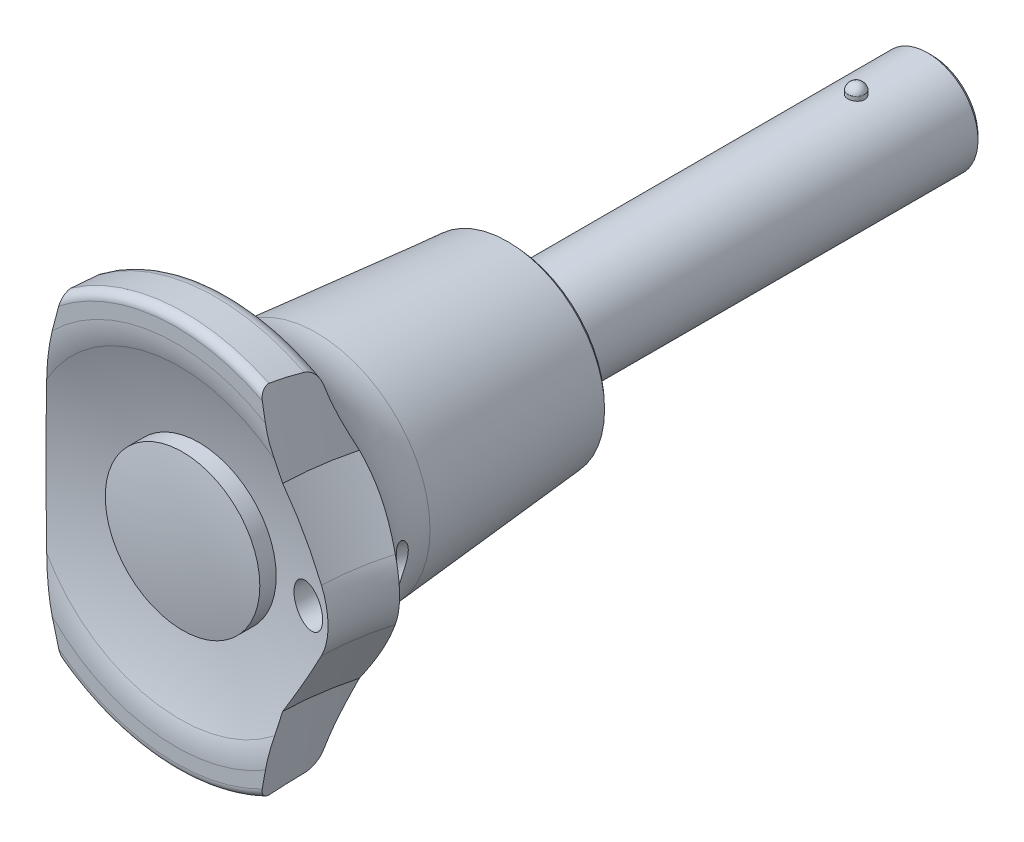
ISO-10303-21;
HEADER;
FILE_DESCRIPTION(('STEP AP214'),'2;1');
FILE_NAME('part.step','',(''),(''),'','','');
FILE_SCHEMA(('AUTOMOTIVE_DESIGN { 1 0 10303 214 1 1 1 1 }'));
ENDSEC;
DATA;
#1=APPLICATION_CONTEXT('core data for automotive mechanical design processes');
#2=APPLICATION_PROTOCOL_DEFINITION('international standard','automotive_design',2000,#1);
#3=PRODUCT_CONTEXT('',#1,'mechanical');
#4=PRODUCT('Part','Part','',(#3));
#5=PRODUCT_RELATED_PRODUCT_CATEGORY('part','',(#4));
#6=PRODUCT_DEFINITION_FORMATION('','',#4);
#7=PRODUCT_DEFINITION_CONTEXT('part definition',#1,'design');
#8=PRODUCT_DEFINITION('design','',#6,#7);
#9=PRODUCT_DEFINITION_SHAPE('','',#8);
#10=(LENGTH_UNIT() NAMED_UNIT(*) SI_UNIT(.MILLI.,.METRE.));
#11=(NAMED_UNIT(*) PLANE_ANGLE_UNIT() SI_UNIT($,.RADIAN.));
#12=(NAMED_UNIT(*) SI_UNIT($,.STERADIAN.) SOLID_ANGLE_UNIT());
#13=UNCERTAINTY_MEASURE_WITH_UNIT(LENGTH_MEASURE(1.E-05),#10,'distance_accuracy_value','');
#14=(GEOMETRIC_REPRESENTATION_CONTEXT(3) GLOBAL_UNCERTAINTY_ASSIGNED_CONTEXT((#13)) GLOBAL_UNIT_ASSIGNED_CONTEXT((#10,
#11,#12)) REPRESENTATION_CONTEXT('',''));
#15=CARTESIAN_POINT('',(0.,0.,0.));
#16=DIRECTION('',(0.,0.,1.));
#17=DIRECTION('',(1.,0.,0.));
#18=AXIS2_PLACEMENT_3D('',#15,#16,#17);
#19=CARTESIAN_POINT('',(0.,6.225,-41.));
#20=DIRECTION('',(1.,0.,0.));
#21=DIRECTION('',(0.,1.,0.));
#22=AXIS2_PLACEMENT_3D('',#19,#20,#21);
#23=SPHERICAL_SURFACE('',#22,1.025);
#24=CARTESIAN_POINT('',(0.,6.45,-41.));
#25=DIRECTION('',(0.,1.,0.));
#26=DIRECTION('',(0.,0.,1.));
#27=AXIS2_PLACEMENT_3D('',#24,#25,#26);
#28=CIRCLE('',#27,1.);
#29=CARTESIAN_POINT('',(0.,6.45,-40.));
#30=VERTEX_POINT('',#29);
#31=EDGE_CURVE('E581',#30,#30,#28,.F.);
#32=ORIENTED_EDGE('',*,*,#31,.F.);
#33=EDGE_LOOP('',(#32));
#34=FACE_BOUND('',#33,.T.);
#35=ADVANCED_FACE('F14',(#34),#23,.T.);
#36=CARTESIAN_POINT('',(0.,-6.225,-41.));
#37=DIRECTION('',(1.,0.,0.));
#38=DIRECTION('',(0.,1.,0.));
#39=AXIS2_PLACEMENT_3D('',#36,#37,#38);
#40=SPHERICAL_SURFACE('',#39,1.02500000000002);
#41=CARTESIAN_POINT('',(0.,-6.45,-41.));
#42=DIRECTION('',(0.,1.,0.));
#43=DIRECTION('',(0.,0.,1.));
#44=AXIS2_PLACEMENT_3D('',#41,#42,#43);
#45=CIRCLE('',#44,1.);
#46=CARTESIAN_POINT('',(0.,-6.45,-40.));
#47=VERTEX_POINT('',#46);
#48=EDGE_CURVE('E680',#47,#47,#45,.T.);
#49=ORIENTED_EDGE('',*,*,#48,.F.);
#50=EDGE_LOOP('',(#49));
#51=FACE_BOUND('',#50,.T.);
#52=ADVANCED_FACE('F670',(#51),#40,.T.);
#53=CARTESIAN_POINT('',(0.,2.75,-50.));
#54=DIRECTION('',(0.,0.,-1.));
#55=DIRECTION('',(-1.,0.,0.));
#56=AXIS2_PLACEMENT_3D('',#53,#54,#55);
#57=PLANE('',#56);
#58=CARTESIAN_POINT('',(0.,0.,-49.9999999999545));
#59=DIRECTION('',(0.,0.,1.));
#60=DIRECTION('',(1.,0.,0.));
#61=AXIS2_PLACEMENT_3D('',#58,#59,#60);
#62=CIRCLE('',#61,5.49999999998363);
#63=CARTESIAN_POINT('',(5.49999999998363,0.,-49.9999999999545));
#64=VERTEX_POINT('',#63);
#65=EDGE_CURVE('E682',#64,#64,#62,.T.);
#66=ORIENTED_EDGE('',*,*,#65,.F.);
#67=EDGE_LOOP('',(#66));
#68=FACE_BOUND('',#67,.T.);
#69=ADVANCED_FACE('F667',(#68),#57,.T.);
#70=CARTESIAN_POINT('',(0.,0.,-41.));
#71=DIRECTION('',(0.,1.,0.));
#72=DIRECTION('',(0.,0.,1.));
#73=AXIS2_PLACEMENT_3D('',#70,#71,#72);
#74=CYLINDRICAL_SURFACE('',#73,1.);
#75=ORIENTED_EDGE('',*,*,#31,.T.);
#76=EDGE_LOOP('',(#75));
#77=FACE_BOUND('',#76,.T.);
#78=CARTESIAN_POINT('',(0.,6.,-42.));
#79=CARTESIAN_POINT('',(0.0557503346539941,5.99999897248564,-41.999997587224));
#80=CARTESIAN_POINT('',(0.111535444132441,5.99921479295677,-41.9953216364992));
#81=CARTESIAN_POINT('',(0.221545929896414,5.99616168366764,-41.9767475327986));
#82=CARTESIAN_POINT('',(0.275769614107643,5.99389120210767,-41.9628397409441));
#83=CARTESIAN_POINT('',(0.381042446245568,5.98812022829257,-41.9262335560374));
#84=CARTESIAN_POINT('',(0.432094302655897,5.98462080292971,-41.9035427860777));
#85=CARTESIAN_POINT('',(0.529658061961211,5.97677679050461,-41.850034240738));
#86=CARTESIAN_POINT('',(0.576170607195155,5.97243232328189,-41.8192176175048));
#87=CARTESIAN_POINT('',(0.663788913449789,5.96333328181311,-41.7500180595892));
#88=CARTESIAN_POINT('',(0.704844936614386,5.95857551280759,-41.7115725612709));
#89=CARTESIAN_POINT('',(0.779955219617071,5.949210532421,-41.6283410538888));
#90=CARTESIAN_POINT('',(0.814008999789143,5.94460333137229,-41.5835546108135));
#91=CARTESIAN_POINT('',(0.874346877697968,5.93603025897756,-41.4885715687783));
#92=CARTESIAN_POINT('',(0.900581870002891,5.93206850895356,-41.4383433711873));
#93=CARTESIAN_POINT('',(0.944223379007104,5.92527915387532,-41.3341160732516));
#94=CARTESIAN_POINT('',(0.961630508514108,5.92245147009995,-41.2801172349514));
#95=CARTESIAN_POINT('',(0.9869657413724,5.91828214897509,-41.1704079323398));
#96=CARTESIAN_POINT('',(0.994979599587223,5.91692707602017,-41.1147177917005));
#97=CARTESIAN_POINT('',(1.00156669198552,5.91581575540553,-41.0027679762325));
#98=CARTESIAN_POINT('',(1.00014057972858,5.91605939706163,-40.9465083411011));
#99=CARTESIAN_POINT('',(0.987958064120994,5.91810571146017,-40.8356290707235));
#100=CARTESIAN_POINT('',(0.97729804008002,5.91989227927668,-40.7809985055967));
#101=CARTESIAN_POINT('',(0.947101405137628,5.9247979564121,-40.6743118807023));
#102=CARTESIAN_POINT('',(0.927564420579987,5.92791712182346,-40.6222559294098));
#103=CARTESIAN_POINT('',(0.880069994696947,5.93515405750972,-40.521906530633));
#104=CARTESIAN_POINT('',(0.85207225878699,5.93927658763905,-40.4736325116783));
#105=CARTESIAN_POINT('',(0.788481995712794,5.94805203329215,-40.3824349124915));
#106=CARTESIAN_POINT('',(0.752889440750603,5.95270495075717,-40.3395113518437));
#107=CARTESIAN_POINT('',(0.674601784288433,5.96208707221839,-40.2596784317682));
#108=CARTESIAN_POINT('',(0.63182527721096,5.9668165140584,-40.2228488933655));
#109=CARTESIAN_POINT('',(0.540634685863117,5.9757685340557,-40.1568617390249));
#110=CARTESIAN_POINT('',(0.492218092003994,5.97999088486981,-40.1277075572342));
#111=CARTESIAN_POINT('',(0.391033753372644,5.98745939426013,-40.0778938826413));
#112=CARTESIAN_POINT('',(0.338259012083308,5.99070394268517,-40.0572483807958));
#113=CARTESIAN_POINT('',(0.229994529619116,5.99583383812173,-40.0251781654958));
#114=CARTESIAN_POINT('',(0.17451077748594,5.99772205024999,-40.013734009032));
#115=CARTESIAN_POINT('',(0.0988544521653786,5.99921820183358,-40.0047001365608));
#116=CARTESIAN_POINT('',(0.0791283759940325,5.99951075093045,-40.0029390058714));
#117=CARTESIAN_POINT('',(0.0396045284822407,5.99990183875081,-40.0005884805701));
#118=CARTESIAN_POINT('',(0.0198067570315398,6.0000003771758,-39.9999990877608));
#119=CARTESIAN_POINT('',(-0.0557017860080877,5.9999989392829,-40.0000025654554));
#120=CARTESIAN_POINT('',(-0.111474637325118,5.99921557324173,-40.0046737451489));
#121=CARTESIAN_POINT('',(-0.221497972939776,5.99616392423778,-40.0232387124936));
#122=CARTESIAN_POINT('',(-0.27574513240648,5.99389262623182,-40.0371512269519));
#123=CARTESIAN_POINT('',(-0.381047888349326,5.98811984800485,-40.0737688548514));
#124=CARTESIAN_POINT('',(-0.432107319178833,5.98461988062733,-40.0964631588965));
#125=CARTESIAN_POINT('',(-0.529670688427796,5.97677565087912,-40.1499738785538));
#126=CARTESIAN_POINT('',(-0.576176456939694,5.9724317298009,-40.1807870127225));
#127=CARTESIAN_POINT('',(-0.663783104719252,5.96333387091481,-40.2499773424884));
#128=CARTESIAN_POINT('',(-0.704834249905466,5.95857673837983,-40.2884170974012));
#129=CARTESIAN_POINT('',(-0.779946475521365,5.94921172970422,-40.3716477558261));
#130=CARTESIAN_POINT('',(-0.814005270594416,5.94460390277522,-40.4164407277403));
#131=CARTESIAN_POINT('',(-0.874362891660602,5.93602794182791,-40.5114524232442));
#132=CARTESIAN_POINT('',(-0.900609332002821,5.93206420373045,-40.5617048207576));
#133=CARTESIAN_POINT('',(-0.944242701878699,5.9252761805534,-40.6659474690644));
#134=CARTESIAN_POINT('',(-0.961639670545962,5.92245060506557,-40.7199334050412));
#135=CARTESIAN_POINT('',(-0.982867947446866,5.91895607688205,-40.8118400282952));
#136=CARTESIAN_POINT('',(-0.989282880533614,5.91788293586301,-40.8491691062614));
#137=CARTESIAN_POINT('',(-0.997849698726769,5.91644442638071,-40.9243267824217));
#138=CARTESIAN_POINT('',(-1.00000164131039,5.9160790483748,-40.962155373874));
#139=CARTESIAN_POINT('',(-0.999997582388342,5.91608086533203,-41.0557442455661));
#140=CARTESIAN_POINT('',(-0.995322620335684,5.91687628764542,-41.1115232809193));
#141=CARTESIAN_POINT('',(-0.976752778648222,5.91996951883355,-41.2215212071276));
#142=CARTESIAN_POINT('',(-0.962848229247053,5.92226890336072,-41.2757383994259));
#143=CARTESIAN_POINT('',(-0.926251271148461,5.92810252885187,-41.3809982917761));
#144=CARTESIAN_POINT('',(-0.903566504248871,5.93163569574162,-41.4320437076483));
#145=CARTESIAN_POINT('',(-0.850072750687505,5.93953734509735,-41.5295951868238));
#146=CARTESIAN_POINT('',(-0.819265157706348,5.94390568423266,-41.5761020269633));
#147=CARTESIAN_POINT('',(-0.7500788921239,5.95303338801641,-41.6637203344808));
#148=CARTESIAN_POINT('',(-0.711636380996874,5.95779583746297,-41.7047810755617));
#149=CARTESIAN_POINT('',(-0.628398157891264,5.9671489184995,-41.7799099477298));
#150=CARTESIAN_POINT('',(-0.583600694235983,5.97173950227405,-41.8139761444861));
#151=CARTESIAN_POINT('',(-0.488585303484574,5.98026523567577,-41.8743417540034));
#152=CARTESIAN_POINT('',(-0.438334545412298,5.98419600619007,-41.9005901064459));
#153=CARTESIAN_POINT('',(-0.33409505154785,5.99091787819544,-41.9442276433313));
#154=CARTESIAN_POINT('',(-0.280110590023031,5.99371025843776,-41.961626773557));
#155=CARTESIAN_POINT('',(-0.188198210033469,5.99716174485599,-41.9828609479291));
#156=CARTESIAN_POINT('',(-0.150861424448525,5.99822090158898,-41.9892785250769));
#157=CARTESIAN_POINT('',(-0.0756884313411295,5.99964037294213,-41.9978488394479));
#158=CARTESIAN_POINT('',(-0.0378522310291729,6.00000069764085,-42.0000016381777));
#159=CARTESIAN_POINT('',(0.,6.,-42.));
#160=B_SPLINE_CURVE_WITH_KNOTS('',3,(#78,#79,#80,#81,#82,#83,#84,#85,#86,#87,#88,#89,#90,#91,
#92,#93,#94,#95,#96,#97,#98,#99,#100,#101,#102,#103,#104,#105,#106,#107,#108,#109,#110,#111,
#112,#113,#114,#115,#116,#117,#118,#119,#120,#121,#122,#123,#124,#125,#126,#127,#128,#129,#130,
#131,#132,#133,#134,#135,#136,#137,#138,#139,#140,#141,#142,#143,#144,#145,#146,#147,#148,#149,
#150,#151,#152,#153,#154,#155,#156,#157,#158,#159),.UNSPECIFIED.,.T.,.F.,(4,2,2,2,2,2,2,2,2,2,2,
2,2,2,2,2,2,2,2,2,2,2,2,2,2,2,2,2,2,2,2,2,2,2,2,2,2,2,2,2,4),(0.,0.167112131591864,
0.334399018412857,0.501541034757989,0.668659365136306,0.837209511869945,1.00577120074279,
1.17537024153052,1.34495750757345,1.51298417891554,1.68099921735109,1.84728143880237,
2.01357066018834,2.18066466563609,2.3477592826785,2.51689385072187,2.68610396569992,
2.85559121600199,3.02471938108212,3.08411267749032,3.14350606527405,3.31053582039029,
3.47790508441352,3.64506898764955,3.8121654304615,3.98069385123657,4.14927726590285,
4.31896688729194,4.48846357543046,4.60190468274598,4.71534426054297,4.88243809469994,
5.04970726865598,5.21683118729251,5.38392645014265,5.55248261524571,5.72108533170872,
5.89076623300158,6.06025600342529,6.17372004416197,6.2871824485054),.UNSPECIFIED.);
#161=CARTESIAN_POINT('',(0.,6.,-42.));
#162=VERTEX_POINT('',#161);
#163=EDGE_CURVE('E639',#162,#162,#160,.T.);
#164=ORIENTED_EDGE('',*,*,#163,.F.);
#165=EDGE_LOOP('',(#164));
#166=FACE_BOUND('',#165,.T.);
#167=ADVANCED_FACE('F662',(#77,#166),#74,.T.);
#168=CARTESIAN_POINT('',(0.,0.,-41.));
#169=DIRECTION('',(0.,1.,0.));
#170=DIRECTION('',(0.,0.,1.));
#171=AXIS2_PLACEMENT_3D('',#168,#169,#170);
#172=CYLINDRICAL_SURFACE('',#171,1.);
#173=CARTESIAN_POINT('',(0.,-6.,-40.));
#174=CARTESIAN_POINT('',(0.0557503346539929,-5.99999897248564,-40.000002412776));
#175=CARTESIAN_POINT('',(0.111535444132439,-5.99921479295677,-40.0046783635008));
#176=CARTESIAN_POINT('',(0.221545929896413,-5.99616168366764,-40.0232524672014));
#177=CARTESIAN_POINT('',(0.275769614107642,-5.99389120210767,-40.0371602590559));
#178=CARTESIAN_POINT('',(0.381042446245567,-5.98812022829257,-40.0737664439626));
#179=CARTESIAN_POINT('',(0.432094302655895,-5.98462080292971,-40.0964572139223));
#180=CARTESIAN_POINT('',(0.529658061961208,-5.97677679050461,-40.149965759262));
#181=CARTESIAN_POINT('',(0.576170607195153,-5.97243232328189,-40.1807823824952));
#182=CARTESIAN_POINT('',(0.663788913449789,-5.96333328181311,-40.2499819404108));
#183=CARTESIAN_POINT('',(0.704844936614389,-5.95857551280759,-40.2884274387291));
#184=CARTESIAN_POINT('',(0.779955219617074,-5.949210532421,-40.3716589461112));
#185=CARTESIAN_POINT('',(0.814008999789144,-5.94460333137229,-40.4164453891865));
#186=CARTESIAN_POINT('',(0.874346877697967,-5.93603025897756,-40.5114284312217));
#187=CARTESIAN_POINT('',(0.900581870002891,-5.93206850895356,-40.5616566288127));
#188=CARTESIAN_POINT('',(0.944223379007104,-5.92527915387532,-40.6658839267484));
#189=CARTESIAN_POINT('',(0.961630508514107,-5.92245147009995,-40.7198827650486));
#190=CARTESIAN_POINT('',(0.986965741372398,-5.91828214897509,-40.8295920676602));
#191=CARTESIAN_POINT('',(0.994979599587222,-5.91692707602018,-40.8852822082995));
#192=CARTESIAN_POINT('',(1.00156669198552,-5.91581575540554,-40.9972320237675));
#193=CARTESIAN_POINT('',(1.00014057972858,-5.91605939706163,-41.0534916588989));
#194=CARTESIAN_POINT('',(0.987958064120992,-5.91810571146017,-41.1643709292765));
#195=CARTESIAN_POINT('',(0.977298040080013,-5.91989227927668,-41.2190014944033));
#196=CARTESIAN_POINT('',(0.947101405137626,-5.9247979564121,-41.3256881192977));
#197=CARTESIAN_POINT('',(0.927564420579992,-5.92791712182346,-41.3777440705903));
#198=CARTESIAN_POINT('',(0.880069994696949,-5.93515405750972,-41.4780934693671));
#199=CARTESIAN_POINT('',(0.852072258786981,-5.93927658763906,-41.5263674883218));
#200=CARTESIAN_POINT('',(0.788481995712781,-5.94805203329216,-41.6175650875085));
#201=CARTESIAN_POINT('',(0.752889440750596,-5.95270495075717,-41.6604886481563));
#202=CARTESIAN_POINT('',(0.674601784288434,-5.96208707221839,-41.7403215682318));
#203=CARTESIAN_POINT('',(0.631825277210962,-5.9668165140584,-41.7771511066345));
#204=CARTESIAN_POINT('',(0.540634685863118,-5.9757685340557,-41.8431382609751));
#205=CARTESIAN_POINT('',(0.492218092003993,-5.97999088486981,-41.8722924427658));
#206=CARTESIAN_POINT('',(0.391033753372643,-5.98745939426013,-41.9221061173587));
#207=CARTESIAN_POINT('',(0.338259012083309,-5.99070394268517,-41.9427516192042));
#208=CARTESIAN_POINT('',(0.229994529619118,-5.99583383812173,-41.9748218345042));
#209=CARTESIAN_POINT('',(0.174510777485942,-5.99772205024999,-41.986265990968));
#210=CARTESIAN_POINT('',(0.0988544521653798,-5.99921820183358,-41.9952998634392));
#211=CARTESIAN_POINT('',(0.0791283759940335,-5.99951075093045,-41.9970609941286));
#212=CARTESIAN_POINT('',(0.039604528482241,-5.99990183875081,-41.9994115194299));
#213=CARTESIAN_POINT('',(0.0198067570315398,-6.0000003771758,-42.0000009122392));
#214=CARTESIAN_POINT('',(-0.0557017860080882,-5.9999989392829,-41.9999974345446));
#215=CARTESIAN_POINT('',(-0.111474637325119,-5.99921557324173,-41.9953262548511));
#216=CARTESIAN_POINT('',(-0.221497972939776,-5.99616392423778,-41.9767612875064));
#217=CARTESIAN_POINT('',(-0.27574513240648,-5.99389262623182,-41.9628487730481));
#218=CARTESIAN_POINT('',(-0.381047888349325,-5.98811984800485,-41.9262311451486));
#219=CARTESIAN_POINT('',(-0.432107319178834,-5.98461988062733,-41.9035368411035));
#220=CARTESIAN_POINT('',(-0.529670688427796,-5.97677565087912,-41.8500261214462));
#221=CARTESIAN_POINT('',(-0.576176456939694,-5.9724317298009,-41.8192129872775));
#222=CARTESIAN_POINT('',(-0.663783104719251,-5.96333387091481,-41.7500226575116));
#223=CARTESIAN_POINT('',(-0.704834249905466,-5.95857673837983,-41.7115829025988));
#224=CARTESIAN_POINT('',(-0.779946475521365,-5.94921172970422,-41.6283522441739));
#225=CARTESIAN_POINT('',(-0.814005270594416,-5.94460390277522,-41.5835592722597));
#226=CARTESIAN_POINT('',(-0.8743628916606,-5.93602794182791,-41.4885475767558));
#227=CARTESIAN_POINT('',(-0.900609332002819,-5.93206420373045,-41.4382951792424));
#228=CARTESIAN_POINT('',(-0.944242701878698,-5.9252761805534,-41.3340525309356));
#229=CARTESIAN_POINT('',(-0.961639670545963,-5.92245060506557,-41.2800665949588));
#230=CARTESIAN_POINT('',(-0.982867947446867,-5.91895607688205,-41.1881599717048));
#231=CARTESIAN_POINT('',(-0.989282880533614,-5.91788293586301,-41.1508308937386));
#232=CARTESIAN_POINT('',(-0.997849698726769,-5.91644442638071,-41.0756732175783));
#233=CARTESIAN_POINT('',(-1.00000164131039,-5.9160790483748,-41.037844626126));
#234=CARTESIAN_POINT('',(-0.999997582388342,-5.91608086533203,-40.944255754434));
#235=CARTESIAN_POINT('',(-0.995322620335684,-5.91687628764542,-40.8884767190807));
#236=CARTESIAN_POINT('',(-0.976752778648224,-5.91996951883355,-40.7784787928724));
#237=CARTESIAN_POINT('',(-0.962848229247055,-5.92226890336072,-40.7242616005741));
#238=CARTESIAN_POINT('',(-0.926251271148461,-5.92810252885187,-40.6190017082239));
#239=CARTESIAN_POINT('',(-0.90356650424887,-5.93163569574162,-40.5679562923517));
#240=CARTESIAN_POINT('',(-0.850072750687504,-5.93953734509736,-40.4704048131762));
#241=CARTESIAN_POINT('',(-0.819265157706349,-5.94390568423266,-40.4238979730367));
#242=CARTESIAN_POINT('',(-0.750078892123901,-5.95303338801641,-40.3362796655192));
#243=CARTESIAN_POINT('',(-0.711636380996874,-5.95779583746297,-40.2952189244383));
#244=CARTESIAN_POINT('',(-0.628398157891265,-5.9671489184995,-40.2200900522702));
#245=CARTESIAN_POINT('',(-0.583600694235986,-5.97173950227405,-40.1860238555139));
#246=CARTESIAN_POINT('',(-0.488585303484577,-5.98026523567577,-40.1256582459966));
#247=CARTESIAN_POINT('',(-0.4383345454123,-5.98419600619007,-40.0994098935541));
#248=CARTESIAN_POINT('',(-0.334095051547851,-5.99091787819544,-40.0557723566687));
#249=CARTESIAN_POINT('',(-0.280110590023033,-5.99371025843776,-40.038373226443));
#250=CARTESIAN_POINT('',(-0.18819821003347,-5.99716174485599,-40.0171390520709));
#251=CARTESIAN_POINT('',(-0.150861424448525,-5.99822090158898,-40.0107214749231));
#252=CARTESIAN_POINT('',(-0.0756884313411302,-5.99964037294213,-40.0021511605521));
#253=CARTESIAN_POINT('',(-0.0378522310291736,-6.00000069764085,-39.9999983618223));
#254=CARTESIAN_POINT('',(0.,-6.,-40.));
#255=B_SPLINE_CURVE_WITH_KNOTS('',3,(#173,#174,#175,#176,#177,#178,#179,#180,#181,#182,#183,
#184,#185,#186,#187,#188,#189,#190,#191,#192,#193,#194,#195,#196,#197,#198,#199,#200,#201,#202,
#203,#204,#205,#206,#207,#208,#209,#210,#211,#212,#213,#214,#215,#216,#217,#218,#219,#220,#221,
#222,#223,#224,#225,#226,#227,#228,#229,#230,#231,#232,#233,#234,#235,#236,#237,#238,#239,#240,
#241,#242,#243,#244,#245,#246,#247,#248,#249,#250,#251,#252,#253,#254),.UNSPECIFIED.,.T.,.F.,(4,
2,2,2,2,2,2,2,2,2,2,2,2,2,2,2,2,2,2,2,2,2,2,2,2,2,2,2,2,2,2,2,2,2,2,2,2,2,2,2,4),(0.,
0.167112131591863,0.334399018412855,0.501541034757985,0.668659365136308,0.837209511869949,
1.00577120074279,1.17537024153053,1.34495750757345,1.51298417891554,1.68099921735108,
1.84728143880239,2.01357066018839,2.18066466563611,2.3477592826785,2.51689385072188,
2.68610396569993,2.85559121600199,3.02471938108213,3.08411267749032,3.14350606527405,
3.31053582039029,3.47790508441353,3.64506898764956,3.8121654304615,3.98069385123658,
4.14927726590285,4.31896688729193,4.48846357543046,4.60190468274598,4.71534426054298,
4.88243809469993,5.04970726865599,5.21683118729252,5.38392645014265,5.55248261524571,
5.72108533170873,5.89076623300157,6.0602560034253,6.17372004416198,6.2871824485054),.UNSPECIFIED.);
#256=CARTESIAN_POINT('',(0.,-6.,-40.));
#257=VERTEX_POINT('',#256);
#258=EDGE_CURVE('E643',#257,#257,#255,.T.);
#259=ORIENTED_EDGE('',*,*,#258,.F.);
#260=EDGE_LOOP('',(#259));
#261=FACE_BOUND('',#260,.T.);
#262=ORIENTED_EDGE('',*,*,#48,.T.);
#263=EDGE_LOOP('',(#262));
#264=FACE_BOUND('',#263,.T.);
#265=ADVANCED_FACE('F632',(#261,#264),#172,.T.);
#266=CARTESIAN_POINT('',(0.,0.,-49.4999999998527));
#267=DIRECTION('',(0.,0.,1.));
#268=DIRECTION('',(1.,0.,0.));
#269=AXIS2_PLACEMENT_3D('',#266,#267,#268);
#270=CONICAL_SURFACE('',#269,6.00000000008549,0.785398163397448);
#271=ORIENTED_EDGE('',*,*,#65,.T.);
#272=EDGE_LOOP('',(#271));
#273=FACE_BOUND('',#272,.T.);
#274=CARTESIAN_POINT('',(0.,0.,-49.5));
#275=DIRECTION('',(0.,0.,1.));
#276=DIRECTION('',(1.,0.,0.));
#277=AXIS2_PLACEMENT_3D('',#274,#275,#276);
#278=CIRCLE('',#277,6.);
#279=CARTESIAN_POINT('',(6.,0.,-49.5));
#280=VERTEX_POINT('',#279);
#281=EDGE_CURVE('E24',#280,#280,#278,.T.);
#282=ORIENTED_EDGE('',*,*,#281,.F.);
#283=EDGE_LOOP('',(#282));
#284=FACE_BOUND('',#283,.T.);
#285=ADVANCED_FACE('F627',(#273,#284),#270,.T.);
#286=CARTESIAN_POINT('',(0.,0.,-14.75));
#287=DIRECTION('',(0.,0.,1.));
#288=DIRECTION('',(1.,0.,0.));
#289=AXIS2_PLACEMENT_3D('',#286,#287,#288);
#290=CYLINDRICAL_SURFACE('',#289,6.);
#291=CARTESIAN_POINT('',(0.,0.,0.));
#292=DIRECTION('',(0.,0.,-1.));
#293=DIRECTION('',(-1.,0.,0.));
#294=AXIS2_PLACEMENT_3D('',#291,#292,#293);
#295=CIRCLE('',#294,6.);
#296=CARTESIAN_POINT('',(-6.,0.,0.));
#297=VERTEX_POINT('',#296);
#298=EDGE_CURVE('E9',#297,#297,#295,.F.);
#299=ORIENTED_EDGE('',*,*,#298,.F.);
#300=EDGE_LOOP('',(#299));
#301=FACE_BOUND('',#300,.T.);
#302=ORIENTED_EDGE('',*,*,#163,.T.);
#303=EDGE_LOOP('',(#302));
#304=FACE_BOUND('',#303,.T.);
#305=ORIENTED_EDGE('',*,*,#258,.T.);
#306=EDGE_LOOP('',(#305));
#307=FACE_BOUND('',#306,.T.);
#308=ORIENTED_EDGE('',*,*,#281,.T.);
#309=EDGE_LOOP('',(#308));
#310=FACE_BOUND('',#309,.T.);
#311=ADVANCED_FACE('F16',(#301,#304,#307,#310),#290,.T.);
#312=CARTESIAN_POINT('',(0.,-2.65618770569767E-13,-13.3000000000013));
#313=DIRECTION('',(1.,0.,0.));
#314=DIRECTION('',(0.,1.,0.));
#315=AXIS2_PLACEMENT_3D('',#312,#313,#314);
#316=SPHERICAL_SURFACE('',#315,53.3000000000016);
#317=CARTESIAN_POINT('',(0.,0.,39.2));
#318=DIRECTION('',(0.,0.,1.));
#319=DIRECTION('',(1.,0.,0.));
#320=AXIS2_PLACEMENT_3D('',#317,#318,#319);
#321=CIRCLE('',#320,9.2);
#322=CARTESIAN_POINT('',(9.2,0.,39.2));
#323=VERTEX_POINT('',#322);
#324=EDGE_CURVE('E575',#323,#323,#321,.F.);
#325=ORIENTED_EDGE('',*,*,#324,.F.);
#326=EDGE_LOOP('',(#325));
#327=FACE_BOUND('',#326,.T.);
#328=ADVANCED_FACE('F590',(#327),#316,.T.);
#329=CARTESIAN_POINT('',(0.,0.,29.6));
#330=DIRECTION('',(0.,0.,1.));
#331=DIRECTION('',(1.,0.,0.));
#332=AXIS2_PLACEMENT_3D('',#329,#330,#331);
#333=CYLINDRICAL_SURFACE('',#332,9.2);
#334=ORIENTED_EDGE('',*,*,#324,.T.);
#335=EDGE_LOOP('',(#334));
#336=FACE_BOUND('',#335,.T.);
#337=CARTESIAN_POINT('',(9.2,0.,37.2467115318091));
#338=CARTESIAN_POINT('',(9.20000185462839,-0.258477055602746,37.2467115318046));
#339=CARTESIAN_POINT('',(9.18910252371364,-0.516923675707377,37.2467115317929));
#340=CARTESIAN_POINT('',(9.14558128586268,-1.0320661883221,37.2467115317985));
#341=CARTESIAN_POINT('',(9.11295366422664,-1.28876160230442,37.2467115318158));
#342=CARTESIAN_POINT('',(9.02615325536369,-1.79876171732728,37.2467115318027));
#343=CARTESIAN_POINT('',(8.97195747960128,-2.05206250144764,37.2467115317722));
#344=CARTESIAN_POINT('',(8.84240671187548,-2.55319845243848,37.2467115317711));
#345=CARTESIAN_POINT('',(8.7670514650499,-2.80103355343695,37.2467115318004));
#346=CARTESIAN_POINT('',(8.59576047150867,-3.2893491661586,37.2467115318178));
#347=CARTESIAN_POINT('',(8.49983486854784,-3.52983323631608,37.2467115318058));
#348=CARTESIAN_POINT('',(8.28806173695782,-4.00186826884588,37.246711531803));
#349=CARTESIAN_POINT('',(8.17221389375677,-4.23341909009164,37.2467115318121));
#350=CARTESIAN_POINT('',(7.92147515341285,-4.68583944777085,37.2467115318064));
#351=CARTESIAN_POINT('',(7.78659246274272,-4.90671353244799,37.2467115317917));
#352=CARTESIAN_POINT('',(7.49865494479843,-5.3363920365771,37.2467115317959));
#353=CARTESIAN_POINT('',(7.34559384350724,-5.54519225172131,37.2467115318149));
#354=CARTESIAN_POINT('',(7.0224378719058,-5.94913959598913,37.2467115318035));
#355=CARTESIAN_POINT('',(6.85234434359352,-6.14428779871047,37.2467115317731));
#356=CARTESIAN_POINT('',(6.49631888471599,-6.51956588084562,37.246711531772));
#357=CARTESIAN_POINT('',(6.31038662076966,-6.69969544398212,37.2467115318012));
#358=CARTESIAN_POINT('',(5.92400519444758,-7.04365410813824,37.2467115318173));
#359=CARTESIAN_POINT('',(5.72355577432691,-7.20748291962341,37.2467115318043));
#360=CARTESIAN_POINT('',(5.30956347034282,-7.5176751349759,37.2467115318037));
#361=CARTESIAN_POINT('',(5.09602029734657,-7.66403815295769,37.2467115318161));
#362=CARTESIAN_POINT('',(4.65736864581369,-7.93825027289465,37.2467115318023));
#363=CARTESIAN_POINT('',(4.43226047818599,-8.06609987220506,37.246711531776));
#364=CARTESIAN_POINT('',(3.97207525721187,-8.30238022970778,37.2467115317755));
#365=CARTESIAN_POINT('',(3.73699826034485,-8.41081109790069,37.2467115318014));
#366=CARTESIAN_POINT('',(3.25854539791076,-8.60748402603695,37.246711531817));
#367=CARTESIAN_POINT('',(3.01516953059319,-8.69572608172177,37.2467115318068));
#368=CARTESIAN_POINT('',(2.5218489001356,-8.8513941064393,37.2467115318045));
#369=CARTESIAN_POINT('',(2.27190412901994,-8.9188200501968,37.2467115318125));
#370=CARTESIAN_POINT('',(1.76726641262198,-9.03236657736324,37.2467115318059));
#371=CARTESIAN_POINT('',(1.51257429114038,-9.07849082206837,37.2467115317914));
#372=CARTESIAN_POINT('',(1.00012124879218,-9.14913549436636,37.2467115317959));
#373=CARTESIAN_POINT('',(0.742359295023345,-9.17364842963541,37.2467115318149));
#374=CARTESIAN_POINT('',(0.225734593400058,-9.20086637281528,37.2467115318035));
#375=CARTESIAN_POINT('',(-0.03312794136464,-9.20357542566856,37.2467115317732));
#376=CARTESIAN_POINT('',(-0.550166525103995,-9.18717680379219,37.246711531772));
#377=CARTESIAN_POINT('',(-0.808342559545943,-9.16806867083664,37.2467115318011));
#378=CARTESIAN_POINT('',(-1.32216168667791,-9.10817141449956,37.2467115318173));
#379=CARTESIAN_POINT('',(-1.57780483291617,-9.06738275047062,37.2467115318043));
#380=CARTESIAN_POINT('',(-2.08475193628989,-8.96441355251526,37.2467115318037));
#381=CARTESIAN_POINT('',(-2.33605579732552,-8.90223254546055,37.2467115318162));
#382=CARTESIAN_POINT('',(-2.83253007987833,-8.75692145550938,37.2467115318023));
#383=CARTESIAN_POINT('',(-3.07770054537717,-8.67379152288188,37.246711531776));
#384=CARTESIAN_POINT('',(-3.56016551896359,-8.48717389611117,37.2467115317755));
#385=CARTESIAN_POINT('',(-3.79746007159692,-8.38368631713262,37.2467115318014));
#386=CARTESIAN_POINT('',(-4.26248809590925,-8.15708862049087,37.246711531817));
#387=CARTESIAN_POINT('',(-4.49022154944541,-8.03397846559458,37.2467115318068));
#388=CARTESIAN_POINT('',(-4.93450813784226,-7.7690108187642,37.2467115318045));
#389=CARTESIAN_POINT('',(-5.15106125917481,-7.62715330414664,37.2467115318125));
#390=CARTESIAN_POINT('',(-5.57141062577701,-7.32572590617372,37.2467115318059));
#391=CARTESIAN_POINT('',(-5.77520908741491,-7.16615911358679,37.2467115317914));
#392=CARTESIAN_POINT('',(-6.1687101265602,-6.83036880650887,37.246711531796));
#393=CARTESIAN_POINT('',(-6.35840779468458,-6.65413953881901,37.2467115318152));
#394=CARTESIAN_POINT('',(-6.72224710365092,-6.28635764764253,37.2467115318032));
#395=CARTESIAN_POINT('',(-6.89639155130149,-6.09480780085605,37.2467115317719));
#396=CARTESIAN_POINT('',(-7.22792754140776,-5.69771568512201,37.2467115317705));
#397=CARTESIAN_POINT('',(-7.38531882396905,-5.49217319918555,37.2467115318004));
#398=CARTESIAN_POINT('',(-7.68222361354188,-5.06856374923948,37.246711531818));
#399=CARTESIAN_POINT('',(-7.82173745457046,-4.85049701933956,37.2467115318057));
#400=CARTESIAN_POINT('',(-8.0819018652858,-4.4033808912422,37.2467115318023));
#401=CARTESIAN_POINT('',(-8.20255201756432,-4.17433125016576,37.2467115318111));
#402=CARTESIAN_POINT('',(-8.42410685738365,-3.70692592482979,37.2467115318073));
#403=CARTESIAN_POINT('',(-8.52501522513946,-3.4685719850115,37.2467115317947));
#404=CARTESIAN_POINT('',(-8.70642929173,-2.98412666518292,37.2467115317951));
#405=CARTESIAN_POINT('',(-8.78692781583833,-2.73803259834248,37.2467115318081));
#406=CARTESIAN_POINT('',(-8.92687528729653,-2.24003727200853,37.2467115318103));
#407=CARTESIAN_POINT('',(-8.9863326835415,-1.98813838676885,37.2467115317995));
#408=CARTESIAN_POINT('',(-9.08384258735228,-1.48011271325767,37.2467115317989));
#409=CARTESIAN_POINT('',(-9.12188538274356,-1.22398406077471,37.2467115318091));
#410=CARTESIAN_POINT('',(-9.17625392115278,-0.709432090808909,37.2467115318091));
#411=CARTESIAN_POINT('',(-9.19257966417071,-0.451008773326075,37.2467115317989));
#412=CARTESIAN_POINT('',(-9.20339556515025,0.0661771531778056,37.2467115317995));
#413=CARTESIAN_POINT('',(-9.19789561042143,0.324939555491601,37.2467115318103));
#414=CARTESIAN_POINT('',(-9.16511481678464,0.841185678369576,37.2467115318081));
#415=CARTESIAN_POINT('',(-9.13782521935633,1.09866884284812,37.2467115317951));
#416=CARTESIAN_POINT('',(-9.06166168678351,1.61033030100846,37.2467115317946));
#417=CARTESIAN_POINT('',(-9.01279532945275,1.86450972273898,37.2467115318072));
#418=CARTESIAN_POINT('',(-8.89381622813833,2.3678965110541,37.246711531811));
#419=CARTESIAN_POINT('',(-8.82369952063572,2.6171029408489,37.2467115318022));
#420=CARTESIAN_POINT('',(-8.66272318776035,3.10871759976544,37.2467115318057));
#421=CARTESIAN_POINT('',(-8.5718640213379,3.35112597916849,37.246711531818));
#422=CARTESIAN_POINT('',(-8.37004594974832,3.82743143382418,37.2467115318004));
#423=CARTESIAN_POINT('',(-8.25908666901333,4.06132834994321,37.2467115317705));
#424=CARTESIAN_POINT('',(-8.01786026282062,4.51893962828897,37.2467115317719));
#425=CARTESIAN_POINT('',(-7.88759343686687,4.74265414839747,37.2467115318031));
#426=CARTESIAN_POINT('',(-7.60865148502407,5.17835352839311,37.2467115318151));
#427=CARTESIAN_POINT('',(-7.45997303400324,5.39033625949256,37.246711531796));
#428=CARTESIAN_POINT('',(-7.14533841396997,5.80094952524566,37.2467115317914));
#429=CARTESIAN_POINT('',(-6.97938824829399,5.99958466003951,37.2467115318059));
#430=CARTESIAN_POINT('',(-6.63131665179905,6.3822048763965,37.2467115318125));
#431=CARTESIAN_POINT('',(-6.44919240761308,6.56618739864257,37.2467115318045));
#432=CARTESIAN_POINT('',(-6.07009243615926,6.91815563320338,37.2467115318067));
#433=CARTESIAN_POINT('',(-5.87311672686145,7.08614136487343,37.2467115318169));
#434=CARTESIAN_POINT('',(-5.46571438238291,7.40492171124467,37.2467115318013));
#435=CARTESIAN_POINT('',(-5.25528777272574,7.55571635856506,37.2467115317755));
#436=CARTESIAN_POINT('',(-4.8224780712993,7.83904364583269,37.2467115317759));
#437=CARTESIAN_POINT('',(-4.60009491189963,7.971576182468,37.2467115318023));
#438=CARTESIAN_POINT('',(-4.14495258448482,8.21743689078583,37.2467115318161));
#439=CARTESIAN_POINT('',(-3.91219334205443,8.33076492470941,37.2467115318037));
#440=CARTESIAN_POINT('',(-3.43796040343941,8.53740746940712,37.2467115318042));
#441=CARTESIAN_POINT('',(-3.19648690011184,8.6307224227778,37.2467115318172));
#442=CARTESIAN_POINT('',(-2.70653205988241,8.7966803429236,37.246711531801));
#443=CARTESIAN_POINT('',(-2.45805057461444,8.86932287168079,37.2467115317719));
#444=CARTESIAN_POINT('',(-1.95585656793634,8.99341554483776,37.2467115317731));
#445=CARTESIAN_POINT('',(-1.70214415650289,9.04486613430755,37.2467115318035));
#446=CARTESIAN_POINT('',(-1.19123944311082,9.12621890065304,37.2467115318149));
#447=CARTESIAN_POINT('',(-0.934046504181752,9.15611707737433,37.2467115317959));
#448=CARTESIAN_POINT('',(-0.418145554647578,9.19413024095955,37.2467115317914));
#449=CARTESIAN_POINT('',(-0.159438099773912,9.20225277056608,37.2467115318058));
#450=CARTESIAN_POINT('',(0.357786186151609,9.19667812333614,37.2467115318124));
#451=CARTESIAN_POINT('',(0.616302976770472,9.18297719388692,37.2467115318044));
#452=CARTESIAN_POINT('',(1.1312630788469,9.13384602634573,37.2467115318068));
#453=CARTESIAN_POINT('',(1.38770639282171,9.09841581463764,37.246711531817));
#454=CARTESIAN_POINT('',(1.89669667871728,9.00607800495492,37.2467115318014));
#455=CARTESIAN_POINT('',(2.1492436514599,8.9491704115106,37.2467115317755));
#456=CARTESIAN_POINT('',(2.64864726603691,8.81428203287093,37.2467115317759));
#457=CARTESIAN_POINT('',(2.89550387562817,8.73630112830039,37.2467115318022));
#458=CARTESIAN_POINT('',(3.38177681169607,8.55981829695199,37.246711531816));
#459=CARTESIAN_POINT('',(3.62119293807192,8.46131581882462,37.2467115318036));
#460=CARTESIAN_POINT('',(4.09087056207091,8.2444938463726,37.2467115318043));
#461=CARTESIAN_POINT('',(4.32113226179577,8.12617478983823,37.2467115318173));
#462=CARTESIAN_POINT('',(4.77086558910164,7.87056159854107,37.2467115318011));
#463=CARTESIAN_POINT('',(4.99033740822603,7.73326780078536,37.246711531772));
#464=CARTESIAN_POINT('',(5.4169305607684,7.44068268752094,37.2467115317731));
#465=CARTESIAN_POINT('',(5.62405215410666,7.28539175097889,37.2467115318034));
#466=CARTESIAN_POINT('',(6.02449325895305,6.95790104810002,37.2467115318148));
#467=CARTESIAN_POINT('',(6.21781168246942,6.78569995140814,37.2467115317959));
#468=CARTESIAN_POINT('',(6.58918960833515,6.42568596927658,37.2467115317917));
#469=CARTESIAN_POINT('',(6.76725436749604,6.23787850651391,37.2467115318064));
#470=CARTESIAN_POINT('',(7.10700778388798,5.84785067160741,37.246711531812));
#471=CARTESIAN_POINT('',(7.26868936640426,5.6456241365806,37.2467115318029));
#472=CARTESIAN_POINT('',(7.57443690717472,5.22827132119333,37.2467115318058));
#473=CARTESIAN_POINT('',(7.71850314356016,5.01314524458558,37.2467115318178));
#474=CARTESIAN_POINT('',(7.98806497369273,4.57141097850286,37.2467115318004));
#475=CARTESIAN_POINT('',(8.11355139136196,4.34479718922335,37.2467115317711));
#476=CARTESIAN_POINT('',(8.34497404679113,3.8818023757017,37.2467115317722));
#477=CARTESIAN_POINT('',(8.45091052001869,3.64542146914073,37.2467115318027));
#478=CARTESIAN_POINT('',(8.64237937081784,3.16482381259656,37.2467115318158));
#479=CARTESIAN_POINT('',(8.72793341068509,2.92061569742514,37.2467115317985));
#480=CARTESIAN_POINT('',(8.87815350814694,2.42594426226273,37.2467115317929));
#481=CARTESIAN_POINT('',(8.94282505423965,2.17548260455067,37.2467115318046));
#482=CARTESIAN_POINT('',(9.06430244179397,1.6070403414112,37.2467115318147));
#483=CARTESIAN_POINT('',(9.11514584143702,1.28776808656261,37.2467115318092));
#484=CARTESIAN_POINT('',(9.1829934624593,0.645648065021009,37.2467115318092));
#485=CARTESIAN_POINT('',(9.19999768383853,0.32280029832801,37.2467115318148));
#486=CARTESIAN_POINT('',(9.2,0.,37.2467115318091));
#487=B_SPLINE_CURVE_WITH_KNOTS('',3,(#337,#338,#339,#340,#341,#342,#343,#344,#345,#346,#347,
#348,#349,#350,#351,#352,#353,#354,#355,#356,#357,#358,#359,#360,#361,#362,#363,#364,#365,#366,
#367,#368,#369,#370,#371,#372,#373,#374,#375,#376,#377,#378,#379,#380,#381,#382,#383,#384,#385,
#386,#387,#388,#389,#390,#391,#392,#393,#394,#395,#396,#397,#398,#399,#400,#401,#402,#403,#404,
#405,#406,#407,#408,#409,#410,#411,#412,#413,#414,#415,#416,#417,#418,#419,#420,#421,#422,#423,
#424,#425,#426,#427,#428,#429,#430,#431,#432,#433,#434,#435,#436,#437,#438,#439,#440,#441,#442,
#443,#444,#445,#446,#447,#448,#449,#450,#451,#452,#453,#454,#455,#456,#457,#458,#459,#460,#461,
#462,#463,#464,#465,#466,#467,#468,#469,#470,#471,#472,#473,#474,#475,#476,#477,#478,#479,#480,
#481,#482,#483,#484,#485,#486),.UNSPECIFIED.,.T.,.F.,(4,2,2,2,2,2,2,2,2,2,2,2,2,2,2,2,2,2,2,2,2,
2,2,2,2,2,2,2,2,2,2,2,2,2,2,2,2,2,2,2,2,2,2,2,2,2,2,2,2,2,2,2,2,2,2,2,2,2,2,2,2,2,2,2,2,2,2,2,2,
2,2,2,2,2,4),(0.,0.775149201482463,1.55050235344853,2.32668414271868,3.1028752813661,
3.87868453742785,4.65450604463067,5.42999408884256,6.20575056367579,6.98144596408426,
7.7571576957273,8.53288320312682,9.30862584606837,10.0843476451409,10.8600650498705,
11.6357826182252,12.4115011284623,13.1870862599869,13.9629401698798,14.7386501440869,
15.5143764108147,16.2900862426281,17.0658132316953,17.8415346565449,18.6172516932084,
19.3929702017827,20.1686896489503,20.9442739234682,21.7201269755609,22.4958397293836,
23.2715645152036,24.0472748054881,24.8230022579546,25.5985849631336,26.3744399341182,
27.1499830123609,27.9258775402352,28.7017720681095,29.4773151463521,30.2531701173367,
31.0287528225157,31.8044802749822,32.5801905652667,33.3559153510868,34.1316281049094,
34.9074811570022,35.68306543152,36.4587848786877,37.2345033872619,38.0102204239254,
38.785941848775,39.5616688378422,40.3373786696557,41.1131049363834,41.8888149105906,
42.6646688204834,43.440253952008,44.2159724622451,44.9916900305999,45.7674074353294,
46.543129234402,47.3188718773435,48.094597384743,48.870309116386,49.6460045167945,
50.4217609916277,51.1972490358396,51.9730705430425,52.7488797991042,53.5250709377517,
54.3012527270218,55.0766058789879,55.8517550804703,56.8198038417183,57.7878526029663),.UNSPECIFIED.);
#488=CARTESIAN_POINT('',(9.2,0.,37.2467115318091));
#489=VERTEX_POINT('',#488);
#490=EDGE_CURVE('E453',#489,#489,#487,.T.);
#491=ORIENTED_EDGE('',*,*,#490,.F.);
#492=EDGE_LOOP('',(#491));
#493=FACE_BOUND('',#492,.T.);
#494=ADVANCED_FACE('F584',(#336,#493),#333,.T.);
#495=CARTESIAN_POINT('',(0.,0.,39.));
#496=DIRECTION('',(0.,0.,1.));
#497=DIRECTION('',(1.,0.,0.));
#498=AXIS2_PLACEMENT_3D('',#495,#496,#497);
#499=CONICAL_SURFACE('',#498,23.5,0.0872664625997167);
#500=CARTESIAN_POINT('',(-14.0673042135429,-18.4089758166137,35.2109490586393));
#501=CARTESIAN_POINT('',(-14.0384975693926,-18.4445454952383,35.3340774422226));
#502=CARTESIAN_POINT('',(-14.0105554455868,-18.4793411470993,35.4576313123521));
#503=CARTESIAN_POINT('',(-13.9564585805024,-18.5473642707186,35.7053725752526));
#504=CARTESIAN_POINT('',(-13.9303014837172,-18.580593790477,35.8295588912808));
#505=CARTESIAN_POINT('',(-13.8797805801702,-18.6455277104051,36.0785549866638));
#506=CARTESIAN_POINT('',(-13.8554150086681,-18.6772336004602,36.2033640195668));
#507=CARTESIAN_POINT('',(-13.8084834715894,-18.7391589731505,36.4535969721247));
#508=CARTESIAN_POINT('',(-13.7859163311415,-18.7693794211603,36.5790204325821));
#509=CARTESIAN_POINT('',(-13.7425890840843,-18.8283688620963,36.8304747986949));
#510=CARTESIAN_POINT('',(-13.721828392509,-18.8571383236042,36.9565054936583));
#511=CARTESIAN_POINT('',(-13.6821230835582,-18.9132561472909,37.2091644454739));
#512=CARTESIAN_POINT('',(-13.6631784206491,-18.9406045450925,37.3357926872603));
#513=CARTESIAN_POINT('',(-13.627113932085,-18.9939089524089,37.5896467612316));
#514=CARTESIAN_POINT('',(-13.6099947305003,-19.0198644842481,37.7168727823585));
#515=CARTESIAN_POINT('',(-13.5775920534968,-19.0704070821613,37.9719191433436));
#516=CARTESIAN_POINT('',(-13.5623098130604,-19.0949932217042,38.0997398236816));
#517=CARTESIAN_POINT('',(-13.5335934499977,-19.1428174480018,38.3559730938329));
#518=CARTESIAN_POINT('',(-13.5201611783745,-19.1660541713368,38.4843861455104));
#519=CARTESIAN_POINT('',(-13.495158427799,-19.2111958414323,38.7418028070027));
#520=CARTESIAN_POINT('',(-13.4835904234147,-19.2330989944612,38.8708069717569));
#521=CARTESIAN_POINT('',(-13.4729701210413,-19.254326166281,39.));
#522=B_SPLINE_CURVE_WITH_KNOTS('',3,(#500,#501,#502,#503,#504,#505,#506,#507,#508,#509,#510,
#511,#512,#513,#514,#515,#516,#517,#518,#519,#520,#521),.UNSPECIFIED.,.F.,.F.,(4,2,2,2,2,2,2,2,
2,2,4),(0.,0.39407565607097,0.787620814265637,1.18077296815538,1.57366614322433,
1.96643161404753,2.35918723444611,2.75207669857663,3.14522884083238,3.53877154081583,
3.93283238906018),.UNSPECIFIED.);
#523=CARTESIAN_POINT('',(-14.0673042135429,-18.4089758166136,35.2109490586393));
#524=VERTEX_POINT('',#523);
#525=CARTESIAN_POINT('',(-13.4729701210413,-19.2543261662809,39.));
#526=VERTEX_POINT('',#525);
#527=EDGE_CURVE('E425',#524,#526,#522,.T.);
#528=ORIENTED_EDGE('',*,*,#527,.F.);
#529=CARTESIAN_POINT('',(0.,0.,35.2109490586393));
#530=DIRECTION('',(0.,0.,1.));
#531=DIRECTION('',(1.,0.,0.));
#532=AXIS2_PLACEMENT_3D('',#529,#530,#531);
#533=CIRCLE('',#532,23.1685009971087);
#534=CARTESIAN_POINT('',(10.4924614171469,-20.6564201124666,35.2109490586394));
#535=VERTEX_POINT('',#534);
#536=EDGE_CURVE('E447',#535,#524,#533,.F.);
#537=ORIENTED_EDGE('',*,*,#536,.F.);
#538=CARTESIAN_POINT('',(10.4924614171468,-20.6564201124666,35.2109490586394));
#539=CARTESIAN_POINT('',(10.4414396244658,-20.7129643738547,35.5231506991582));
#540=CARTESIAN_POINT('',(10.3948183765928,-20.7670368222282,35.8365153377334));
#541=CARTESIAN_POINT('',(10.3104798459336,-20.8703793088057,36.464902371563));
#542=CARTESIAN_POINT('',(10.2727537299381,-20.9196540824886,36.7799228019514));
#543=CARTESIAN_POINT('',(10.2062065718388,-21.0136541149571,37.4115750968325));
#544=CARTESIAN_POINT('',(10.1773854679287,-21.0583794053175,37.7282069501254));
#545=CARTESIAN_POINT('',(10.1286691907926,-21.1434545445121,38.3630665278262));
#546=CARTESIAN_POINT('',(10.1087829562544,-21.1837999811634,38.6812955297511));
#547=CARTESIAN_POINT('',(10.0934036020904,-21.2219978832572,38.9999976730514));
#548=B_SPLINE_CURVE_WITH_KNOTS('',3,(#538,#539,#540,#541,#542,#543,#544,#545,#546,#547),
.UNSPECIFIED.,.F.,.F.,(4,2,2,2,4),(0.,0.964023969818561,1.92708655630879,2.89014245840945,
3.85415969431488),.UNSPECIFIED.);
#549=CARTESIAN_POINT('',(10.0934035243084,-21.221998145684,38.9999988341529));
#550=VERTEX_POINT('',#549);
#551=EDGE_CURVE('E551',#535,#550,#548,.T.);
#552=ORIENTED_EDGE('',*,*,#551,.T.);
#553=CARTESIAN_POINT('',(0.,0.,39.));
#554=DIRECTION('',(0.,0.,1.));
#555=DIRECTION('',(1.,0.,0.));
#556=AXIS2_PLACEMENT_3D('',#553,#554,#555);
#557=CIRCLE('',#556,23.5);
#558=EDGE_CURVE('E431',#526,#550,#557,.T.);
#559=ORIENTED_EDGE('',*,*,#558,.F.);
#560=EDGE_LOOP('',(#528,#537,#552,#559));
#561=FACE_BOUND('',#560,.T.);
#562=ADVANCED_FACE('F589',(#561),#499,.T.);
#563=CARTESIAN_POINT('',(0.,0.,39.));
#564=DIRECTION('',(0.,0.,1.));
#565=DIRECTION('',(1.,0.,0.));
#566=AXIS2_PLACEMENT_3D('',#563,#564,#565);
#567=TOROIDAL_SURFACE('',#566,22.5,1.);
#568=CARTESIAN_POINT('',(10.0934035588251,-21.221998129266,38.9999976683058));
#569=CARTESIAN_POINT('',(10.0926974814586,-21.222336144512,39.0238266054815));
#570=CARTESIAN_POINT('',(10.0921993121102,-21.2216269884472,39.0476642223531));
#571=CARTESIAN_POINT('',(10.0916184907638,-21.2181348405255,39.0951833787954));
#572=CARTESIAN_POINT('',(10.0915356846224,-21.2153526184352,39.1188649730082));
#573=CARTESIAN_POINT('',(10.0919077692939,-21.2039733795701,39.1891515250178));
#574=CARTESIAN_POINT('',(10.0929744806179,-21.1923473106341,39.2352967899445));
#575=CARTESIAN_POINT('',(10.0966377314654,-21.1616534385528,39.3248704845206));
#576=CARTESIAN_POINT('',(10.0992327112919,-21.1425932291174,39.3683016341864));
#577=CARTESIAN_POINT('',(10.105768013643,-21.0979672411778,39.451603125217));
#578=CARTESIAN_POINT('',(10.1097097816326,-21.0723944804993,39.4914695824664));
#579=CARTESIAN_POINT('',(10.1189779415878,-21.0142035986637,39.569123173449));
#580=CARTESIAN_POINT('',(10.1243705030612,-20.9812667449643,39.6066618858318));
#581=CARTESIAN_POINT('',(10.1361594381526,-20.9105436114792,39.6766362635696));
#582=CARTESIAN_POINT('',(10.1425561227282,-20.8727558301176,39.7090703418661));
#583=CARTESIAN_POINT('',(10.157340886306,-20.7862876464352,39.774053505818));
#584=CARTESIAN_POINT('',(10.1658804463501,-20.7368684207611,39.8055830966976));
#585=CARTESIAN_POINT('',(10.1837264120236,-20.6342194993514,39.8614255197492));
#586=CARTESIAN_POINT('',(10.1930336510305,-20.580985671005,39.8857303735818));
#587=CARTESIAN_POINT('',(10.2141045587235,-20.4608201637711,39.9314812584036));
#588=CARTESIAN_POINT('',(10.225982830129,-20.3933045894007,39.9513404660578));
#589=CARTESIAN_POINT('',(10.2501156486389,-20.256279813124,39.9810869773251));
#590=CARTESIAN_POINT('',(10.2623697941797,-20.1867727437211,39.9909845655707));
#591=CARTESIAN_POINT('',(10.2811304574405,-20.0803746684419,39.9986819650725));
#592=CARTESIAN_POINT('',(10.2875964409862,-20.0437065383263,39.9999977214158));
#593=CARTESIAN_POINT('',(10.2940578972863,-20.007058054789,40.));
#594=B_SPLINE_CURVE_WITH_KNOTS('',3,(#568,#569,#570,#571,#572,#573,#574,#575,#576,#577,#578,
#579,#580,#581,#582,#583,#584,#585,#586,#587,#588,#589,#590,#591,#592,#593),.UNSPECIFIED.,.F.,
.F.,(4,2,2,2,2,2,2,2,2,2,2,2,4),(0.,0.0714775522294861,0.142928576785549,0.284947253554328,
0.426821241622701,0.568847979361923,0.71897825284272,0.869155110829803,1.04622486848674,
1.22348944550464,1.43680698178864,1.64990405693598,1.76157017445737),.UNSPECIFIED.);
#595=CARTESIAN_POINT('',(10.294057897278,-20.0070580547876,40.));
#596=VERTEX_POINT('',#595);
#597=EDGE_CURVE('E430',#550,#596,#594,.T.);
#598=ORIENTED_EDGE('',*,*,#597,.T.);
#599=CARTESIAN_POINT('',(0.,0.,40.));
#600=DIRECTION('',(0.,0.,-1.));
#601=DIRECTION('',(0.457513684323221,-0.889202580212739,0.));
#602=AXIS2_PLACEMENT_3D('',#599,#600,#601);
#603=CIRCLE('',#602,22.5);
#604=CARTESIAN_POINT('',(-13.9431117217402,-17.6589817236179,40.));
#605=VERTEX_POINT('',#604);
#606=EDGE_CURVE('E418',#605,#596,#603,.F.);
#607=ORIENTED_EDGE('',*,*,#606,.F.);
#608=CARTESIAN_POINT('',(-13.4729701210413,-19.2543261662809,39.));
#609=CARTESIAN_POINT('',(-13.4722059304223,-19.2548679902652,39.0198018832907));
#610=CARTESIAN_POINT('',(-13.4717639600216,-19.2544524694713,39.0396385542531));
#611=CARTESIAN_POINT('',(-13.4715143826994,-19.2517517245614,39.0791693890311));
#612=CARTESIAN_POINT('',(-13.4717061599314,-19.2494683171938,39.0988636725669));
#613=CARTESIAN_POINT('',(-13.4727069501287,-19.2431132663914,39.137719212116));
#614=CARTESIAN_POINT('',(-13.4735090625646,-19.2390618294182,39.1568839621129));
#615=CARTESIAN_POINT('',(-13.4756900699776,-19.2292792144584,39.1947424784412));
#616=CARTESIAN_POINT('',(-13.4770690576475,-19.2235477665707,39.2134361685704));
#617=CARTESIAN_POINT('',(-13.4819990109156,-19.2040669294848,39.2684652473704));
#618=CARTESIAN_POINT('',(-13.4863482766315,-19.1879996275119,39.3039299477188));
#619=CARTESIAN_POINT('',(-13.4967843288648,-19.1508343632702,39.3718825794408));
#620=CARTESIAN_POINT('',(-13.5028762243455,-19.1297216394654,39.4043613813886));
#621=CARTESIAN_POINT('',(-13.5196912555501,-19.0723735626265,39.4811414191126));
#622=CARTESIAN_POINT('',(-13.5312250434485,-19.0337805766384,39.5234979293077));
#623=CARTESIAN_POINT('',(-13.5562206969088,-18.950853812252,39.6014346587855));
#624=CARTESIAN_POINT('',(-13.5696863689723,-18.9065087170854,39.637001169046));
#625=CARTESIAN_POINT('',(-13.5950695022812,-18.8231111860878,39.6956170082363));
#626=CARTESIAN_POINT('',(-13.6067683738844,-18.7847403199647,39.7197515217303));
#627=CARTESIAN_POINT('',(-13.6307295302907,-18.7061377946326,39.7644676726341));
#628=CARTESIAN_POINT('',(-13.6429921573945,-18.6659050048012,39.7850471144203));
#629=CARTESIAN_POINT('',(-13.6804390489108,-18.542855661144,39.8420713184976));
#630=CARTESIAN_POINT('',(-13.7062079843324,-18.4579308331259,39.873640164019));
#631=CARTESIAN_POINT('',(-13.7497954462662,-18.3134076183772,39.9171455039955));
#632=CARTESIAN_POINT('',(-13.7674559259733,-18.2546165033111,39.9321258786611));
#633=CARTESIAN_POINT('',(-13.802907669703,-18.1360390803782,39.9574787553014));
#634=CARTESIAN_POINT('',(-13.8206990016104,-18.0762522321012,39.9678486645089));
#635=CARTESIAN_POINT('',(-13.856003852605,-17.9569903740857,39.9841365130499));
#636=CARTESIAN_POINT('',(-13.8735175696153,-17.897523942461,39.9901183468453));
#637=CARTESIAN_POINT('',(-13.9084222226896,-17.7783711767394,39.9980400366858));
#638=CARTESIAN_POINT('',(-13.9258132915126,-17.7186852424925,39.9999852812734));
#639=CARTESIAN_POINT('',(-13.9431117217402,-17.6589817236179,40.));
#640=B_SPLINE_CURVE_WITH_KNOTS('',3,(#608,#609,#610,#611,#612,#613,#614,#615,#616,#617,#618,
#619,#620,#621,#622,#623,#624,#625,#626,#627,#628,#629,#630,#631,#632,#633,#634,#635,#636,#637,
#638,#639),.UNSPECIFIED.,.F.,.F.,(4,2,2,2,2,2,2,2,2,2,2,2,2,2,2,4),(0.,0.0594411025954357,
0.118824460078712,0.177546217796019,0.236277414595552,0.353195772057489,0.470460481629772,
0.644828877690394,0.819545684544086,0.959796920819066,1.10013446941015,1.38170264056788,
1.57112267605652,1.76064910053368,1.94735787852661,2.13381725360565),.UNSPECIFIED.);
#641=EDGE_CURVE('E383',#526,#605,#640,.T.);
#642=ORIENTED_EDGE('',*,*,#641,.F.);
#643=ORIENTED_EDGE('',*,*,#558,.T.);
#644=EDGE_LOOP('',(#598,#607,#642,#643));
#645=FACE_BOUND('',#644,.T.);
#646=ADVANCED_FACE('F395',(#645),#567,.T.);
#647=CARTESIAN_POINT('',(0.,21.6580572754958,40.));
#648=DIRECTION('',(0.,0.,1.));
#649=DIRECTION('',(1.,0.,0.));
#650=AXIS2_PLACEMENT_3D('',#647,#648,#649);
#651=PLANE('',#650);
#652=CARTESIAN_POINT('',(10.2940578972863,-20.0070580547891,40.));
#653=CARTESIAN_POINT('',(10.3097344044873,-19.9181521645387,39.9999999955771));
#654=CARTESIAN_POINT('',(10.3254109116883,-19.8292462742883,39.999999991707));
#655=CARTESIAN_POINT('',(10.3567639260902,-19.6514344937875,39.9999999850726));
#656=CARTESIAN_POINT('',(10.3724404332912,-19.5625286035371,39.9999999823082));
#657=CARTESIAN_POINT('',(10.4037934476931,-19.3847168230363,39.9999999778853));
#658=CARTESIAN_POINT('',(10.419469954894,-19.2958109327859,39.9999999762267));
#659=CARTESIAN_POINT('',(10.4508229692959,-19.1179991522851,39.9999999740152));
#660=CARTESIAN_POINT('',(10.4664994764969,-19.0290932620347,39.9999999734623));
#661=CARTESIAN_POINT('',(10.4978524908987,-18.8512814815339,39.9999999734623));
#662=CARTESIAN_POINT('',(10.5135289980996,-18.7623755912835,39.9999999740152));
#663=CARTESIAN_POINT('',(10.5448820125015,-18.5845638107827,39.9999999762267));
#664=CARTESIAN_POINT('',(10.5605585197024,-18.4956579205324,39.9999999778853));
#665=CARTESIAN_POINT('',(10.5919115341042,-18.3178461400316,39.9999999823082));
#666=CARTESIAN_POINT('',(10.6075880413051,-18.2289402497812,39.9999999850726));
#667=CARTESIAN_POINT('',(10.6389410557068,-18.0511284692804,39.999999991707));
#668=CARTESIAN_POINT('',(10.6546175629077,-17.96222257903,39.9999999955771));
#669=CARTESIAN_POINT('',(10.6702940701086,-17.8733166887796,40.));
#670=B_SPLINE_CURVE_WITH_KNOTS('',3,(#652,#653,#654,#655,#656,#657,#658,#659,#660,#661,#662,
#663,#664,#665,#666,#667,#668,#669),.UNSPECIFIED.,.F.,.F.,(4,2,2,2,2,2,2,2,4),(0.,
0.270832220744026,0.541664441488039,0.812496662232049,1.08332888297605,1.35416110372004,
1.62499332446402,1.895825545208,2.16665776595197),.UNSPECIFIED.);
#671=CARTESIAN_POINT('',(10.6702940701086,-17.8733166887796,40.));
#672=VERTEX_POINT('',#671);
#673=EDGE_CURVE('E236',#596,#672,#670,.T.);
#674=ORIENTED_EDGE('',*,*,#673,.T.);
#675=CARTESIAN_POINT('',(0.,0.,40.0000000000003));
#676=DIRECTION('',(0.,0.,1.));
#677=DIRECTION('',(-0.707099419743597,-0.707114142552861,0.));
#678=AXIS2_PLACEMENT_3D('',#675,#676,#677);
#679=CIRCLE('',#678,20.8161145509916);
#680=CARTESIAN_POINT('',(-14.7190625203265,-14.7193689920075,40.));
#681=VERTEX_POINT('',#680);
#682=EDGE_CURVE('E108',#681,#672,#679,.T.);
#683=ORIENTED_EDGE('',*,*,#682,.F.);
#684=CARTESIAN_POINT('',(-13.9431117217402,-17.6589817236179,40.));
#685=CARTESIAN_POINT('',(-14.0841765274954,-17.1721451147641,40.));
#686=CARTESIAN_POINT('',(-14.2193714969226,-16.6837590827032,40.));
#687=CARTESIAN_POINT('',(-14.4780217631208,-15.703888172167,40.));
#688=CARTESIAN_POINT('',(-14.6014770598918,-15.2124032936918,40.));
#689=CARTESIAN_POINT('',(-14.7190625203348,-14.7193689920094,40.));
#690=B_SPLINE_CURVE_WITH_KNOTS('',3,(#684,#685,#686,#687,#688,#689),.UNSPECIFIED.,.F.,.F.,(4,2,
4),(0.,1.52025897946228,3.04051795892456),.UNSPECIFIED.);
#691=EDGE_CURVE('E375',#605,#681,#690,.T.);
#692=ORIENTED_EDGE('',*,*,#691,.F.);
#693=ORIENTED_EDGE('',*,*,#606,.T.);
#694=EDGE_LOOP('',(#674,#683,#692,#693));
#695=FACE_BOUND('',#694,.T.);
#696=ADVANCED_FACE('F391',(#695),#651,.T.);
#697=CARTESIAN_POINT('',(0.,0.,32.));
#698=DIRECTION('',(0.,0.,1.));
#699=DIRECTION('',(1.,0.,0.));
#700=AXIS2_PLACEMENT_3D('',#697,#698,#699);
#701=TOROIDAL_SURFACE('',#700,20.8161145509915,8.00000000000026);
#702=CARTESIAN_POINT('',(10.6702940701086,-17.8733166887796,40.));
#703=CARTESIAN_POINT('',(10.6919702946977,-17.7503872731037,40.0000002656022));
#704=CARTESIAN_POINT('',(10.7136451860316,-17.6274605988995,39.9983277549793));
#705=CARTESIAN_POINT('',(10.7569331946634,-17.3819668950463,39.9917485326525));
#706=CARTESIAN_POINT('',(10.7785463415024,-17.2593996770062,39.9868490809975));
#707=CARTESIAN_POINT('',(10.8217150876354,-17.014619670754,39.9739365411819));
#708=CARTESIAN_POINT('',(10.8432707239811,-16.8924066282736,39.9659283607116));
#709=CARTESIAN_POINT('',(10.8863317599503,-16.6483285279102,39.9469118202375));
#710=CARTESIAN_POINT('',(10.90783718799,-16.52646324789,39.9359063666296));
#711=CARTESIAN_POINT('',(10.9508066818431,-16.2830753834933,39.9110027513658));
#712=CARTESIAN_POINT('',(10.9722707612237,-16.1615526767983,39.8971058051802));
#713=CARTESIAN_POINT('',(11.015160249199,-15.9188896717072,39.8665279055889));
#714=CARTESIAN_POINT('',(11.0365856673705,-15.7977492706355,39.8498477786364));
#715=CARTESIAN_POINT('',(11.0794197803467,-15.5557899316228,39.8137980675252));
#716=CARTESIAN_POINT('',(11.1008284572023,-15.4349712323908,39.7944268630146));
#717=CARTESIAN_POINT('',(11.1436442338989,-15.1936405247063,39.7530904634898));
#718=CARTESIAN_POINT('',(11.1650513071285,-15.0731289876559,39.731122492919));
#719=CARTESIAN_POINT('',(11.2078799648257,-14.8323987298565,39.684686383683));
#720=CARTESIAN_POINT('',(11.2293015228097,-14.7121807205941,39.6602145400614));
#721=CARTESIAN_POINT('',(11.2721765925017,-14.4720220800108,39.6088646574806));
#722=CARTESIAN_POINT('',(11.2936300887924,-14.3520823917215,39.5819821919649));
#723=CARTESIAN_POINT('',(11.3150842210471,-14.2324086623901,39.5539739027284));
#724=B_SPLINE_CURVE_WITH_KNOTS('',3,(#702,#703,#704,#705,#706,#707,#708,#709,#710,#711,#712,
#713,#714,#715,#716,#717,#718,#719,#720,#721,#722,#723),.UNSPECIFIED.,.F.,.F.,(4,2,2,2,2,2,2,2,
2,2,4),(0.,0.374462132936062,0.748084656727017,1.12111973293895,1.49379436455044,
1.86631265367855,2.23872052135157,2.6113536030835,2.98438863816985,3.35798385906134,
3.73227972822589),.UNSPECIFIED.);
#725=CARTESIAN_POINT('',(11.3150842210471,-14.2324086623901,39.5539739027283));
#726=VERTEX_POINT('',#725);
#727=EDGE_CURVE('E920',#672,#726,#724,.T.);
#728=ORIENTED_EDGE('',*,*,#727,.T.);
#729=CARTESIAN_POINT('',(0.,0.,39.5539739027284));
#730=DIRECTION('',(0.,0.,1.));
#731=DIRECTION('',(1.,0.,0.));
#732=AXIS2_PLACEMENT_3D('',#729,#730,#731);
#733=CIRCLE('',#732,18.1822052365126);
#734=CARTESIAN_POINT('',(-15.816089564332,-8.96905224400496,39.5539739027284));
#735=VERTEX_POINT('',#734);
#736=EDGE_CURVE('E100',#726,#735,#733,.F.);
#737=ORIENTED_EDGE('',*,*,#736,.T.);
#738=CARTESIAN_POINT('',(-14.7190625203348,-14.7193689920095,40.));
#739=CARTESIAN_POINT('',(-14.764588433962,-14.5284809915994,40.0000003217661));
#740=CARTESIAN_POINT('',(-14.8092254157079,-14.3373871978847,39.998019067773));
#741=CARTESIAN_POINT('',(-14.8966593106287,-13.9550930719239,39.9903860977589));
#742=CARTESIAN_POINT('',(-14.9394583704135,-13.7638931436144,39.9847387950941));
#743=CARTESIAN_POINT('',(-15.0232314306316,-13.3813798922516,39.9700706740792));
#744=CARTESIAN_POINT('',(-15.0642068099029,-13.1900667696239,39.9610524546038));
#745=CARTESIAN_POINT('',(-15.1443513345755,-12.8073167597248,39.9399365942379));
#746=CARTESIAN_POINT('',(-15.1835212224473,-12.6158799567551,39.9278402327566));
#747=CARTESIAN_POINT('',(-15.2600734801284,-12.2328733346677,39.9008622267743));
#748=CARTESIAN_POINT('',(-15.2974560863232,-12.0413035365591,39.885980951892));
#749=CARTESIAN_POINT('',(-15.3704376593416,-11.6580990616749,39.8537369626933));
#750=CARTESIAN_POINT('',(-15.4060371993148,-11.4664644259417,39.8363750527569));
#751=CARTESIAN_POINT('',(-15.4754900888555,-11.0830234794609,39.7994657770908));
#752=CARTESIAN_POINT('',(-15.5093428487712,-10.8912171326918,39.7799176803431));
#753=CARTESIAN_POINT('',(-15.5753211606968,-10.5074019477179,39.7389431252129));
#754=CARTESIAN_POINT('',(-15.6074457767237,-10.3153930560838,39.7175156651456));
#755=CARTESIAN_POINT('',(-15.6699840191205,-9.93114113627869,39.6730969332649));
#756=CARTESIAN_POINT('',(-15.7003964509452,-9.73889803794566,39.6501045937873));
#757=CARTESIAN_POINT('',(-15.7595222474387,-9.35414230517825,39.6028816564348));
#758=CARTESIAN_POINT('',(-15.7882342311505,-9.16162957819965,39.5786500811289));
#759=CARTESIAN_POINT('',(-15.816089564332,-8.96905224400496,39.5539739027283));
#760=B_SPLINE_CURVE_WITH_KNOTS('',3,(#738,#739,#740,#741,#742,#743,#744,#745,#746,#747,#748,
#749,#750,#751,#752,#753,#754,#755,#756,#757,#758,#759),.UNSPECIFIED.,.F.,.F.,(4,2,2,2,2,2,2,2,
2,2,4),(0.,0.58870442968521,1.17670146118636,1.76424609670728,2.35154692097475,2.93876985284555,
3.52580279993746,4.11303262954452,4.70057737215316,5.28852707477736,5.87694789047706),.UNSPECIFIED.);
#761=EDGE_CURVE('E372',#681,#735,#760,.T.);
#762=ORIENTED_EDGE('',*,*,#761,.F.);
#763=ORIENTED_EDGE('',*,*,#682,.T.);
#764=EDGE_LOOP('',(#728,#737,#762,#763));
#765=FACE_BOUND('',#764,.T.);
#766=ADVANCED_FACE('F303',(#765),#701,.T.);
#767=CARTESIAN_POINT('',(0.,1.42419277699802E-13,91.7));
#768=DIRECTION('',(1.,0.,0.));
#769=DIRECTION('',(0.,1.,0.));
#770=AXIS2_PLACEMENT_3D('',#767,#768,#769);
#771=SPHERICAL_SURFACE('',#770,55.225);
#772=ORIENTED_EDGE('',*,*,#490,.T.);
#773=EDGE_LOOP('',(#772));
#774=FACE_BOUND('',#773,.T.);
#775=ORIENTED_EDGE('',*,*,#736,.F.);
#776=CARTESIAN_POINT('',(11.3150842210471,-14.2324086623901,39.5539739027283));
#777=CARTESIAN_POINT('',(11.3396877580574,-14.0951679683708,39.5218549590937));
#778=CARTESIAN_POINT('',(11.3643498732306,-13.9578048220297,39.4903042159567));
#779=CARTESIAN_POINT('',(11.4137781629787,-13.6828598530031,39.4283431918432));
#780=CARTESIAN_POINT('',(11.4385443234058,-13.5452780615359,39.3979327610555));
#781=CARTESIAN_POINT('',(11.488172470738,-13.2698948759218,39.3382499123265));
#782=CARTESIAN_POINT('',(11.513034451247,-13.1320934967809,39.3089774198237));
#783=CARTESIAN_POINT('',(11.562846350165,-12.8562702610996,39.251568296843));
#784=CARTESIAN_POINT('',(11.5877962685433,-12.7182484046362,39.2234316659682));
#785=CARTESIAN_POINT('',(11.6377764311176,-12.4419831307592,39.1682923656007));
#786=CARTESIAN_POINT('',(11.6628066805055,-12.3037396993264,39.141289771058));
#787=CARTESIAN_POINT('',(11.7129402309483,-12.0270302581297,39.0884169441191));
#788=CARTESIAN_POINT('',(11.7380435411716,-11.888564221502,39.0625468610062));
#789=CARTESIAN_POINT('',(11.7631772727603,-11.75,39.0372447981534));
#790=B_SPLINE_CURVE_WITH_KNOTS('',3,(#776,#777,#778,#779,#780,#781,#782,#783,#784,#785,#786,
#787,#788,#789),.UNSPECIFIED.,.F.,.F.,(4,2,2,2,2,2,4),(0.,0.429239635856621,0.858422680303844,
1.28757755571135,1.71673228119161,2.14591532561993,2.57515477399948),.UNSPECIFIED.);
#791=CARTESIAN_POINT('',(11.7631772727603,-11.75,39.0372447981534));
#792=VERTEX_POINT('',#791);
#793=EDGE_CURVE('E145',#726,#792,#790,.T.);
#794=ORIENTED_EDGE('',*,*,#793,.T.);
#795=CARTESIAN_POINT('',(11.7631772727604,-11.75,39.0372447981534));
#796=CARTESIAN_POINT('',(11.8939560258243,-11.5245686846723,39.0161586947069));
#797=CARTESIAN_POINT('',(12.0247918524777,-11.2989902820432,38.9970001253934));
#798=CARTESIAN_POINT('',(12.2863935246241,-10.8478246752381,38.962555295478));
#799=CARTESIAN_POINT('',(12.4171592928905,-10.6222377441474,38.9472648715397));
#800=CARTESIAN_POINT('',(12.6786067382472,-10.1710477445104,38.9205395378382));
#801=CARTESIAN_POINT('',(12.8092883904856,-9.94544485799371,38.9091013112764));
#802=CARTESIAN_POINT('',(13.0705565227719,-9.49421712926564,38.8900669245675));
#803=CARTESIAN_POINT('',(13.2011430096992,-9.26859239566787,38.8824682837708));
#804=CARTESIAN_POINT('',(13.4622120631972,-8.81731635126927,38.8711029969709));
#805=CARTESIAN_POINT('',(13.5926946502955,-8.59166509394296,38.8673346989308));
#806=CARTESIAN_POINT('',(13.853549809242,-8.14033274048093,38.8636234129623));
#807=CARTESIAN_POINT('',(13.9839223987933,-7.9146516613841,38.8636795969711));
#808=CARTESIAN_POINT('',(14.2445542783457,-7.46325766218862,38.8676140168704));
#809=CARTESIAN_POINT('',(14.3748135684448,-7.2375447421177,38.8714922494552));
#810=CARTESIAN_POINT('',(14.6352186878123,-6.78608617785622,38.8830710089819));
#811=CARTESIAN_POINT('',(14.7653644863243,-6.56034053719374,38.8907723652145));
#812=CARTESIAN_POINT('',(15.0255450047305,-6.10881811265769,38.9100011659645));
#813=CARTESIAN_POINT('',(15.1555796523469,-5.88304135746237,38.9215302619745));
#814=CARTESIAN_POINT('',(15.4155434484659,-5.43146031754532,38.9484219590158));
#815=CARTESIAN_POINT('',(15.5454724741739,-5.20565610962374,38.963787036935));
#816=CARTESIAN_POINT('',(15.8052336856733,-4.75402572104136,38.9983617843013));
#817=CARTESIAN_POINT('',(15.9350656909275,-4.52819968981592,39.0175747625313));
#818=CARTESIAN_POINT('',(16.1946461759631,-4.07653416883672,39.0598603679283));
#819=CARTESIAN_POINT('',(16.3243944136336,-3.85069492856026,39.0829371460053));
#820=CARTESIAN_POINT('',(16.45402325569,-3.625,39.1079367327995));
#821=B_SPLINE_CURVE_WITH_KNOTS('',3,(#795,#796,#797,#798,#799,#800,#801,#802,#803,#804,#805,
#806,#807,#808,#809,#810,#811,#812,#813,#814,#815,#816,#817,#818,#819,#820),.UNSPECIFIED.,.F.,
.F.,(4,2,2,2,2,2,2,2,2,2,2,2,4),(0.,0.784405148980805,1.56796240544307,2.35084327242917,
3.133217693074,3.91525453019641,4.6971220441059,5.47898888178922,6.26102539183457,
7.04339975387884,7.82628060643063,8.60983756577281,9.39424177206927),.UNSPECIFIED.);
#822=CARTESIAN_POINT('',(16.45402325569,-3.625,39.1079367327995));
#823=VERTEX_POINT('',#822);
#824=EDGE_CURVE('E142',#792,#823,#821,.T.);
#825=ORIENTED_EDGE('',*,*,#824,.T.);
#826=CARTESIAN_POINT('',(16.45402325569,3.625,39.1079367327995));
#827=CARTESIAN_POINT('',(16.5541781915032,3.45066718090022,39.1272521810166));
#828=CARTESIAN_POINT('',(16.6471294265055,3.27204203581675,39.1451873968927));
#829=CARTESIAN_POINT('',(16.8180083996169,2.9074879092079,39.1781717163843));
#830=CARTESIAN_POINT('',(16.8959360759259,2.72155889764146,39.1932208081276));
#831=CARTESIAN_POINT('',(17.0360827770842,2.3438631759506,39.2202938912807));
#832=CARTESIAN_POINT('',(17.0983170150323,2.15210232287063,39.2323208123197));
#833=CARTESIAN_POINT('',(17.206699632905,1.76392742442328,39.2532710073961));
#834=CARTESIAN_POINT('',(17.2528485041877,1.56751352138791,39.2621943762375));
#835=CARTESIAN_POINT('',(17.3287252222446,1.17129359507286,39.276868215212));
#836=CARTESIAN_POINT('',(17.3584427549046,0.971485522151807,39.2826166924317));
#837=CARTESIAN_POINT('',(17.4011791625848,0.570021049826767,39.2908840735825));
#838=CARTESIAN_POINT('',(17.4141977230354,0.368364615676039,39.2934029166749));
#839=CARTESIAN_POINT('',(17.4234336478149,-0.0354149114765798,39.2951898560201));
#840=CARTESIAN_POINT('',(17.4196453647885,-0.237538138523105,39.2944568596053));
#841=CARTESIAN_POINT('',(17.395285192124,-0.640723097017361,39.2897439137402));
#842=CARTESIAN_POINT('',(17.3747140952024,-0.8417848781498,39.2857641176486));
#843=CARTESIAN_POINT('',(17.3170524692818,-1.24072307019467,39.2746107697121));
#844=CARTESIAN_POINT('',(17.2800193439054,-1.43860809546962,39.2674483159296));
#845=CARTESIAN_POINT('',(17.1897369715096,-1.83049882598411,39.2499919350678));
#846=CARTESIAN_POINT('',(17.1364881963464,-2.02450464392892,39.2396980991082));
#847=CARTESIAN_POINT('',(17.0142961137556,-2.40694183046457,39.2160847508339));
#848=CARTESIAN_POINT('',(16.9453797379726,-2.59538214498,39.2027704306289));
#849=CARTESIAN_POINT('',(16.7923502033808,-2.96565444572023,39.1732182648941));
#850=CARTESIAN_POINT('',(16.7082463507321,-3.14749039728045,39.156982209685));
#851=CARTESIAN_POINT('',(16.5908954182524,-3.37599424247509,39.1343387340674));
#852=CARTESIAN_POINT('',(16.5643162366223,-3.42628614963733,39.1292107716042));
#853=CARTESIAN_POINT('',(16.5100230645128,-3.52616342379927,39.1187373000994));
#854=CARTESIAN_POINT('',(16.4823102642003,-3.57574946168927,39.1133920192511));
#855=CARTESIAN_POINT('',(16.45402325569,-3.625,39.1079367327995));
#856=B_SPLINE_CURVE_WITH_KNOTS('',3,(#826,#827,#828,#829,#830,#831,#832,#833,#834,#835,#836,
#837,#838,#839,#840,#841,#842,#843,#844,#845,#846,#847,#848,#849,#850,#851,#852,#853,#854,#855),
.UNSPECIFIED.,.F.,.F.,(4,2,2,2,2,2,2,2,2,2,2,2,2,2,4),(0.,0.605765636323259,1.21153376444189,
1.81671238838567,2.42187252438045,3.02741209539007,3.63296307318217,4.23871754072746,
4.84444339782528,5.44807343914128,6.05168591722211,6.65426856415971,7.25648322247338,
7.42781527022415,7.59897183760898),.UNSPECIFIED.);
#857=CARTESIAN_POINT('',(16.45402325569,3.625,39.1079367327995));
#858=VERTEX_POINT('',#857);
#859=EDGE_CURVE('E902',#858,#823,#856,.T.);
#860=ORIENTED_EDGE('',*,*,#859,.F.);
#861=CARTESIAN_POINT('',(16.45402325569,3.625,39.1079367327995));
#862=CARTESIAN_POINT('',(16.3243944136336,3.85069492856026,39.0829371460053));
#863=CARTESIAN_POINT('',(16.1946461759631,4.07653416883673,39.0598603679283));
#864=CARTESIAN_POINT('',(15.9350656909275,4.52819968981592,39.0175747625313));
#865=CARTESIAN_POINT('',(15.8052336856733,4.75402572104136,38.9983617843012));
#866=CARTESIAN_POINT('',(15.5454724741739,5.20565610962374,38.963787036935));
#867=CARTESIAN_POINT('',(15.4155434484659,5.43146031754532,38.9484219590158));
#868=CARTESIAN_POINT('',(15.1555796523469,5.88304135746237,38.9215302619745));
#869=CARTESIAN_POINT('',(15.0255450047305,6.10881811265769,38.9100011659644));
#870=CARTESIAN_POINT('',(14.7653644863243,6.56034053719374,38.8907723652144));
#871=CARTESIAN_POINT('',(14.6352186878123,6.78608617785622,38.8830710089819));
#872=CARTESIAN_POINT('',(14.3748135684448,7.2375447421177,38.8714922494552));
#873=CARTESIAN_POINT('',(14.2445542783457,7.46325766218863,38.8676140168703));
#874=CARTESIAN_POINT('',(13.9839223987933,7.9146516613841,38.863679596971));
#875=CARTESIAN_POINT('',(13.853549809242,8.14033274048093,38.8636234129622));
#876=CARTESIAN_POINT('',(13.5926946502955,8.59166509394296,38.8673346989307));
#877=CARTESIAN_POINT('',(13.4622120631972,8.81731635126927,38.8711029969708));
#878=CARTESIAN_POINT('',(13.2011430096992,9.26859239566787,38.8824682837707));
#879=CARTESIAN_POINT('',(13.0705565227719,9.49421712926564,38.8900669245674));
#880=CARTESIAN_POINT('',(12.8092883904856,9.94544485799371,38.9091013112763));
#881=CARTESIAN_POINT('',(12.6786067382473,10.1710477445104,38.9205395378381));
#882=CARTESIAN_POINT('',(12.4171592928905,10.6222377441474,38.9472648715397));
#883=CARTESIAN_POINT('',(12.2863935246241,10.8478246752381,38.9625552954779));
#884=CARTESIAN_POINT('',(12.0247918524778,11.2989902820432,38.9970001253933));
#885=CARTESIAN_POINT('',(11.8939560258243,11.5245686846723,39.0161586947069));
#886=CARTESIAN_POINT('',(11.7631772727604,11.75,39.0372447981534));
#887=B_SPLINE_CURVE_WITH_KNOTS('',3,(#861,#862,#863,#864,#865,#866,#867,#868,#869,#870,#871,
#872,#873,#874,#875,#876,#877,#878,#879,#880,#881,#882,#883,#884,#885,#886),.UNSPECIFIED.,.F.,
.F.,(4,2,2,2,2,2,2,2,2,2,2,2,4),(0.,0.784404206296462,1.56796116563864,2.35084201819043,
3.1332163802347,3.91525289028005,4.69711972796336,5.47898724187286,6.26102407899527,
7.0433984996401,7.8262793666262,8.60983662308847,9.39424177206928),.UNSPECIFIED.);
#888=CARTESIAN_POINT('',(11.7631772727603,11.75,39.0372447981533));
#889=VERTEX_POINT('',#888);
#890=EDGE_CURVE('E219',#858,#889,#887,.T.);
#891=ORIENTED_EDGE('',*,*,#890,.T.);
#892=CARTESIAN_POINT('',(11.7631772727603,11.75,39.0372447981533));
#893=CARTESIAN_POINT('',(11.7380435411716,11.888564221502,39.0625468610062));
#894=CARTESIAN_POINT('',(11.7129402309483,12.0270302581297,39.0884169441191));
#895=CARTESIAN_POINT('',(11.6628066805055,12.3037396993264,39.1412897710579));
#896=CARTESIAN_POINT('',(11.6377764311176,12.4419831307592,39.1682923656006));
#897=CARTESIAN_POINT('',(11.5877962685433,12.7182484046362,39.2234316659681));
#898=CARTESIAN_POINT('',(11.562846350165,12.8562702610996,39.2515682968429));
#899=CARTESIAN_POINT('',(11.513034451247,13.1320934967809,39.3089774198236));
#900=CARTESIAN_POINT('',(11.488172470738,13.2698948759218,39.3382499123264));
#901=CARTESIAN_POINT('',(11.4385443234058,13.5452780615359,39.3979327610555));
#902=CARTESIAN_POINT('',(11.4137781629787,13.6828598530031,39.4283431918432));
#903=CARTESIAN_POINT('',(11.3643498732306,13.9578048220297,39.4903042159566));
#904=CARTESIAN_POINT('',(11.3396877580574,14.0951679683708,39.5218549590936));
#905=CARTESIAN_POINT('',(11.3150842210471,14.2324086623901,39.5539739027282));
#906=B_SPLINE_CURVE_WITH_KNOTS('',3,(#892,#893,#894,#895,#896,#897,#898,#899,#900,#901,#902,
#903,#904,#905),.UNSPECIFIED.,.F.,.F.,(4,2,2,2,2,2,4),(0.,0.429239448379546,0.858422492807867,
1.28757721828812,1.71673209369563,2.14591513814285,2.57515477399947),.UNSPECIFIED.);
#907=CARTESIAN_POINT('',(11.3150842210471,14.2324086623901,39.5539739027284));
#908=VERTEX_POINT('',#907);
#909=EDGE_CURVE('E215',#889,#908,#906,.T.);
#910=ORIENTED_EDGE('',*,*,#909,.T.);
#911=CARTESIAN_POINT('',(0.,0.,39.5539739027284));
#912=DIRECTION('',(0.,0.,1.));
#913=DIRECTION('',(1.,0.,0.));
#914=AXIS2_PLACEMENT_3D('',#911,#912,#913);
#915=CIRCLE('',#914,18.1822052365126);
#916=CARTESIAN_POINT('',(-15.8160895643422,8.96905224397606,39.5539739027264));
#917=VERTEX_POINT('',#916);
#918=EDGE_CURVE('E520',#917,#908,#915,.F.);
#919=ORIENTED_EDGE('',*,*,#918,.F.);
#920=CARTESIAN_POINT('',(-15.816089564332,-8.96905224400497,39.5539739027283));
#921=CARTESIAN_POINT('',(-15.8799277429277,-8.52772038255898,39.4974278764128));
#922=CARTESIAN_POINT('',(-15.9392768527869,-8.08521773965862,39.4451310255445));
#923=CARTESIAN_POINT('',(-16.0487866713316,-7.19815446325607,39.3490143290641));
#924=CARTESIAN_POINT('',(-16.0989472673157,-6.75359380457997,39.3051945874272));
#925=CARTESIAN_POINT('',(-16.2353702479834,-5.4168592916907,39.1863847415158));
#926=CARTESIAN_POINT('',(-16.3075150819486,-4.52203684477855,39.124095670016));
#927=CARTESIAN_POINT('',(-16.4129557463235,-2.72821509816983,39.0332934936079));
#928=CARTESIAN_POINT('',(-16.4462417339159,-1.82921479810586,39.0047889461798));
#929=CARTESIAN_POINT('',(-16.4731698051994,-0.044457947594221,38.9817185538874));
#930=CARTESIAN_POINT('',(-16.4674332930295,0.841282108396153,38.9866207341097));
#931=CARTESIAN_POINT('',(-16.4178794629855,2.61056800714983,39.0291136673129));
#932=CARTESIAN_POINT('',(-16.3740756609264,3.49411451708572,39.0666928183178));
#933=CARTESIAN_POINT('',(-16.2491405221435,5.25603573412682,39.1745551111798));
#934=CARTESIAN_POINT('',(-16.1680344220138,6.13441353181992,39.244816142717));
#935=CARTESIAN_POINT('',(-16.0503828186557,7.17270894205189,39.347678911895));
#936=CARTESIAN_POINT('',(-16.0311976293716,7.33632113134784,39.3644753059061));
#937=CARTESIAN_POINT('',(-15.9915785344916,7.66325917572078,39.3992169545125));
#938=CARTESIAN_POINT('',(-15.9711447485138,7.82658505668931,39.417162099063));
#939=CARTESIAN_POINT('',(-15.9289952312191,8.15327519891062,39.4542406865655));
#940=CARTESIAN_POINT('',(-15.9072769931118,8.31663887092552,39.4733764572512));
#941=CARTESIAN_POINT('',(-15.8626059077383,8.64307317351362,39.5128064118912));
#942=CARTESIAN_POINT('',(-15.8396529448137,8.8061437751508,39.5331007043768));
#943=CARTESIAN_POINT('',(-15.8160895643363,8.96905224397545,39.5539739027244));
#944=B_SPLINE_CURVE_WITH_KNOTS('',3,(#920,#921,#922,#923,#924,#925,#926,#927,#928,#929,#930,
#931,#932,#933,#934,#935,#936,#937,#938,#939,#940,#941,#942,#943),.UNSPECIFIED.,.F.,.F.,(4,2,2,
2,2,2,2,2,2,2,2,4),(0.,1.34839714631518,2.69681083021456,5.3948707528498,8.0936139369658,
10.7494833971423,13.4044102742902,16.057543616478,16.5543037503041,17.0510163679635,
17.5487326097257,18.0464955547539),.UNSPECIFIED.);
#945=EDGE_CURVE('E360',#735,#917,#944,.T.);
#946=ORIENTED_EDGE('',*,*,#945,.F.);
#947=EDGE_LOOP('',(#775,#794,#825,#860,#891,#910,#919,#946));
#948=FACE_BOUND('',#947,.T.);
#949=CARTESIAN_POINT('',(11.8216184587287,0.,37.7551210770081));
#950=CARTESIAN_POINT('',(11.8216244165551,0.130131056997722,37.7551226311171));
#951=CARTESIAN_POINT('',(11.8323093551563,0.260358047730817,37.7579363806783));
#952=CARTESIAN_POINT('',(11.8747515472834,0.517194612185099,37.769114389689));
#953=CARTESIAN_POINT('',(11.9065343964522,0.643799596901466,37.7774853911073));
#954=CARTESIAN_POINT('',(11.9901581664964,0.889599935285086,37.7995148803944));
#955=CARTESIAN_POINT('',(12.0419819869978,1.00880150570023,37.8131688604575));
#956=CARTESIAN_POINT('',(12.1640844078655,1.23657485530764,37.8453482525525));
#957=CARTESIAN_POINT('',(12.2343589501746,1.34514896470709,37.8638725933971));
#958=CARTESIAN_POINT('',(12.3918918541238,1.54960606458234,37.9054130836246));
#959=CARTESIAN_POINT('',(12.4792799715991,1.64538204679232,37.9284635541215));
#960=CARTESIAN_POINT('',(12.6681183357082,1.82072893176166,37.9782951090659));
#961=CARTESIAN_POINT('',(12.7695702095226,1.90029795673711,38.0050766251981));
#962=CARTESIAN_POINT('',(12.9855755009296,2.04249874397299,38.0621262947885));
#963=CARTESIAN_POINT('',(13.1003305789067,2.10480256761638,38.0924481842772));
#964=CARTESIAN_POINT('',(13.3381793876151,2.20902450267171,38.1553302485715));
#965=CARTESIAN_POINT('',(13.4612739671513,2.25094053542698,38.1878906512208));
#966=CARTESIAN_POINT('',(13.7148105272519,2.31399912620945,38.2549952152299));
#967=CARTESIAN_POINT('',(13.8453477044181,2.33473157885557,38.2895653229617));
#968=CARTESIAN_POINT('',(14.1079298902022,2.35354244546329,38.3591496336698));
#969=CARTESIAN_POINT('',(14.2399750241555,2.35161896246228,38.3941638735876));
#970=CARTESIAN_POINT('',(14.503586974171,2.325034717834,38.4641116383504));
#971=CARTESIAN_POINT('',(14.635126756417,2.30008751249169,38.4990385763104));
#972=CARTESIAN_POINT('',(14.8922881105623,2.22769833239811,38.5673664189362));
#973=CARTESIAN_POINT('',(15.017909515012,2.1802557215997,38.6007672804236));
#974=CARTESIAN_POINT('',(15.2595617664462,2.06410891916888,38.6650600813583));
#975=CARTESIAN_POINT('',(15.3755957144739,1.99541163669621,38.6959528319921));
#976=CARTESIAN_POINT('',(15.5946409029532,1.83854057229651,38.7543055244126));
#977=CARTESIAN_POINT('',(15.6976530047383,1.75036807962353,38.781765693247));
#978=CARTESIAN_POINT('',(15.8859852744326,1.55840783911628,38.8319956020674));
#979=CARTESIAN_POINT('',(15.9715502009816,1.45487736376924,38.8548301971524));
#980=CARTESIAN_POINT('',(16.1241692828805,1.23410572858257,38.8955760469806));
#981=CARTESIAN_POINT('',(16.1912260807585,1.1168665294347,38.9134880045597));
#982=CARTESIAN_POINT('',(16.3031971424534,0.87504882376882,38.9434059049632));
#983=CARTESIAN_POINT('',(16.3486081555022,0.750716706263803,38.9555443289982));
#984=CARTESIAN_POINT('',(16.4181287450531,0.495829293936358,38.9741301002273));
#985=CARTESIAN_POINT('',(16.442241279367,0.365274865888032,38.9805782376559));
#986=CARTESIAN_POINT('',(16.4680638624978,0.10459082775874,38.9874837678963));
#987=CARTESIAN_POINT('',(16.4702334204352,-0.0254902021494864,38.9880640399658));
#988=CARTESIAN_POINT('',(16.4532951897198,-0.284153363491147,38.9835342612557));
#989=CARTESIAN_POINT('',(16.4341886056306,-0.412735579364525,38.9784245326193));
#990=CARTESIAN_POINT('',(16.3755222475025,-0.663934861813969,38.9627391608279));
#991=CARTESIAN_POINT('',(16.3360912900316,-0.786584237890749,38.9521979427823));
#992=CARTESIAN_POINT('',(16.2381166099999,-1.02340424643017,38.926015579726));
#993=CARTESIAN_POINT('',(16.1795720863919,-1.13757452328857,38.9103742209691));
#994=CARTESIAN_POINT('',(16.0443933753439,-1.35567209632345,38.8742752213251));
#995=CARTESIAN_POINT('',(15.9675571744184,-1.45946517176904,38.8537638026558));
#996=CARTESIAN_POINT('',(15.7984803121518,-1.6526042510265,38.8086535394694));
#997=CARTESIAN_POINT('',(15.7062379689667,-1.74194867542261,38.7840542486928));
#998=CARTESIAN_POINT('',(15.5067188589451,-1.90584273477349,38.7308785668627));
#999=CARTESIAN_POINT('',(15.3991462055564,-1.98000676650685,38.702224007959));
#1000=CARTESIAN_POINT('',(15.1736979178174,-2.10907817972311,38.642209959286));
#1001=CARTESIAN_POINT('',(15.0558210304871,-2.16398321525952,38.6108501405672));
#1002=CARTESIAN_POINT('',(14.8102414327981,-2.2542191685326,38.5455603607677));
#1003=CARTESIAN_POINT('',(14.6823768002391,-2.28907934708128,38.5115883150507));
#1004=CARTESIAN_POINT('',(14.4228169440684,-2.33639375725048,38.4426734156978));
#1005=CARTESIAN_POINT('',(14.291121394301,-2.34884607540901,38.4077304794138));
#1006=CARTESIAN_POINT('',(14.0259376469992,-2.35101352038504,38.3374150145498));
#1007=CARTESIAN_POINT('',(13.8924470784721,-2.3404510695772,38.3020424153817));
#1008=CARTESIAN_POINT('',(13.629071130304,-2.29623451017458,38.2322957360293));
#1009=CARTESIAN_POINT('',(13.4991857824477,-2.26258019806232,38.1979216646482));
#1010=CARTESIAN_POINT('',(13.2471167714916,-2.17311105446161,38.1312492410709));
#1011=CARTESIAN_POINT('',(13.1249138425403,-2.11735444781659,38.0989456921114));
#1012=CARTESIAN_POINT('',(12.8914792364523,-1.98510607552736,38.0372691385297));
#1013=CARTESIAN_POINT('',(12.7802463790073,-1.90861654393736,38.00789581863));
#1014=CARTESIAN_POINT('',(12.573714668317,-1.73824550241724,37.9533795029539));
#1015=CARTESIAN_POINT('',(12.4782033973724,-1.64463964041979,37.9281800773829));
#1016=CARTESIAN_POINT('',(12.3040784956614,-1.44184953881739,37.8822544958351));
#1017=CARTESIAN_POINT('',(12.2254673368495,-1.33266302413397,37.8615289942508));
#1018=CARTESIAN_POINT('',(12.0890170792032,-1.10410374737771,37.8255631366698));
#1019=CARTESIAN_POINT('',(12.0308080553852,-0.984966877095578,37.8102250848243));
#1020=CARTESIAN_POINT('',(11.9350004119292,-0.738255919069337,37.7849836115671));
#1021=CARTESIAN_POINT('',(11.897373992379,-0.610693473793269,37.7750728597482));
#1022=CARTESIAN_POINT('',(11.8543409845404,-0.401858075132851,37.7637387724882));
#1023=CARTESIAN_POINT('',(11.8420867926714,-0.322026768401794,37.7605114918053));
#1024=CARTESIAN_POINT('',(11.8257237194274,-0.161475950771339,37.756202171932));
#1025=CARTESIAN_POINT('',(11.8216147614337,-0.0807564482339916,37.7551201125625));
#1026=CARTESIAN_POINT('',(11.8216184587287,0.,37.7551210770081));
#1027=B_SPLINE_CURVE_WITH_KNOTS('',3,(#949,#950,#951,#952,#953,#954,#955,#956,#957,#958,#959,
#960,#961,#962,#963,#964,#965,#966,#967,#968,#969,#970,#971,#972,#973,#974,#975,#976,#977,#978,
#979,#980,#981,#982,#983,#984,#985,#986,#987,#988,#989,#990,#991,#992,#993,#994,#995,#996,#997,
#998,#999,#1000,#1001,#1002,#1003,#1004,#1005,#1006,#1007,#1008,#1009,#1010,#1011,#1012,#1013,
#1014,#1015,#1016,#1017,#1018,#1019,#1020,#1021,#1022,#1023,#1024,#1025,#1026),.UNSPECIFIED.,
.T.,.F.,(4,2,2,2,2,2,2,2,2,2,2,2,2,2,2,2,2,2,2,2,2,2,2,2,2,2,2,2,2,2,2,2,2,2,2,2,2,2,4),(0.,
0.390095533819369,0.780665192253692,1.17090232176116,1.56105369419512,1.95428651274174,
2.34756486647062,2.74786832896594,3.14821259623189,3.55616837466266,3.96415831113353,
4.37729358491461,4.79044054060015,5.2034533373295,5.61643880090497,6.02315706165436,
6.4298172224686,6.82663252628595,7.22339271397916,7.61182667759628,8.00023865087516,
8.38621858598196,8.77221469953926,9.16268954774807,9.55320705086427,9.95266635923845,
10.3521743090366,10.7607169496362,11.1692944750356,11.582827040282,11.9963632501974,
12.4088172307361,12.8212267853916,13.2275013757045,13.6338353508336,14.0323658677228,
14.4303567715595,14.6724436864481,14.9145283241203),.UNSPECIFIED.);
#1028=CARTESIAN_POINT('',(11.8216184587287,0.,37.7551210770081));
#1029=VERTEX_POINT('',#1028);
#1030=EDGE_CURVE('E223',#1029,#1029,#1027,.T.);
#1031=ORIENTED_EDGE('',*,*,#1030,.T.);
#1032=EDGE_LOOP('',(#1031));
#1033=FACE_BOUND('',#1032,.T.);
#1034=ADVANCED_FACE('F296',(#774,#948,#1033),#771,.F.);
#1035=CARTESIAN_POINT('',(0.,0.,32.));
#1036=DIRECTION('',(0.,0.,1.));
#1037=DIRECTION('',(1.,0.,0.));
#1038=AXIS2_PLACEMENT_3D('',#1035,#1036,#1037);
#1039=TOROIDAL_SURFACE('',#1038,20.8161145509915,8.00000000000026);
#1040=CARTESIAN_POINT('',(11.3150842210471,14.2324086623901,39.5539739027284));
#1041=CARTESIAN_POINT('',(11.2936300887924,14.3520823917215,39.5819821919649));
#1042=CARTESIAN_POINT('',(11.2721765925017,14.4720220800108,39.6088646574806));
#1043=CARTESIAN_POINT('',(11.2293015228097,14.7121807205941,39.6602145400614));
#1044=CARTESIAN_POINT('',(11.2078799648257,14.8323987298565,39.684686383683));
#1045=CARTESIAN_POINT('',(11.1650513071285,15.0731289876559,39.731122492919));
#1046=CARTESIAN_POINT('',(11.1436442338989,15.1936405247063,39.7530904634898));
#1047=CARTESIAN_POINT('',(11.1008284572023,15.4349712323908,39.7944268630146));
#1048=CARTESIAN_POINT('',(11.0794197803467,15.5557899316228,39.8137980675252));
#1049=CARTESIAN_POINT('',(11.0365856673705,15.7977492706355,39.8498477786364));
#1050=CARTESIAN_POINT('',(11.015160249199,15.9188896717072,39.8665279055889));
#1051=CARTESIAN_POINT('',(10.9722707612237,16.1615526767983,39.8971058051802));
#1052=CARTESIAN_POINT('',(10.9508066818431,16.2830753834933,39.9110027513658));
#1053=CARTESIAN_POINT('',(10.90783718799,16.52646324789,39.9359063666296));
#1054=CARTESIAN_POINT('',(10.8863317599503,16.6483285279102,39.9469118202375));
#1055=CARTESIAN_POINT('',(10.8432707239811,16.8924066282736,39.9659283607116));
#1056=CARTESIAN_POINT('',(10.8217150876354,17.014619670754,39.9739365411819));
#1057=CARTESIAN_POINT('',(10.7785463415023,17.2593996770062,39.9868490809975));
#1058=CARTESIAN_POINT('',(10.7569331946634,17.3819668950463,39.9917485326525));
#1059=CARTESIAN_POINT('',(10.7136451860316,17.6274605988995,39.9983277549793));
#1060=CARTESIAN_POINT('',(10.6919702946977,17.7503872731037,40.0000002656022));
#1061=CARTESIAN_POINT('',(10.6702940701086,17.8733166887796,40.));
#1062=B_SPLINE_CURVE_WITH_KNOTS('',3,(#1040,#1041,#1042,#1043,#1044,#1045,#1046,#1047,#1048,
#1049,#1050,#1051,#1052,#1053,#1054,#1055,#1056,#1057,#1058,#1059,#1060,#1061),.UNSPECIFIED.,
.F.,.F.,(4,2,2,2,2,2,2,2,2,2,4),(0.,0.374295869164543,0.747891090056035,1.12092612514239,
1.49355920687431,1.86596707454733,2.23848536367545,2.61115999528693,2.98419507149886,
3.35781759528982,3.73227972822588),.UNSPECIFIED.);
#1063=CARTESIAN_POINT('',(10.6702940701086,17.8733166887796,40.));
#1064=VERTEX_POINT('',#1063);
#1065=EDGE_CURVE('E231',#908,#1064,#1062,.T.);
#1066=ORIENTED_EDGE('',*,*,#1065,.T.);
#1067=CARTESIAN_POINT('',(0.,0.,40.0000000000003));
#1068=DIRECTION('',(0.,0.,1.));
#1069=DIRECTION('',(0.512597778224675,0.858628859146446,0.));
#1070=AXIS2_PLACEMENT_3D('',#1067,#1068,#1069);
#1071=CIRCLE('',#1070,20.8161145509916);
#1072=CARTESIAN_POINT('',(-14.7190625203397,14.7193689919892,40.));
#1073=VERTEX_POINT('',#1072);
#1074=EDGE_CURVE('E324',#1073,#1064,#1071,.F.);
#1075=ORIENTED_EDGE('',*,*,#1074,.F.);
#1076=CARTESIAN_POINT('',(-15.8160895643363,8.96905224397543,39.5539739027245));
#1077=CARTESIAN_POINT('',(-15.7882342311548,9.16162957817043,39.5786500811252));
#1078=CARTESIAN_POINT('',(-15.759522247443,9.35414230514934,39.6028816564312));
#1079=CARTESIAN_POINT('',(-15.7003964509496,9.73889803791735,39.6501045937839));
#1080=CARTESIAN_POINT('',(-15.669984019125,9.9311411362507,39.6730969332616));
#1081=CARTESIAN_POINT('',(-15.6074457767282,10.3153930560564,39.7175156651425));
#1082=CARTESIAN_POINT('',(-15.5753211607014,10.5074019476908,39.73894312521));
#1083=CARTESIAN_POINT('',(-15.5093428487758,10.8912171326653,39.7799176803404));
#1084=CARTESIAN_POINT('',(-15.4754900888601,11.0830234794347,39.7994657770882));
#1085=CARTESIAN_POINT('',(-15.4060371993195,11.4664644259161,39.8363750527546));
#1086=CARTESIAN_POINT('',(-15.3704376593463,11.6580990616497,39.853736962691));
#1087=CARTESIAN_POINT('',(-15.2974560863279,12.0413035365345,39.88598095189));
#1088=CARTESIAN_POINT('',(-15.2600734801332,12.2328733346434,39.9008622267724));
#1089=CARTESIAN_POINT('',(-15.1835212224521,12.6158799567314,39.927840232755));
#1090=CARTESIAN_POINT('',(-15.1443513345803,12.8073167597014,39.9399365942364));
#1091=CARTESIAN_POINT('',(-15.0642068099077,13.1900667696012,39.9610524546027));
#1092=CARTESIAN_POINT('',(-15.0232314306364,13.3813798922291,39.9700706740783));
#1093=CARTESIAN_POINT('',(-14.9394583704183,13.7638931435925,39.9847387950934));
#1094=CARTESIAN_POINT('',(-14.8966593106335,13.9550930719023,39.9903860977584));
#1095=CARTESIAN_POINT('',(-14.8092254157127,14.3373871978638,39.9980190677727));
#1096=CARTESIAN_POINT('',(-14.7645884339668,14.5284809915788,40.000000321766));
#1097=CARTESIAN_POINT('',(-14.7190625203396,14.7193689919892,40.));
#1098=B_SPLINE_CURVE_WITH_KNOTS('',3,(#1076,#1077,#1078,#1079,#1080,#1081,#1082,#1083,#1084,
#1085,#1086,#1087,#1088,#1089,#1090,#1091,#1092,#1093,#1094,#1095,#1096,#1097),.UNSPECIFIED.,
.F.,.F.,(4,2,2,2,2,2,2,2,2,2,4),(0.,0.588420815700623,1.17637051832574,1.7639152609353,
2.35114509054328,2.93817803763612,3.52540096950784,4.11270179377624,4.70024642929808,
5.28824346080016,5.87694789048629),.UNSPECIFIED.);
#1099=EDGE_CURVE('E357',#917,#1073,#1098,.T.);
#1100=ORIENTED_EDGE('',*,*,#1099,.F.);
#1101=ORIENTED_EDGE('',*,*,#918,.T.);
#1102=EDGE_LOOP('',(#1066,#1075,#1100,#1101));
#1103=FACE_BOUND('',#1102,.T.);
#1104=ADVANCED_FACE('F302',(#1103),#1039,.T.);
#1105=CARTESIAN_POINT('',(0.,21.6580572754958,40.));
#1106=DIRECTION('',(0.,0.,1.));
#1107=DIRECTION('',(1.,0.,0.));
#1108=AXIS2_PLACEMENT_3D('',#1105,#1106,#1107);
#1109=PLANE('',#1108);
#1110=CARTESIAN_POINT('',(10.6702940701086,17.8733166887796,40.0000000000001));
#1111=CARTESIAN_POINT('',(10.6546175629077,17.96222257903,39.9999999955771));
#1112=CARTESIAN_POINT('',(10.6389410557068,18.0511284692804,39.9999999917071));
#1113=CARTESIAN_POINT('',(10.607588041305,18.2289402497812,39.9999999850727));
#1114=CARTESIAN_POINT('',(10.5919115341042,18.3178461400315,39.9999999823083));
#1115=CARTESIAN_POINT('',(10.5605585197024,18.4956579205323,39.9999999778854));
#1116=CARTESIAN_POINT('',(10.5448820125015,18.5845638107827,39.9999999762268));
#1117=CARTESIAN_POINT('',(10.5135289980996,18.7623755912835,39.9999999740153));
#1118=CARTESIAN_POINT('',(10.4978524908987,18.8512814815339,39.9999999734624));
#1119=CARTESIAN_POINT('',(10.4664994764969,19.0290932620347,39.9999999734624));
#1120=CARTESIAN_POINT('',(10.4508229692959,19.1179991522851,39.9999999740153));
#1121=CARTESIAN_POINT('',(10.419469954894,19.2958109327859,39.9999999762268));
#1122=CARTESIAN_POINT('',(10.4037934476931,19.3847168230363,39.9999999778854));
#1123=CARTESIAN_POINT('',(10.3724404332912,19.5625286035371,39.9999999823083));
#1124=CARTESIAN_POINT('',(10.3567639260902,19.6514344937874,39.9999999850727));
#1125=CARTESIAN_POINT('',(10.3254109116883,19.8292462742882,39.9999999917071));
#1126=CARTESIAN_POINT('',(10.3097344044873,19.9181521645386,39.9999999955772));
#1127=CARTESIAN_POINT('',(10.2940578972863,20.007058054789,40.0000000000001));
#1128=B_SPLINE_CURVE_WITH_KNOTS('',3,(#1110,#1111,#1112,#1113,#1114,#1115,#1116,#1117,#1118,
#1119,#1120,#1121,#1122,#1123,#1124,#1125,#1126,#1127),.UNSPECIFIED.,.F.,.F.,(4,2,2,2,2,2,2,2,
4),(0.,0.270832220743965,0.541664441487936,0.812496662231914,1.0833288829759,1.3541611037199,
1.6249933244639,1.89582554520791,2.16665776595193),.UNSPECIFIED.);
#1129=CARTESIAN_POINT('',(10.294057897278,20.0070580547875,40.));
#1130=VERTEX_POINT('',#1129);
#1131=EDGE_CURVE('E227',#1064,#1130,#1128,.T.);
#1132=ORIENTED_EDGE('',*,*,#1131,.T.);
#1133=CARTESIAN_POINT('',(0.,0.,40.));
#1134=DIRECTION('',(0.,0.,-1.));
#1135=DIRECTION('',(-0.619693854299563,0.784843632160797,0.));
#1136=AXIS2_PLACEMENT_3D('',#1133,#1134,#1135);
#1137=CIRCLE('',#1136,22.5);
#1138=CARTESIAN_POINT('',(-13.9431117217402,17.6589817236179,40.));
#1139=VERTEX_POINT('',#1138);
#1140=EDGE_CURVE('E224',#1139,#1130,#1137,.T.);
#1141=ORIENTED_EDGE('',*,*,#1140,.F.);
#1142=CARTESIAN_POINT('',(-14.7190625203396,14.7193689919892,40.));
#1143=CARTESIAN_POINT('',(-14.601477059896,15.212403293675,40.));
#1144=CARTESIAN_POINT('',(-14.4780217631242,15.7038881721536,40.));
#1145=CARTESIAN_POINT('',(-14.2193714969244,16.6837590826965,40.));
#1146=CARTESIAN_POINT('',(-14.0841765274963,17.1721451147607,40.));
#1147=CARTESIAN_POINT('',(-13.9431117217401,17.6589817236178,40.));
#1148=B_SPLINE_CURVE_WITH_KNOTS('',3,(#1142,#1143,#1144,#1145,#1146,#1147),.UNSPECIFIED.,.F.,
.F.,(4,2,4),(0.,1.52025897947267,3.04051795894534),.UNSPECIFIED.);
#1149=EDGE_CURVE('E355',#1073,#1139,#1148,.T.);
#1150=ORIENTED_EDGE('',*,*,#1149,.F.);
#1151=ORIENTED_EDGE('',*,*,#1074,.T.);
#1152=EDGE_LOOP('',(#1132,#1141,#1150,#1151));
#1153=FACE_BOUND('',#1152,.T.);
#1154=ADVANCED_FACE('F331',(#1153),#1109,.T.);
#1155=CARTESIAN_POINT('',(0.,0.,39.));
#1156=DIRECTION('',(0.,0.,1.));
#1157=DIRECTION('',(1.,0.,0.));
#1158=AXIS2_PLACEMENT_3D('',#1155,#1156,#1157);
#1159=TOROIDAL_SURFACE('',#1158,22.5,1.);
#1160=CARTESIAN_POINT('',(10.2940578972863,20.007058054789,40.));
#1161=CARTESIAN_POINT('',(10.2793938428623,20.0902734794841,39.9999779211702));
#1162=CARTESIAN_POINT('',(10.2646799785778,20.1736727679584,39.9932001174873));
#1163=CARTESIAN_POINT('',(10.2355887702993,20.3387204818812,39.9655896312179));
#1164=CARTESIAN_POINT('',(10.2212142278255,20.4203540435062,39.944666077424));
#1165=CARTESIAN_POINT('',(10.1959951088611,20.5640544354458,39.8933989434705));
#1166=CARTESIAN_POINT('',(10.1849874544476,20.6269591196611,39.8654948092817));
#1167=CARTESIAN_POINT('',(10.164051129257,20.7473976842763,39.7997325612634));
#1168=CARTESIAN_POINT('',(10.1541194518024,20.8049464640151,39.7619032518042));
#1169=CARTESIAN_POINT('',(10.1375570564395,20.9022392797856,39.684352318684));
#1170=CARTESIAN_POINT('',(10.1306571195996,20.9432936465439,39.646335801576));
#1171=CARTESIAN_POINT('',(10.1182248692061,21.018811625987,39.5639605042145));
#1172=CARTESIAN_POINT('',(10.1126926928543,21.0532745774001,39.5196010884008));
#1173=CARTESIAN_POINT('',(10.1033263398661,21.114086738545,39.4248545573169));
#1174=CARTESIAN_POINT('',(10.0995076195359,21.1403614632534,39.374417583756));
#1175=CARTESIAN_POINT('',(10.0940012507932,21.182557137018,39.2693054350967));
#1176=CARTESIAN_POINT('',(10.0923087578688,21.1985015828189,39.2146401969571));
#1177=CARTESIAN_POINT('',(10.0915342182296,21.213480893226,39.1327704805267));
#1178=CARTESIAN_POINT('',(10.0915449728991,21.216999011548,39.1063331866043));
#1179=CARTESIAN_POINT('',(10.0920852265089,21.2214458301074,39.05326153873));
#1180=CARTESIAN_POINT('',(10.092614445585,21.2223759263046,39.0266272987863));
#1181=CARTESIAN_POINT('',(10.0934034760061,21.2219981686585,39.0000004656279));
#1182=B_SPLINE_CURVE_WITH_KNOTS('',3,(#1160,#1161,#1162,#1163,#1164,#1165,#1166,#1167,#1168,
#1169,#1170,#1171,#1172,#1173,#1174,#1175,#1176,#1177,#1178,#1179,#1180,#1181),.UNSPECIFIED.,
.F.,.F.,(4,2,2,2,2,2,2,2,2,2,4),(0.,0.253544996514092,0.508734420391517,0.717002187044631,
0.924672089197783,1.09314167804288,1.26162815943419,1.43160534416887,1.60119453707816,
1.68109142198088,1.76094520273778),.UNSPECIFIED.);
#1183=CARTESIAN_POINT('',(10.0934034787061,21.2219981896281,39.0000002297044));
#1184=VERTEX_POINT('',#1183);
#1185=EDGE_CURVE('E230',#1130,#1184,#1182,.T.);
#1186=ORIENTED_EDGE('',*,*,#1185,.T.);
#1187=CARTESIAN_POINT('',(0.,0.,39.));
#1188=DIRECTION('',(0.,0.,1.));
#1189=DIRECTION('',(0.,1.,0.));
#1190=AXIS2_PLACEMENT_3D('',#1187,#1188,#1189);
#1191=CIRCLE('',#1190,23.5);
#1192=CARTESIAN_POINT('',(-13.4729701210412,19.254326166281,39.));
#1193=VERTEX_POINT('',#1192);
#1194=EDGE_CURVE('E221',#1193,#1184,#1191,.F.);
#1195=ORIENTED_EDGE('',*,*,#1194,.F.);
#1196=CARTESIAN_POINT('',(-13.9431117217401,17.6589817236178,40.));
#1197=CARTESIAN_POINT('',(-13.9212260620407,17.734524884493,39.9999616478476));
#1198=CARTESIAN_POINT('',(-13.8991827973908,17.8100608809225,39.9968601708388));
#1199=CARTESIAN_POINT('',(-13.8548856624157,17.9608438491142,39.9841122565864));
#1200=CARTESIAN_POINT('',(-13.832631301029,18.0360884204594,39.9744394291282));
#1201=CARTESIAN_POINT('',(-13.7880153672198,18.1860028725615,39.9480166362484));
#1202=CARTESIAN_POINT('',(-13.7656544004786,18.260663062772,39.9312096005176));
#1203=CARTESIAN_POINT('',(-13.7213540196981,18.4078058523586,39.8898069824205));
#1204=CARTESIAN_POINT('',(-13.6994138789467,18.4802923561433,39.8652264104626));
#1205=CARTESIAN_POINT('',(-13.6601195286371,18.6096737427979,39.8122243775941));
#1206=CARTESIAN_POINT('',(-13.6426287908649,18.6670959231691,39.7852038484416));
#1207=CARTESIAN_POINT('',(-13.6086489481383,18.778576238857,39.7242319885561));
#1208=CARTESIAN_POINT('',(-13.5921603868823,18.8326325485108,39.6902769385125));
#1209=CARTESIAN_POINT('',(-13.5606346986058,18.9363074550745,39.6138719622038));
#1210=CARTESIAN_POINT('',(-13.5456231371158,18.9858470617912,39.5713019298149));
#1211=CARTESIAN_POINT('',(-13.5185368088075,19.0762606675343,39.4770145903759));
#1212=CARTESIAN_POINT('',(-13.506447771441,19.1171766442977,39.4253439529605));
#1213=CARTESIAN_POINT('',(-13.4913170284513,19.1701450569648,39.3382964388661));
#1214=CARTESIAN_POINT('',(-13.4866524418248,19.1868989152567,39.306057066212));
#1215=CARTESIAN_POINT('',(-13.4790691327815,19.2153487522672,39.2392532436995));
#1216=CARTESIAN_POINT('',(-13.4761465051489,19.2270560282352,39.2046941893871));
#1217=CARTESIAN_POINT('',(-13.4727516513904,19.242627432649,39.141794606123));
#1218=CARTESIAN_POINT('',(-13.4718815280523,19.247651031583,39.1137607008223));
#1219=CARTESIAN_POINT('',(-13.4714330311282,19.2539108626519,39.0571357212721));
#1220=CARTESIAN_POINT('',(-13.471860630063,19.2551295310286,39.0285426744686));
#1221=CARTESIAN_POINT('',(-13.4729701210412,19.254326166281,39.));
#1222=B_SPLINE_CURVE_WITH_KNOTS('',3,(#1196,#1197,#1198,#1199,#1200,#1201,#1202,#1203,#1204,
#1205,#1206,#1207,#1208,#1209,#1210,#1211,#1212,#1213,#1214,#1215,#1216,#1217,#1218,#1219,#1220,
#1221),.UNSPECIFIED.,.F.,.F.,(4,2,2,2,2,2,2,2,2,2,2,2,4),(0.,0.235946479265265,
0.472846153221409,0.711677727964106,0.950050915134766,1.14717036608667,1.34439582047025,
1.54458817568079,1.7437823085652,1.85329694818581,1.96256513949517,2.04776953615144,
2.1333666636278),.UNSPECIFIED.);
#1223=EDGE_CURVE('E522',#1139,#1193,#1222,.T.);
#1224=ORIENTED_EDGE('',*,*,#1223,.F.);
#1225=ORIENTED_EDGE('',*,*,#1140,.T.);
#1226=EDGE_LOOP('',(#1186,#1195,#1224,#1225));
#1227=FACE_BOUND('',#1226,.T.);
#1228=ADVANCED_FACE('F340',(#1227),#1159,.T.);
#1229=CARTESIAN_POINT('',(0.,0.,39.));
#1230=DIRECTION('',(0.,0.,1.));
#1231=DIRECTION('',(1.,0.,0.));
#1232=AXIS2_PLACEMENT_3D('',#1229,#1230,#1231);
#1233=CONICAL_SURFACE('',#1232,23.5,0.0872664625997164);
#1234=CARTESIAN_POINT('',(-13.4729701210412,19.254326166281,39.));
#1235=CARTESIAN_POINT('',(-13.4835904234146,19.2330989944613,38.8708069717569));
#1236=CARTESIAN_POINT('',(-13.4951584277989,19.2111958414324,38.7418028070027));
#1237=CARTESIAN_POINT('',(-13.5201611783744,19.1660541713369,38.4843861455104));
#1238=CARTESIAN_POINT('',(-13.5335934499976,19.1428174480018,38.3559730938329));
#1239=CARTESIAN_POINT('',(-13.5623098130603,19.0949932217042,38.0997398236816));
#1240=CARTESIAN_POINT('',(-13.5775920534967,19.0704070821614,37.9719191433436));
#1241=CARTESIAN_POINT('',(-13.6099947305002,19.0198644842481,37.7168727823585));
#1242=CARTESIAN_POINT('',(-13.6271139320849,18.993908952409,37.5896467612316));
#1243=CARTESIAN_POINT('',(-13.663178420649,18.9406045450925,37.3357926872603));
#1244=CARTESIAN_POINT('',(-13.6821230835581,18.913256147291,37.2091644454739));
#1245=CARTESIAN_POINT('',(-13.721828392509,18.8571383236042,36.9565054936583));
#1246=CARTESIAN_POINT('',(-13.7425890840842,18.8283688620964,36.8304747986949));
#1247=CARTESIAN_POINT('',(-13.7859163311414,18.7693794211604,36.5790204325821));
#1248=CARTESIAN_POINT('',(-13.8084834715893,18.7391589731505,36.4535969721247));
#1249=CARTESIAN_POINT('',(-13.8554150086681,18.6772336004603,36.2033640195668));
#1250=CARTESIAN_POINT('',(-13.8797805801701,18.6455277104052,36.0785549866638));
#1251=CARTESIAN_POINT('',(-13.9303014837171,18.580593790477,35.8295588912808));
#1252=CARTESIAN_POINT('',(-13.9564585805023,18.5473642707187,35.7053725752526));
#1253=CARTESIAN_POINT('',(-14.0105554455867,18.4793411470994,35.4576313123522));
#1254=CARTESIAN_POINT('',(-14.0384975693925,18.4445454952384,35.3340774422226));
#1255=CARTESIAN_POINT('',(-14.0673042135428,18.4089758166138,35.2109490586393));
#1256=B_SPLINE_CURVE_WITH_KNOTS('',3,(#1234,#1235,#1236,#1237,#1238,#1239,#1240,#1241,#1242,
#1243,#1244,#1245,#1246,#1247,#1248,#1249,#1250,#1251,#1252,#1253,#1254,#1255),.UNSPECIFIED.,
.F.,.F.,(4,2,2,2,2,2,2,2,2,2,4),(0.,0.394060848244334,0.787603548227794,1.18075569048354,
1.57364515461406,1.96640077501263,2.35916624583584,2.75205942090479,3.14521157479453,
3.5387567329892,3.93283238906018),.UNSPECIFIED.);
#1257=CARTESIAN_POINT('',(-14.0673042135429,18.4089758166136,35.2109490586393));
#1258=VERTEX_POINT('',#1257);
#1259=EDGE_CURVE('E523',#1193,#1258,#1256,.T.);
#1260=ORIENTED_EDGE('',*,*,#1259,.F.);
#1261=ORIENTED_EDGE('',*,*,#1194,.T.);
#1262=CARTESIAN_POINT('',(10.0934034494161,21.2219982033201,39.0000004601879));
#1263=CARTESIAN_POINT('',(10.1087828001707,21.1838002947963,38.6812980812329));
#1264=CARTESIAN_POINT('',(10.1286690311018,21.1434548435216,38.3630688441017));
#1265=CARTESIAN_POINT('',(10.1773853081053,21.058379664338,37.7282087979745));
#1266=CARTESIAN_POINT('',(10.2062064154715,21.0136543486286,37.4115767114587));
#1267=CARTESIAN_POINT('',(10.2727535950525,20.9196542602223,36.7799239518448));
#1268=CARTESIAN_POINT('',(10.3104797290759,20.8703794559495,36.464903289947));
#1269=CARTESIAN_POINT('',(10.3948183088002,20.7670369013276,35.8365157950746));
#1270=CARTESIAN_POINT('',(10.4414395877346,20.712964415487,35.5231509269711));
#1271=CARTESIAN_POINT('',(10.4924614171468,20.6564201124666,35.2109490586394));
#1272=B_SPLINE_CURVE_WITH_KNOTS('',3,(#1262,#1263,#1264,#1265,#1266,#1267,#1268,#1269,#1270,
#1271),.UNSPECIFIED.,.F.,.F.,(4,2,2,2,4),(0.,0.964017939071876,1.92707454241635,
2.89013783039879,3.85416250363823),.UNSPECIFIED.);
#1273=CARTESIAN_POINT('',(10.4924614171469,20.6564201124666,35.2109490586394));
#1274=VERTEX_POINT('',#1273);
#1275=EDGE_CURVE('E216',#1184,#1274,#1272,.T.);
#1276=ORIENTED_EDGE('',*,*,#1275,.T.);
#1277=CARTESIAN_POINT('',(0.,0.,35.2109490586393));
#1278=DIRECTION('',(0.,0.,1.));
#1279=DIRECTION('',(1.,0.,0.));
#1280=AXIS2_PLACEMENT_3D('',#1277,#1278,#1279);
#1281=CIRCLE('',#1280,23.1685009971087);
#1282=EDGE_CURVE('E258',#1258,#1274,#1281,.F.);
#1283=ORIENTED_EDGE('',*,*,#1282,.F.);
#1284=EDGE_LOOP('',(#1260,#1261,#1276,#1283));
#1285=FACE_BOUND('',#1284,.T.);
#1286=ADVANCED_FACE('F535',(#1285),#1233,.T.);
#1287=CARTESIAN_POINT('',(47.,0.,40.001));
#1288=DIRECTION('',(0.,-1.,0.));
#1289=DIRECTION('',(0.,0.,-1.));
#1290=AXIS2_PLACEMENT_3D('',#1287,#1288,#1289);
#1291=TOROIDAL_SURFACE('',#1290,32.9,2.35);
#1292=ORIENTED_EDGE('',*,*,#1030,.F.);
#1293=EDGE_LOOP('',(#1292));
#1294=FACE_BOUND('',#1293,.T.);
#1295=CARTESIAN_POINT('',(14.361260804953,0.,26.6865265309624));
#1296=CARTESIAN_POINT('',(14.3612610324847,0.0505060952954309,26.6865278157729));
#1297=CARTESIAN_POINT('',(14.3620081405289,0.101031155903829,26.6890181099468));
#1298=CARTESIAN_POINT('',(14.3649849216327,0.201581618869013,26.6988950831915));
#1299=CARTESIAN_POINT('',(14.3672157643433,0.251606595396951,26.706285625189));
#1300=CARTESIAN_POINT('',(14.373132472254,0.350785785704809,26.7257375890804));
#1301=CARTESIAN_POINT('',(14.3768221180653,0.399937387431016,26.737811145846));
#1302=CARTESIAN_POINT('',(14.385603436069,0.496864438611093,26.7662514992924));
#1303=CARTESIAN_POINT('',(14.3906959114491,0.544639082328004,26.7826207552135));
#1304=CARTESIAN_POINT('',(14.4078429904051,0.68424778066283,26.8370490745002));
#1305=CARTESIAN_POINT('',(14.4218490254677,0.773696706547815,26.8807098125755));
#1306=CARTESIAN_POINT('',(14.4546392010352,0.944865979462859,26.9794970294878));
#1307=CARTESIAN_POINT('',(14.4734238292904,1.02658553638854,27.0346246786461));
#1308=CARTESIAN_POINT('',(14.5111385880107,1.16628269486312,27.1411910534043));
#1309=CARTESIAN_POINT('',(14.5292499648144,1.22569375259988,27.1910704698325));
#1310=CARTESIAN_POINT('',(14.5682029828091,1.33975438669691,27.2950674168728));
#1311=CARTESIAN_POINT('',(14.5890459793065,1.39440157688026,27.349187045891));
#1312=CARTESIAN_POINT('',(14.6334419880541,1.4991619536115,27.4608240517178));
#1313=CARTESIAN_POINT('',(14.6570007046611,1.54926518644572,27.5183484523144));
#1314=CARTESIAN_POINT('',(14.7067670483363,1.64495554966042,27.6359587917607));
#1315=CARTESIAN_POINT('',(14.7329752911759,1.69054162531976,27.6960453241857));
#1316=CARTESIAN_POINT('',(14.7956295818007,1.78926693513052,27.8350333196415));
#1317=CARTESIAN_POINT('',(14.8329047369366,1.84101791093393,27.9145502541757));
#1318=CARTESIAN_POINT('',(14.9117458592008,1.93740160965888,28.0757562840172));
#1319=CARTESIAN_POINT('',(14.9533129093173,1.9820325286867,28.1574459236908));
#1320=CARTESIAN_POINT('',(15.0407130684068,2.06409440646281,28.3221367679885));
#1321=CARTESIAN_POINT('',(15.0865457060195,2.10152615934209,28.4051378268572));
#1322=CARTESIAN_POINT('',(15.1824491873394,2.16900417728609,28.5717542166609));
#1323=CARTESIAN_POINT('',(15.2325220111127,2.19904696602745,28.6553698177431));
#1324=CARTESIAN_POINT('',(15.3369158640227,2.25146508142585,28.8227193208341));
#1325=CARTESIAN_POINT('',(15.391248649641,2.27381820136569,28.9064528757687));
#1326=CARTESIAN_POINT('',(15.5037768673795,2.31027998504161,29.0730529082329));
#1327=CARTESIAN_POINT('',(15.5619699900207,2.3243935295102,29.1559198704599));
#1328=CARTESIAN_POINT('',(15.6818173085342,2.34385365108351,29.3200323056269));
#1329=CARTESIAN_POINT('',(15.7434670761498,2.34921119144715,29.4012796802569));
#1330=CARTESIAN_POINT('',(15.869715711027,2.35062757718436,29.5614773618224));
#1331=CARTESIAN_POINT('',(15.9343135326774,2.34668969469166,29.6404284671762));
#1332=CARTESIAN_POINT('',(16.0982149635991,2.32455680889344,29.8335335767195));
#1333=CARTESIAN_POINT('',(16.19894202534,2.30029513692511,29.9458741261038));
#1334=CARTESIAN_POINT('',(16.4020002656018,2.22818774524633,30.1611221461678));
#1335=CARTESIAN_POINT('',(16.5043306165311,2.18035382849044,30.2640343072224));
#1336=CARTESIAN_POINT('',(16.7067132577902,2.06007938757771,30.4584838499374));
#1337=CARTESIAN_POINT('',(16.8067500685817,1.98750600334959,30.5499560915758));
#1338=CARTESIAN_POINT('',(16.9985333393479,1.81852132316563,30.7185203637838));
#1339=CARTESIAN_POINT('',(17.0902829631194,1.72211917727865,30.7956178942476));
#1340=CARTESIAN_POINT('',(17.2513995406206,1.51870543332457,30.9267486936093));
#1341=CARTESIAN_POINT('',(17.3220885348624,1.41372829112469,30.9823198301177));
#1342=CARTESIAN_POINT('',(17.4485650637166,1.18935443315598,31.0795721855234));
#1343=CARTESIAN_POINT('',(17.5043585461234,1.06996350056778,31.1212589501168));
#1344=CARTESIAN_POINT('',(17.5951316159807,0.828343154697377,31.1880882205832));
#1345=CARTESIAN_POINT('',(17.6311969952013,0.706761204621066,31.2141042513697));
#1346=CARTESIAN_POINT('',(17.6859399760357,0.45775755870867,31.2533122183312));
#1347=CARTESIAN_POINT('',(17.7046205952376,0.33033688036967,31.2665063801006));
#1348=CARTESIAN_POINT('',(17.7234900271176,0.0765410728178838,31.279830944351));
#1349=CARTESIAN_POINT('',(17.7241097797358,-0.0497863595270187,31.2802657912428));
#1350=CARTESIAN_POINT('',(17.7079262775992,-0.300753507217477,31.2688428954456));
#1351=CARTESIAN_POINT('',(17.6911240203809,-0.425393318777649,31.2569858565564));
#1352=CARTESIAN_POINT('',(17.6409629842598,-0.668894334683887,31.2211275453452));
#1353=CARTESIAN_POINT('',(17.6076772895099,-0.787778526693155,31.1971798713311));
#1354=CARTESIAN_POINT('',(17.5260735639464,-1.01706644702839,31.1373437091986));
#1355=CARTESIAN_POINT('',(17.4777557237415,-1.12747028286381,31.1014553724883));
#1356=CARTESIAN_POINT('',(17.3676843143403,-1.33795559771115,31.0176571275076));
#1357=CARTESIAN_POINT('',(17.3058008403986,-1.43792243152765,30.9696302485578));
#1358=CARTESIAN_POINT('',(17.1716493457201,-1.62384381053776,30.8623330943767));
#1359=CARTESIAN_POINT('',(17.0993805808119,-1.7097973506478,30.8030620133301));
#1360=CARTESIAN_POINT('',(16.945146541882,-1.86847163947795,30.6721118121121));
#1361=CARTESIAN_POINT('',(16.8629474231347,-1.94068985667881,30.6001004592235));
#1362=CARTESIAN_POINT('',(16.6942308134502,-2.06746452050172,30.4463104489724));
#1363=CARTESIAN_POINT('',(16.607712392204,-2.12201714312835,30.3645296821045));
#1364=CARTESIAN_POINT('',(16.4276272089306,-2.21645473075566,30.1868527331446));
#1365=CARTESIAN_POINT('',(16.3339814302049,-2.25508906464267,30.0903747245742));
#1366=CARTESIAN_POINT('',(16.148681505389,-2.31280520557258,29.8899819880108));
#1367=CARTESIAN_POINT('',(16.0570283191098,-2.33187778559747,29.7860637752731));
#1368=CARTESIAN_POINT('',(15.8677625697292,-2.35288495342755,29.5603453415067));
#1369=CARTESIAN_POINT('',(15.7707038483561,-2.3525582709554,29.4378739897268));
#1370=CARTESIAN_POINT('',(15.5845178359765,-2.3311363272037,29.1888785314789));
#1371=CARTESIAN_POINT('',(15.4953925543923,-2.31003582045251,29.0623534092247));
#1372=CARTESIAN_POINT('',(15.3133030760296,-2.24424286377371,28.7880618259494));
#1373=CARTESIAN_POINT('',(15.2218728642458,-2.19640938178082,28.6400335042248));
#1374=CARTESIAN_POINT('',(15.0520110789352,-2.07755188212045,28.345346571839));
#1375=CARTESIAN_POINT('',(14.973608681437,-2.00647684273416,28.1986917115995));
#1376=CARTESIAN_POINT('',(14.8614472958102,-1.87783880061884,27.9739642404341));
#1377=CARTESIAN_POINT('',(14.8230905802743,-1.82781944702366,27.8937752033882));
#1378=CARTESIAN_POINT('',(14.7506470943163,-1.72055972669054,27.7362545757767));
#1379=CARTESIAN_POINT('',(14.716562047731,-1.6633164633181,27.6589241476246));
#1380=CARTESIAN_POINT('',(14.652799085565,-1.54161876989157,27.5085860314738));
#1381=CARTESIAN_POINT('',(14.6231092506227,-1.47718470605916,27.4355669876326));
#1382=CARTESIAN_POINT('',(14.5681153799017,-1.3407450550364,27.2952612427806));
#1383=CARTESIAN_POINT('',(14.5428069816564,-1.26874711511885,27.2279688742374));
#1384=CARTESIAN_POINT('',(14.4954097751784,-1.11258860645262,27.0976161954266));
#1385=CARTESIAN_POINT('',(14.4735774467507,-1.02797489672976,27.034997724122));
#1386=CARTESIAN_POINT('',(14.4352868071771,-0.849917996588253,26.921821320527));
#1387=CARTESIAN_POINT('',(14.4188212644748,-0.756486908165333,26.8712471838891));
#1388=CARTESIAN_POINT('',(14.3940006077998,-0.577796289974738,26.7933599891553));
#1389=CARTESIAN_POINT('',(14.384751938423,-0.49376309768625,26.7635768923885));
#1390=CARTESIAN_POINT('',(14.3741934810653,-0.364844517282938,26.7292158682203));
#1391=CARTESIAN_POINT('',(14.3712274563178,-0.321428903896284,26.7194847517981));
#1392=CARTESIAN_POINT('',(14.3664248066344,-0.23388551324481,26.7036668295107));
#1393=CARTESIAN_POINT('',(14.3645875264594,-0.189758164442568,26.6975779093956));
#1394=CARTESIAN_POINT('',(14.3626386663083,-0.121282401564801,26.691109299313));
#1395=CARTESIAN_POINT('',(14.3621222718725,-0.0970639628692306,26.6893925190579));
#1396=CARTESIAN_POINT('',(14.3614332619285,-0.0485651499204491,26.6871007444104));
#1397=CARTESIAN_POINT('',(14.3612606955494,-0.0242847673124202,26.6865259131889));
#1398=CARTESIAN_POINT('',(14.361260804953,0.,26.6865265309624));
#1399=B_SPLINE_CURVE_WITH_KNOTS('',3,(#1295,#1296,#1297,#1298,#1299,#1300,#1301,#1302,#1303,
#1304,#1305,#1306,#1307,#1308,#1309,#1310,#1311,#1312,#1313,#1314,#1315,#1316,#1317,#1318,#1319,
#1320,#1321,#1322,#1323,#1324,#1325,#1326,#1327,#1328,#1329,#1330,#1331,#1332,#1333,#1334,#1335,
#1336,#1337,#1338,#1339,#1340,#1341,#1342,#1343,#1344,#1345,#1346,#1347,#1348,#1349,#1350,#1351,
#1352,#1353,#1354,#1355,#1356,#1357,#1358,#1359,#1360,#1361,#1362,#1363,#1364,#1365,#1366,#1367,
#1368,#1369,#1370,#1371,#1372,#1373,#1374,#1375,#1376,#1377,#1378,#1379,#1380,#1381,#1382,#1383,
#1384,#1385,#1386,#1387,#1388,#1389,#1390,#1391,#1392,#1393,#1394,#1395,#1396,#1397,#1398),
.UNSPECIFIED.,.T.,.F.,(4,2,2,2,2,2,2,2,2,2,2,2,2,2,2,2,2,2,2,2,2,2,2,2,2,2,2,2,2,2,2,2,2,2,2,2,
2,2,2,2,2,2,2,2,2,2,2,2,2,2,2,4),(0.,0.151485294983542,0.303090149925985,0.455090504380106,
0.607178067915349,0.907325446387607,1.20750347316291,1.44616406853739,1.68494352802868,
1.92423400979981,2.1635802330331,2.46899097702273,2.77447897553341,3.07993325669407,
3.38553097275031,3.69200394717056,3.99829519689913,4.3042026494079,4.61000243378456,
5.06641434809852,5.5225979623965,5.98127108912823,6.43976836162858,6.85227049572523,
7.26460767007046,7.6510882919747,8.03750181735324,8.41468760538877,8.79185179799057,
9.16735849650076,9.54286043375,9.92212881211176,10.3014243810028,10.6926761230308,
11.084012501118,11.5019770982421,11.9201387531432,12.3871292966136,12.8542377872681,
13.3935077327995,13.9339695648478,14.2396415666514,14.5454365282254,14.8503863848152,
15.1550308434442,15.4765747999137,15.7976836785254,16.0653729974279,16.1990069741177,
16.3325633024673,16.4053913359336,16.4782297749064),.UNSPECIFIED.);
#1400=CARTESIAN_POINT('',(14.361260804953,0.,26.6865265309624));
#1401=VERTEX_POINT('',#1400);
#1402=EDGE_CURVE('E178',#1401,#1401,#1399,.T.);
#1403=ORIENTED_EDGE('',*,*,#1402,.T.);
#1404=EDGE_LOOP('',(#1403));
#1405=FACE_BOUND('',#1404,.T.);
#1406=ADVANCED_FACE('F538',(#1294,#1405),#1291,.F.);
#1407=CARTESIAN_POINT('',(-47.,0.,40.001));
#1408=DIRECTION('',(0.,1.,0.));
#1409=DIRECTION('',(0.,0.,1.));
#1410=AXIS2_PLACEMENT_3D('',#1407,#1408,#1409);
#1411=TOROIDAL_SURFACE('',#1410,94.,63.45);
#1412=ORIENTED_EDGE('',*,*,#1259,.T.);
#1413=CARTESIAN_POINT('',(-14.0673042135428,18.4089758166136,35.2109490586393));
#1414=CARTESIAN_POINT('',(-14.0790284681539,18.3944996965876,35.1608279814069));
#1415=CARTESIAN_POINT('',(-14.0916022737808,18.3770753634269,35.1118712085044));
#1416=CARTESIAN_POINT('',(-14.1180892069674,18.3371841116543,35.0166231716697));
#1417=CARTESIAN_POINT('',(-14.1319978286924,18.3147338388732,34.9703237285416));
#1418=CARTESIAN_POINT('',(-14.1748444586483,18.2417425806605,34.8368969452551));
#1419=CARTESIAN_POINT('',(-14.205304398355,18.1850382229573,34.7536064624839));
#1420=CARTESIAN_POINT('',(-14.258638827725,18.0794474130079,34.621633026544));
#1421=CARTESIAN_POINT('',(-14.2809525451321,18.0335505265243,34.5702035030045));
#1422=CARTESIAN_POINT('',(-14.326252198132,17.9373597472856,34.4719293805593));
#1423=CARTESIAN_POINT('',(-14.3492382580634,17.8870650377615,34.4250856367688));
#1424=CARTESIAN_POINT('',(-14.3957574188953,17.7825792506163,34.335312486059));
#1425=CARTESIAN_POINT('',(-14.4192934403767,17.7283599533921,34.292417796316));
#1426=CARTESIAN_POINT('',(-14.4665209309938,17.6170540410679,34.2106020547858));
#1427=CARTESIAN_POINT('',(-14.4902124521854,17.5599664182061,34.1716824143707));
#1428=CARTESIAN_POINT('',(-14.554912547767,17.4008365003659,34.0703586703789));
#1429=CARTESIAN_POINT('',(-14.5959105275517,17.2964589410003,34.0116029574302));
#1430=CARTESIAN_POINT('',(-14.6772925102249,17.0826298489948,33.9036379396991));
#1431=CARTESIAN_POINT('',(-14.7176760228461,16.9731745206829,33.8544359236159));
#1432=CARTESIAN_POINT('',(-14.7974013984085,16.7506217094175,33.7645803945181));
#1433=CARTESIAN_POINT('',(-14.836744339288,16.6375282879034,33.7239177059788));
#1434=CARTESIAN_POINT('',(-14.9141674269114,16.4085272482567,33.6502650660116));
#1435=CARTESIAN_POINT('',(-14.9522481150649,16.2926208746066,33.6172717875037));
#1436=CARTESIAN_POINT('',(-15.0187846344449,16.0842806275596,33.5647786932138));
#1437=CARTESIAN_POINT('',(-15.0475190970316,15.9922761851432,33.5439065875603));
#1438=CARTESIAN_POINT('',(-15.1039601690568,15.8074746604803,33.5062887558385));
#1439=CARTESIAN_POINT('',(-15.1316699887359,15.7146814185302,33.4895290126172));
#1440=CARTESIAN_POINT('',(-15.1588878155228,15.6214479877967,33.4746771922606));
#1441=B_SPLINE_CURVE_WITH_KNOTS('',3,(#1413,#1414,#1415,#1416,#1417,#1418,#1419,#1420,#1421,
#1422,#1423,#1424,#1425,#1426,#1427,#1428,#1429,#1430,#1431,#1432,#1433,#1434,#1435,#1436,#1437,
#1438,#1439,#1440),.UNSPECIFIED.,.F.,.F.,(4,2,2,2,2,2,2,2,2,2,2,2,2,4),(0.,0.160145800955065,
0.319768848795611,0.633823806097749,0.850938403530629,1.06809340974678,1.28700447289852,
1.50599299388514,1.8851825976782,2.26466036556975,2.64372827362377,3.0226314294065,
3.31840341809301,3.61315279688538),.UNSPECIFIED.);
#1442=CARTESIAN_POINT('',(-15.1588878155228,15.6214479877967,33.4746771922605));
#1443=VERTEX_POINT('',#1442);
#1444=EDGE_CURVE('E32',#1258,#1443,#1441,.T.);
#1445=ORIENTED_EDGE('',*,*,#1444,.T.);
#1446=CARTESIAN_POINT('',(-15.1588878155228,15.6214479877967,33.4746771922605));
#1447=CARTESIAN_POINT('',(-15.271687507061,15.2349904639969,33.4131707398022));
#1448=CARTESIAN_POINT('',(-15.3817142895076,14.8483655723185,33.3478206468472));
#1449=CARTESIAN_POINT('',(-15.5965869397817,14.072552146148,33.2110359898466));
#1450=CARTESIAN_POINT('',(-15.7014033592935,13.6833606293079,33.1395719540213));
#1451=CARTESIAN_POINT('',(-15.9054653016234,12.9025905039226,32.9925406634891));
#1452=CARTESIAN_POINT('',(-16.0046869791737,12.5110085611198,32.9169582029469));
#1453=CARTESIAN_POINT('',(-16.197058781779,11.7255568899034,32.7638202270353));
#1454=CARTESIAN_POINT('',(-16.2901914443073,11.331683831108,32.6862598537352));
#1455=CARTESIAN_POINT('',(-16.4697910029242,10.5417168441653,32.531376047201));
#1456=CARTESIAN_POINT('',(-16.5562475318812,10.1456204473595,32.4540531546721));
#1457=CARTESIAN_POINT('',(-16.7218040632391,9.35124334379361,32.3018798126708));
#1458=CARTESIAN_POINT('',(-16.800901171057,8.95296184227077,32.2270303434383));
#1459=CARTESIAN_POINT('',(-16.9488178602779,8.16569358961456,32.084073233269));
#1460=CARTESIAN_POINT('',(-17.0178701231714,7.77677506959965,32.0158325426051));
#1461=CARTESIAN_POINT('',(-17.1475532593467,6.9969694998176,31.8856570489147));
#1462=CARTESIAN_POINT('',(-17.208194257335,6.60608541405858,31.8237146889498));
#1463=CARTESIAN_POINT('',(-17.3202959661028,5.82242786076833,31.7078756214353));
#1464=CARTESIAN_POINT('',(-17.3717706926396,5.42965823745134,31.6539666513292));
#1465=CARTESIAN_POINT('',(-17.4648160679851,4.64234344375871,31.5557147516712));
#1466=CARTESIAN_POINT('',(-17.5064013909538,4.24780180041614,31.5113576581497));
#1467=CARTESIAN_POINT('',(-17.5790211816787,3.45709781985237,31.4334693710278));
#1468=CARTESIAN_POINT('',(-17.6100669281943,3.06093767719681,31.3999266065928));
#1469=CARTESIAN_POINT('',(-17.6610812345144,2.26721496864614,31.3446288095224));
#1470=CARTESIAN_POINT('',(-17.6810535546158,1.86965292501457,31.3228697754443));
#1471=CARTESIAN_POINT('',(-17.712985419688,0.976999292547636,31.2880391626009));
#1472=CARTESIAN_POINT('',(-17.7218239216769,0.481654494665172,31.2783576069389));
#1473=CARTESIAN_POINT('',(-17.7214943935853,-0.509723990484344,31.2787173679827));
#1474=CARTESIAN_POINT('',(-17.7123004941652,-1.00575764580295,31.2887870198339));
#1475=CARTESIAN_POINT('',(-17.6761333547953,-1.99697984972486,31.3282358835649));
#1476=CARTESIAN_POINT('',(-17.6491390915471,-2.49216670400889,31.3576379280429));
#1477=CARTESIAN_POINT('',(-17.5781593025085,-3.48023633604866,31.4343913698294));
#1478=CARTESIAN_POINT('',(-17.5341620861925,-3.97311729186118,31.4817551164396));
#1479=CARTESIAN_POINT('',(-17.4304352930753,-4.95520550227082,31.5921906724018));
#1480=CARTESIAN_POINT('',(-17.3707121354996,-5.44441417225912,31.6552560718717));
#1481=CARTESIAN_POINT('',(-17.2367093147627,-6.4209421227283,31.7945338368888));
#1482=CARTESIAN_POINT('',(-17.1623724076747,-6.9082460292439,31.8707977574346));
#1483=CARTESIAN_POINT('',(-17.0008540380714,-7.87870362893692,32.0328968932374));
#1484=CARTESIAN_POINT('',(-16.9136820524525,-8.36186010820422,32.118725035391));
#1485=CARTESIAN_POINT('',(-16.7278385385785,-9.32474224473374,32.2963664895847));
#1486=CARTESIAN_POINT('',(-16.6291688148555,-9.80446842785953,32.3881788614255));
#1487=CARTESIAN_POINT('',(-16.4214654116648,-10.7611974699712,32.5740441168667));
#1488=CARTESIAN_POINT('',(-16.3124321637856,-11.2382004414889,32.6680969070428));
#1489=CARTESIAN_POINT('',(-16.0848841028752,-12.1901593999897,32.8546554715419));
#1490=CARTESIAN_POINT('',(-15.9663709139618,-12.6651157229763,32.9471615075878));
#1491=CARTESIAN_POINT('',(-15.8075268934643,-13.2778107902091,33.0632722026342));
#1492=CARTESIAN_POINT('',(-15.771266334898,-13.4161575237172,33.0892773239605));
#1493=CARTESIAN_POINT('',(-15.6979997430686,-13.6927406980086,33.1407489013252));
#1494=CARTESIAN_POINT('',(-15.6609937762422,-13.8309771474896,33.1662154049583));
#1495=CARTESIAN_POINT('',(-15.5862452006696,-14.1073574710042,33.2165209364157));
#1496=CARTESIAN_POINT('',(-15.5485026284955,-14.2455013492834,33.2413599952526));
#1497=CARTESIAN_POINT('',(-15.4724196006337,-14.5212340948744,33.2902382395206));
#1498=CARTESIAN_POINT('',(-15.434081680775,-14.6588232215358,33.3142799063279));
#1499=CARTESIAN_POINT('',(-15.356685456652,-14.9339436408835,33.3615679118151));
#1500=CARTESIAN_POINT('',(-15.3176271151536,-15.0714749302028,33.3848142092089));
#1501=CARTESIAN_POINT('',(-15.238793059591,-15.3464953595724,33.4304274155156));
#1502=CARTESIAN_POINT('',(-15.1990172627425,-15.4839844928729,33.4527942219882));
#1503=CARTESIAN_POINT('',(-15.1588878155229,-15.6214479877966,33.4746771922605));
#1504=B_SPLINE_CURVE_WITH_KNOTS('',3,(#1446,#1447,#1448,#1449,#1450,#1451,#1452,#1453,#1454,
#1455,#1456,#1457,#1458,#1459,#1460,#1461,#1462,#1463,#1464,#1465,#1466,#1467,#1468,#1469,#1470,
#1471,#1472,#1473,#1474,#1475,#1476,#1477,#1478,#1479,#1480,#1481,#1482,#1483,#1484,#1485,#1486,
#1487,#1488,#1489,#1490,#1491,#1492,#1493,#1494,#1495,#1496,#1497,#1498,#1499,#1500,#1501,#1502,
#1503),.UNSPECIFIED.,.F.,.F.,(4,2,2,2,2,2,2,2,2,2,2,2,2,2,2,2,2,2,2,2,2,2,2,2,2,2,2,2,4),(0.,
1.22169561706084,2.4496536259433,3.68250135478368,4.91874228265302,6.15686585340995,
7.39547435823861,8.5979113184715,9.79888809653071,10.9980124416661,12.1953462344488,
13.3913946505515,14.5870366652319,16.0728547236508,17.5608059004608,19.0505175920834,
20.5412553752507,22.0313855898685,23.5274735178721,25.0224622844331,26.517216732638,
28.0119089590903,29.5063456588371,29.9424380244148,30.378491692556,30.8145237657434,
31.2490394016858,31.6835775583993,32.1181661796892),.UNSPECIFIED.);
#1505=CARTESIAN_POINT('',(-15.1588878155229,-15.6214479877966,33.4746771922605));
#1506=VERTEX_POINT('',#1505);
#1507=EDGE_CURVE('E207',#1443,#1506,#1504,.T.);
#1508=ORIENTED_EDGE('',*,*,#1507,.T.);
#1509=CARTESIAN_POINT('',(-15.1588878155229,-15.6214479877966,33.4746771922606));
#1510=CARTESIAN_POINT('',(-15.1279706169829,-15.7273536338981,33.4915536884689));
#1511=CARTESIAN_POINT('',(-15.0964148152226,-15.8327034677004,33.5108857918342));
#1512=CARTESIAN_POINT('',(-15.0319348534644,-16.0425460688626,33.5549205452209));
#1513=CARTESIAN_POINT('',(-14.9990037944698,-16.1470302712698,33.5796538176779));
#1514=CARTESIAN_POINT('',(-14.9319690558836,-16.3543875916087,33.634823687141));
#1515=CARTESIAN_POINT('',(-14.8978629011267,-16.4572565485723,33.6652730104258));
#1516=CARTESIAN_POINT('',(-14.8280038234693,-16.6626489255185,33.7329624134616));
#1517=CARTESIAN_POINT('',(-14.7922317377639,-16.7651262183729,33.7703236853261));
#1518=CARTESIAN_POINT('',(-14.7199370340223,-16.9667864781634,33.8519742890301));
#1519=CARTESIAN_POINT('',(-14.6834159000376,-17.0659750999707,33.8962508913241));
#1520=CARTESIAN_POINT('',(-14.6098795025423,-17.2601849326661,33.9925119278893));
#1521=CARTESIAN_POINT('',(-14.5728651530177,-17.355212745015,34.0444835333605));
#1522=CARTESIAN_POINT('',(-14.515583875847,-17.4978475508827,34.1315240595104));
#1523=CARTESIAN_POINT('',(-14.4953606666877,-17.5473558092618,34.1635226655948));
#1524=CARTESIAN_POINT('',(-14.4549619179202,-17.6444855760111,34.2303206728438));
#1525=CARTESIAN_POINT('',(-14.4347863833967,-17.6921068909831,34.2651203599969));
#1526=CARTESIAN_POINT('',(-14.3946416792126,-17.7849950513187,34.3376537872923));
#1527=CARTESIAN_POINT('',(-14.3746721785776,-17.8302663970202,34.3753815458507));
#1528=CARTESIAN_POINT('',(-14.3350588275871,-17.9180699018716,34.454039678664));
#1529=CARTESIAN_POINT('',(-14.3154149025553,-17.9606026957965,34.4949693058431));
#1530=CARTESIAN_POINT('',(-14.2654136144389,-18.0660375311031,34.6049528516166));
#1531=CARTESIAN_POINT('',(-14.2354317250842,-18.1264911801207,34.6765804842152));
#1532=CARTESIAN_POINT('',(-14.1779453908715,-18.2358138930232,34.8288878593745));
#1533=CARTESIAN_POINT('',(-14.1504311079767,-18.284730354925,34.909528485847));
#1534=CARTESIAN_POINT('',(-14.1042235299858,-18.3591512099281,35.0638231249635));
#1535=CARTESIAN_POINT('',(-14.0848398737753,-18.3873120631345,35.1360123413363));
#1536=CARTESIAN_POINT('',(-14.0673042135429,-18.4089758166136,35.2109490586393));
#1537=B_SPLINE_CURVE_WITH_KNOTS('',3,(#1509,#1510,#1511,#1512,#1513,#1514,#1515,#1516,#1517,
#1518,#1519,#1520,#1521,#1522,#1523,#1524,#1525,#1526,#1527,#1528,#1529,#1530,#1531,#1532,#1533,
#1534,#1535,#1536),.UNSPECIFIED.,.F.,.F.,(4,2,2,2,2,2,2,2,2,2,2,2,2,4),(0.,0.334829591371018,
0.671609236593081,1.00914778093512,1.35328946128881,1.69680496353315,2.0397540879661,
2.2266431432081,2.41355130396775,2.60008721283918,2.78657972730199,3.08094446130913,
3.37407793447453,3.61301515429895),.UNSPECIFIED.);
#1538=EDGE_CURVE('E276',#1506,#524,#1537,.T.);
#1539=ORIENTED_EDGE('',*,*,#1538,.T.);
#1540=ORIENTED_EDGE('',*,*,#527,.T.);
#1541=ORIENTED_EDGE('',*,*,#641,.T.);
#1542=ORIENTED_EDGE('',*,*,#691,.T.);
#1543=ORIENTED_EDGE('',*,*,#761,.T.);
#1544=ORIENTED_EDGE('',*,*,#945,.T.);
#1545=ORIENTED_EDGE('',*,*,#1099,.T.);
#1546=ORIENTED_EDGE('',*,*,#1149,.T.);
#1547=ORIENTED_EDGE('',*,*,#1223,.T.);
#1548=EDGE_LOOP('',(#1412,#1445,#1508,#1539,#1540,#1541,#1542,#1543,#1544,#1545,#1546,#1547));
#1549=FACE_BOUND('',#1548,.T.);
#1550=ADVANCED_FACE('F193',(#1549),#1411,.T.);
#1551=CARTESIAN_POINT('',(0.,0.,35.3852605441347));
#1552=DIRECTION('',(0.,0.,1.));
#1553=DIRECTION('',(1.,0.,0.));
#1554=AXIS2_PLACEMENT_3D('',#1551,#1552,#1553);
#1555=TOROIDAL_SURFACE('',#1554,21.1761116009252,2.);
#1556=CARTESIAN_POINT('',(11.1097575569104,-18.7188355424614,33.4746771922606));
#1557=CARTESIAN_POINT('',(11.0920010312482,-18.7990818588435,33.4932434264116));
#1558=CARTESIAN_POINT('',(11.0738788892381,-18.8785496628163,33.5146790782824));
#1559=CARTESIAN_POINT('',(11.0369777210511,-19.035592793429,33.5634392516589));
#1560=CARTESIAN_POINT('',(11.0181980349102,-19.1131660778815,33.5907698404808));
#1561=CARTESIAN_POINT('',(10.9607754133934,-19.3433565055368,33.6821857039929));
#1562=CARTESIAN_POINT('',(10.9212990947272,-19.4923132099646,33.7554403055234));
#1563=CARTESIAN_POINT('',(10.8488620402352,-19.7487801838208,33.9111951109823));
#1564=CARTESIAN_POINT('',(10.8160377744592,-19.8588754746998,33.9895193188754));
#1565=CARTESIAN_POINT('',(10.7508551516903,-20.0647915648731,34.1630770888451));
#1566=CARTESIAN_POINT('',(10.7184957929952,-20.1606493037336,34.2582654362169));
#1567=CARTESIAN_POINT('',(10.6620985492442,-20.3153287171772,34.4436931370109));
#1568=CARTESIAN_POINT('',(10.6377272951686,-20.3777080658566,34.5308605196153));
#1569=CARTESIAN_POINT('',(10.5910233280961,-20.487339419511,34.7146400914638));
#1570=CARTESIAN_POINT('',(10.5686854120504,-20.5346308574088,34.8112267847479));
#1571=CARTESIAN_POINT('',(10.5378648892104,-20.5911680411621,34.959874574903));
#1572=CARTESIAN_POINT('',(10.5281981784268,-20.6074330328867,35.0090885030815));
#1573=CARTESIAN_POINT('',(10.509683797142,-20.6354208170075,35.1089951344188));
#1574=CARTESIAN_POINT('',(10.5008369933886,-20.6471388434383,35.1596893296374));
#1575=CARTESIAN_POINT('',(10.4924614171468,-20.6564201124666,35.2109490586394));
#1576=B_SPLINE_CURVE_WITH_KNOTS('',3,(#1556,#1557,#1558,#1559,#1560,#1561,#1562,#1563,#1564,
#1565,#1566,#1567,#1568,#1569,#1570,#1571,#1572,#1573,#1574,#1575),.UNSPECIFIED.,.F.,.F.,(4,2,2,
2,2,2,2,2,2,4),(0.,0.252647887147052,0.505557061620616,1.01489883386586,1.43059634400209,
1.84519573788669,2.17376055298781,2.5014594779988,2.65944045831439,2.81758658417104),.UNSPECIFIED.);
#1577=CARTESIAN_POINT('',(11.1097575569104,-18.7188355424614,33.4746771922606));
#1578=VERTEX_POINT('',#1577);
#1579=EDGE_CURVE('E160',#1578,#535,#1576,.T.);
#1580=ORIENTED_EDGE('',*,*,#1579,.T.);
#1581=ORIENTED_EDGE('',*,*,#536,.T.);
#1582=ORIENTED_EDGE('',*,*,#1538,.F.);
#1583=CARTESIAN_POINT('',(0.,0.,33.4746771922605));
#1584=DIRECTION('',(0.,0.,1.));
#1585=DIRECTION('',(1.,0.,0.));
#1586=AXIS2_PLACEMENT_3D('',#1583,#1584,#1585);
#1587=CIRCLE('',#1586,21.7674416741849);
#1588=EDGE_CURVE('E161',#1506,#1578,#1587,.T.);
#1589=ORIENTED_EDGE('',*,*,#1588,.T.);
#1590=EDGE_LOOP('',(#1580,#1581,#1582,#1589));
#1591=FACE_BOUND('',#1590,.T.);
#1592=ADVANCED_FACE('F482',(#1591),#1555,.T.);
#1593=CARTESIAN_POINT('',(47.,-21.2803324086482,40.001));
#1594=DIRECTION('',(0.,-1.,0.));
#1595=DIRECTION('',(1.,0.,0.));
#1596=AXIS2_PLACEMENT_3D('',#1593,#1594,#1595);
#1597=CONICAL_SURFACE('',#1596,36.930454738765,0.174532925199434);
#1598=ORIENTED_EDGE('',*,*,#727,.F.);
#1599=ORIENTED_EDGE('',*,*,#673,.F.);
#1600=ORIENTED_EDGE('',*,*,#597,.F.);
#1601=ORIENTED_EDGE('',*,*,#551,.F.);
#1602=ORIENTED_EDGE('',*,*,#1579,.F.);
#1603=CARTESIAN_POINT('',(11.1097575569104,-18.7188355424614,33.4746771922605));
#1604=CARTESIAN_POINT('',(11.1633000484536,-18.4768392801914,33.4187334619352));
#1605=CARTESIAN_POINT('',(11.2175204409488,-18.2358944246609,33.3589908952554));
#1606=CARTESIAN_POINT('',(11.3272109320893,-17.7565389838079,33.2327559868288));
#1607=CARTESIAN_POINT('',(11.3826786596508,-17.5181246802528,33.1662757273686));
#1608=CARTESIAN_POINT('',(11.4948931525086,-17.0436344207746,33.0272770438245));
#1609=CARTESIAN_POINT('',(11.5516386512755,-16.8075564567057,32.9547644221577));
#1610=CARTESIAN_POINT('',(11.6664304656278,-16.3375185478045,32.804431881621));
#1611=CARTESIAN_POINT('',(11.724476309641,-16.1035578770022,32.7266138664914));
#1612=CARTESIAN_POINT('',(11.841875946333,-15.6375281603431,32.5664235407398));
#1613=CARTESIAN_POINT('',(11.9012297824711,-15.4054591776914,32.4840510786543));
#1614=CARTESIAN_POINT('',(12.0211675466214,-14.9432214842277,32.3156289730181));
#1615=CARTESIAN_POINT('',(12.0817503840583,-14.7130513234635,32.2295825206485));
#1616=CARTESIAN_POINT('',(12.2041856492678,-14.2540419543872,32.0545290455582));
#1617=CARTESIAN_POINT('',(12.2660387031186,-14.0252034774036,31.9655205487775));
#1618=CARTESIAN_POINT('',(12.3909646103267,-13.5685118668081,31.7853800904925));
#1619=CARTESIAN_POINT('',(12.4540382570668,-13.3406595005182,31.6942467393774));
#1620=CARTESIAN_POINT('',(12.581325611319,-12.8855706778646,31.5107338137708));
#1621=CARTESIAN_POINT('',(12.645540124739,-12.658334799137,31.4183533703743));
#1622=CARTESIAN_POINT('',(12.7749820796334,-12.2040717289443,31.233279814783));
#1623=CARTESIAN_POINT('',(12.840210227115,-11.9770448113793,31.1405865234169));
#1624=CARTESIAN_POINT('',(12.9058571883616,-11.75,31.0482392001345));
#1625=B_SPLINE_CURVE_WITH_KNOTS('',3,(#1603,#1604,#1605,#1606,#1607,#1608,#1609,#1610,#1611,
#1612,#1613,#1614,#1615,#1616,#1617,#1618,#1619,#1620,#1621,#1622,#1623,#1624),.UNSPECIFIED.,
.F.,.F.,(4,2,2,2,2,2,2,2,2,2,4),(0.,0.762188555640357,1.52303372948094,2.28315533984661,
3.04300561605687,3.80288117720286,4.56210963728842,5.32172174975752,6.08184539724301,
6.84252921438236,7.6037689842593),.UNSPECIFIED.);
#1626=CARTESIAN_POINT('',(12.9058571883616,-11.75,31.0482392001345));
#1627=VERTEX_POINT('',#1626);
#1628=EDGE_CURVE('E152',#1578,#1627,#1625,.T.);
#1629=ORIENTED_EDGE('',*,*,#1628,.T.);
#1630=CARTESIAN_POINT('',(47.,-11.75,40.001));
#1631=DIRECTION('',(0.,-1.,0.));
#1632=DIRECTION('',(-1.,0.,0.));
#1633=AXIS2_PLACEMENT_3D('',#1630,#1631,#1632);
#1634=CIRCLE('',#1633,35.25);
#1635=EDGE_CURVE('E137',#1627,#792,#1634,.F.);
#1636=ORIENTED_EDGE('',*,*,#1635,.T.);
#1637=ORIENTED_EDGE('',*,*,#793,.F.);
#1638=EDGE_LOOP('',(#1598,#1599,#1600,#1601,#1602,#1629,#1636,#1637));
#1639=FACE_BOUND('',#1638,.T.);
#1640=ADVANCED_FACE('F157',(#1639),#1597,.F.);
#1641=CARTESIAN_POINT('',(47.,-11.75,40.001));
#1642=DIRECTION('',(0.,-1.,0.));
#1643=DIRECTION('',(1.,0.,0.));
#1644=AXIS2_PLACEMENT_3D('',#1641,#1642,#1643);
#1645=CONICAL_SURFACE('',#1644,35.25,0.523598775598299);
#1646=ORIENTED_EDGE('',*,*,#1635,.F.);
#1647=CARTESIAN_POINT('',(12.9058571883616,-11.75,31.0482392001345));
#1648=CARTESIAN_POINT('',(12.9925159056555,-11.6152086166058,31.0246328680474));
#1649=CARTESIAN_POINT('',(13.0790738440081,-11.4801029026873,31.0024633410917));
#1650=CARTESIAN_POINT('',(13.25192164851,-11.2092484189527,30.9611637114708));
#1651=CARTESIAN_POINT('',(13.3382115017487,-11.0734996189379,30.9420337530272));
#1652=CARTESIAN_POINT('',(13.5963432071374,-10.6656395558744,30.8895006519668));
#1653=CARTESIAN_POINT('',(13.7676726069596,-10.3925646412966,30.8608921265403));
#1654=CARTESIAN_POINT('',(14.1081638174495,-9.84432648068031,30.8174516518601));
#1655=CARTESIAN_POINT('',(14.277327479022,-9.56916538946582,30.8026070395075));
#1656=CARTESIAN_POINT('',(14.6130272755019,-9.01696922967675,30.7870939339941));
#1657=CARTESIAN_POINT('',(14.7795642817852,-8.73993482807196,30.7864206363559));
#1658=CARTESIAN_POINT('',(15.1075257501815,-8.18792058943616,30.7990672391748));
#1659=CARTESIAN_POINT('',(15.2689882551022,-7.91295919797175,30.8122099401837));
#1660=CARTESIAN_POINT('',(15.5887245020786,-7.36208759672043,30.8516390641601));
#1661=CARTESIAN_POINT('',(15.7469978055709,-7.08617726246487,30.8779272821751));
#1662=CARTESIAN_POINT('',(16.060275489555,-6.53390549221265,30.9426548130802));
#1663=CARTESIAN_POINT('',(16.2152795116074,-6.25754401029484,30.9810954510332));
#1664=CARTESIAN_POINT('',(16.5220730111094,-5.70488937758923,31.0687956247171));
#1665=CARTESIAN_POINT('',(16.6738635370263,-5.42859623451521,31.1180515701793));
#1666=CARTESIAN_POINT('',(16.8934982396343,-5.02518918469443,31.1967880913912));
#1667=CARTESIAN_POINT('',(16.9624770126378,-4.89796302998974,31.2226117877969));
#1668=CARTESIAN_POINT('',(17.0998516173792,-4.64360986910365,31.2760652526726));
#1669=CARTESIAN_POINT('',(17.1682475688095,-4.51648284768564,31.3036946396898));
#1670=CARTESIAN_POINT('',(17.3047277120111,-4.26191702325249,31.3606909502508));
#1671=CARTESIAN_POINT('',(17.3728102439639,-4.13447849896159,31.3900630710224));
#1672=CARTESIAN_POINT('',(17.5085064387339,-3.8796760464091,31.4503030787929));
#1673=CARTESIAN_POINT('',(17.5761200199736,-3.75231213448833,31.4811712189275));
#1674=CARTESIAN_POINT('',(17.6435179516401,-3.625,31.5127010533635));
#1675=B_SPLINE_CURVE_WITH_KNOTS('',3,(#1647,#1648,#1649,#1650,#1651,#1652,#1653,#1654,#1655,
#1656,#1657,#1658,#1659,#1660,#1661,#1662,#1663,#1664,#1665,#1666,#1667,#1668,#1669,#1670,#1671,
#1672,#1673,#1674),.UNSPECIFIED.,.F.,.F.,(4,2,2,2,2,2,2,2,2,2,2,2,2,4),(0.,0.485911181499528,
0.971845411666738,1.94245205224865,2.91216482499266,3.88154883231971,4.83864979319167,
5.79588148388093,6.75321758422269,7.71023636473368,8.1512521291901,8.5921750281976,
9.03448630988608,9.47687269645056),.UNSPECIFIED.);
#1676=CARTESIAN_POINT('',(17.64351795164,-3.625,31.5127010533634));
#1677=VERTEX_POINT('',#1676);
#1678=EDGE_CURVE('E140',#1627,#1677,#1675,.T.);
#1679=ORIENTED_EDGE('',*,*,#1678,.T.);
#1680=CARTESIAN_POINT('',(47.,-3.625,40.001));
#1681=DIRECTION('',(0.,-1.,0.));
#1682=DIRECTION('',(0.,0.,-1.));
#1683=AXIS2_PLACEMENT_3D('',#1680,#1681,#1682);
#1684=CIRCLE('',#1683,30.5590290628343);
#1685=EDGE_CURVE('E130',#823,#1677,#1684,.T.);
#1686=ORIENTED_EDGE('',*,*,#1685,.F.);
#1687=ORIENTED_EDGE('',*,*,#824,.F.);
#1688=EDGE_LOOP('',(#1646,#1679,#1686,#1687));
#1689=FACE_BOUND('',#1688,.T.);
#1690=ADVANCED_FACE('F139',(#1689),#1645,.F.);
#1691=CARTESIAN_POINT('',(47.,0.,40.001));
#1692=DIRECTION('',(0.,-1.,0.));
#1693=DIRECTION('',(0.,0.,-1.));
#1694=AXIS2_PLACEMENT_3D('',#1691,#1692,#1693);
#1695=TOROIDAL_SURFACE('',#1694,36.8377132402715,7.25);
#1696=CARTESIAN_POINT('',(17.64351795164,-3.625,31.5127010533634));
#1697=CARTESIAN_POINT('',(17.7358850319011,-3.45059002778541,31.5558830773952));
#1698=CARTESIAN_POINT('',(17.8218677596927,-3.27183480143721,31.5951120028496));
#1699=CARTESIAN_POINT('',(17.9802602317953,-2.906995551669,31.6660650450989));
#1700=CARTESIAN_POINT('',(18.0526715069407,-2.72091235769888,31.6977900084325));
#1701=CARTESIAN_POINT('',(18.1830526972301,-2.34298618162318,31.7541092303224));
#1702=CARTESIAN_POINT('',(18.2410413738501,-2.1511510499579,31.7787127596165));
#1703=CARTESIAN_POINT('',(18.3421233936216,-1.76286380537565,31.8211506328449));
#1704=CARTESIAN_POINT('',(18.3852166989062,-1.56641168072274,31.8389849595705));
#1705=CARTESIAN_POINT('',(18.4560807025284,-1.17027135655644,31.8681159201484));
#1706=CARTESIAN_POINT('',(18.4838502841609,-0.970582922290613,31.8794120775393));
#1707=CARTESIAN_POINT('',(18.5237920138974,-0.569390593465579,31.8956118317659));
#1708=CARTESIAN_POINT('',(18.5359637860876,-0.367886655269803,31.9005152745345));
#1709=CARTESIAN_POINT('',(18.5445929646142,0.0356271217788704,31.9039945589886));
#1710=CARTESIAN_POINT('',(18.5410413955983,0.23763718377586,31.9025667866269));
#1711=CARTESIAN_POINT('',(18.5182383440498,0.640615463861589,31.8933567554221));
#1712=CARTESIAN_POINT('',(18.4989875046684,0.841583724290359,31.8855747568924));
#1713=CARTESIAN_POINT('',(18.4448398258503,1.24206132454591,31.8634999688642));
#1714=CARTESIAN_POINT('',(18.4098656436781,1.44155843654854,31.8491749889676));
#1715=CARTESIAN_POINT('',(18.3245981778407,1.83664183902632,31.8138168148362));
#1716=CARTESIAN_POINT('',(18.274305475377,2.0322282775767,31.7927838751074));
#1717=CARTESIAN_POINT('',(18.1590263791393,2.41770552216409,31.7437881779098));
#1718=CARTESIAN_POINT('',(18.0940684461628,2.6076065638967,31.715838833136));
#1719=CARTESIAN_POINT('',(17.9500995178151,2.98065270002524,31.6526499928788));
#1720=CARTESIAN_POINT('',(17.8710977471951,3.1638021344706,31.617415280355));
#1721=CARTESIAN_POINT('',(17.762762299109,3.39051127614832,31.5679420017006));
#1722=CARTESIAN_POINT('',(17.7395390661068,3.43784890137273,31.5572770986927));
#1723=CARTESIAN_POINT('',(17.692199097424,3.53189123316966,31.5354023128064));
#1724=CARTESIAN_POINT('',(17.6680832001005,3.57859648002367,31.5241929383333));
#1725=CARTESIAN_POINT('',(17.64351795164,3.625,31.5127010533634));
#1726=B_SPLINE_CURVE_WITH_KNOTS('',3,(#1696,#1697,#1698,#1699,#1700,#1701,#1702,#1703,#1704,
#1705,#1706,#1707,#1708,#1709,#1710,#1711,#1712,#1713,#1714,#1715,#1716,#1717,#1718,#1719,#1720,
#1721,#1722,#1723,#1724,#1725),.UNSPECIFIED.,.F.,.F.,(4,2,2,2,2,2,2,2,2,2,2,2,2,2,4),(0.,
0.605881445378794,1.21169450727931,1.81671533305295,2.42173769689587,3.02680414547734,
3.63188517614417,4.23731164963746,4.84271332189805,5.45112609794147,6.05951579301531,
6.66673478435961,7.2735563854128,7.43493298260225,7.59616168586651),.UNSPECIFIED.);
#1727=CARTESIAN_POINT('',(17.6435179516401,3.625,31.5127010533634));
#1728=VERTEX_POINT('',#1727);
#1729=EDGE_CURVE('E155',#1677,#1728,#1726,.T.);
#1730=ORIENTED_EDGE('',*,*,#1729,.T.);
#1731=CARTESIAN_POINT('',(47.,3.625,40.001));
#1732=DIRECTION('',(0.,1.,0.));
#1733=DIRECTION('',(-1.,0.,0.));
#1734=AXIS2_PLACEMENT_3D('',#1731,#1732,#1733);
#1735=CIRCLE('',#1734,30.5590290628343);
#1736=EDGE_CURVE('E217',#1728,#858,#1735,.T.);
#1737=ORIENTED_EDGE('',*,*,#1736,.T.);
#1738=ORIENTED_EDGE('',*,*,#859,.T.);
#1739=ORIENTED_EDGE('',*,*,#1685,.T.);
#1740=EDGE_LOOP('',(#1730,#1737,#1738,#1739));
#1741=FACE_BOUND('',#1740,.T.);
#1742=ADVANCED_FACE('F470',(#1741),#1695,.T.);
#1743=CARTESIAN_POINT('',(47.,11.75,40.001));
#1744=DIRECTION('',(0.,1.,0.));
#1745=DIRECTION('',(-1.,0.,0.));
#1746=AXIS2_PLACEMENT_3D('',#1743,#1744,#1745);
#1747=CONICAL_SURFACE('',#1746,35.25,0.523598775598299);
#1748=ORIENTED_EDGE('',*,*,#1736,.F.);
#1749=CARTESIAN_POINT('',(17.6435179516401,3.625,31.5127010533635));
#1750=CARTESIAN_POINT('',(17.5221624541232,3.85424047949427,31.4559219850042));
#1751=CARTESIAN_POINT('',(17.4000961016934,4.08366327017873,31.4012946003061));
#1752=CARTESIAN_POINT('',(17.1548120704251,4.54180597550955,31.2975325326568));
#1753=CARTESIAN_POINT('',(17.0316016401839,4.7705246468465,31.2483751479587));
#1754=CARTESIAN_POINT('',(16.7837486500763,5.22726529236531,31.1564182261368));
#1755=CARTESIAN_POINT('',(16.659113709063,5.4552864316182,31.1135942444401));
#1756=CARTESIAN_POINT('',(16.4081728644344,5.91062651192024,31.0350888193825));
#1757=CARTESIAN_POINT('',(16.2818739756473,6.13794524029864,30.9993838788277));
#1758=CARTESIAN_POINT('',(16.0274025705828,6.59188385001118,30.9358107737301));
#1759=CARTESIAN_POINT('',(15.8992355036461,6.81850406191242,30.9079233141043));
#1760=CARTESIAN_POINT('',(15.640873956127,7.2710547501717,30.8605677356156));
#1761=CARTESIAN_POINT('',(15.510682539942,7.49698574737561,30.8410879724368));
#1762=CARTESIAN_POINT('',(15.2479888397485,7.94849394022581,30.8109788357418));
#1763=CARTESIAN_POINT('',(15.1154837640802,8.17407029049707,30.8003610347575));
#1764=CARTESIAN_POINT('',(14.8483837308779,8.62444415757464,30.7883293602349));
#1765=CARTESIAN_POINT('',(14.7137873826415,8.84924102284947,30.786921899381));
#1766=CARTESIAN_POINT('',(14.4425515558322,9.29807136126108,30.7934311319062));
#1767=CARTESIAN_POINT('',(14.3059085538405,9.52210243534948,30.8013663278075));
#1768=CARTESIAN_POINT('',(14.0306742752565,9.96945905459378,30.8264941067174));
#1769=CARTESIAN_POINT('',(13.8920780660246,10.192779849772,30.843717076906));
#1770=CARTESIAN_POINT('',(13.6130775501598,10.6388058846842,30.8871805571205));
#1771=CARTESIAN_POINT('',(13.4726679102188,10.8615038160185,30.9134613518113));
#1772=CARTESIAN_POINT('',(13.1902150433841,11.3064351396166,30.9745702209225));
#1773=CARTESIAN_POINT('',(13.0481670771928,11.5286591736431,31.009444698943));
#1774=CARTESIAN_POINT('',(12.9058571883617,11.75,31.0482392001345));
#1775=B_SPLINE_CURVE_WITH_KNOTS('',3,(#1749,#1750,#1751,#1752,#1753,#1754,#1755,#1756,#1757,
#1758,#1759,#1760,#1761,#1762,#1763,#1764,#1765,#1766,#1767,#1768,#1769,#1770,#1771,#1772,#1773,
#1774),.UNSPECIFIED.,.F.,.F.,(4,2,2,2,2,2,2,2,2,2,2,2,4),(0.,0.796591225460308,1.58974232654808,
2.37974745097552,3.16710026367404,3.95249227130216,4.73679302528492,5.52211637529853,
6.30798644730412,7.09541550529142,7.88543659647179,8.67901764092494,9.47698150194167),.UNSPECIFIED.);
#1776=CARTESIAN_POINT('',(12.9058571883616,11.75,31.0482392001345));
#1777=VERTEX_POINT('',#1776);
#1778=EDGE_CURVE('E460',#1728,#1777,#1775,.T.);
#1779=ORIENTED_EDGE('',*,*,#1778,.T.);
#1780=CARTESIAN_POINT('',(47.,11.75,40.001));
#1781=DIRECTION('',(0.,1.,0.));
#1782=DIRECTION('',(-1.,0.,0.));
#1783=AXIS2_PLACEMENT_3D('',#1780,#1781,#1782);
#1784=CIRCLE('',#1783,35.25);
#1785=EDGE_CURVE('E212',#1777,#889,#1784,.T.);
#1786=ORIENTED_EDGE('',*,*,#1785,.T.);
#1787=ORIENTED_EDGE('',*,*,#890,.F.);
#1788=EDGE_LOOP('',(#1748,#1779,#1786,#1787));
#1789=FACE_BOUND('',#1788,.T.);
#1790=ADVANCED_FACE('F247',(#1789),#1747,.F.);
#1791=CARTESIAN_POINT('',(47.,21.2819269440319,40.001));
#1792=DIRECTION('',(0.,1.,0.));
#1793=DIRECTION('',(-1.,0.,0.));
#1794=AXIS2_PLACEMENT_3D('',#1791,#1792,#1793);
#1795=CONICAL_SURFACE('',#1794,36.9307358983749,0.174532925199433);
#1796=ORIENTED_EDGE('',*,*,#1785,.F.);
#1797=CARTESIAN_POINT('',(12.9058571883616,11.75,31.0482392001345));
#1798=CARTESIAN_POINT('',(12.840210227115,11.9770448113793,31.1405865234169));
#1799=CARTESIAN_POINT('',(12.7749820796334,12.2040717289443,31.233279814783));
#1800=CARTESIAN_POINT('',(12.645540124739,12.658334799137,31.4183533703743));
#1801=CARTESIAN_POINT('',(12.581325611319,12.8855706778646,31.5107338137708));
#1802=CARTESIAN_POINT('',(12.4540382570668,13.3406595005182,31.6942467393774));
#1803=CARTESIAN_POINT('',(12.3909646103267,13.5685118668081,31.7853800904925));
#1804=CARTESIAN_POINT('',(12.2660387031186,14.0252034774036,31.9655205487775));
#1805=CARTESIAN_POINT('',(12.2041856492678,14.2540419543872,32.0545290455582));
#1806=CARTESIAN_POINT('',(12.0817503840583,14.7130513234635,32.2295825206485));
#1807=CARTESIAN_POINT('',(12.0211675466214,14.9432214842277,32.3156289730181));
#1808=CARTESIAN_POINT('',(11.9012297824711,15.4054591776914,32.4840510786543));
#1809=CARTESIAN_POINT('',(11.841875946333,15.6375281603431,32.5664235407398));
#1810=CARTESIAN_POINT('',(11.724476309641,16.1035578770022,32.7266138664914));
#1811=CARTESIAN_POINT('',(11.6664304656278,16.3375185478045,32.804431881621));
#1812=CARTESIAN_POINT('',(11.5516386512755,16.8075564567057,32.9547644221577));
#1813=CARTESIAN_POINT('',(11.4948931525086,17.0436344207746,33.0272770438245));
#1814=CARTESIAN_POINT('',(11.3826786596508,17.5181246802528,33.1662757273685));
#1815=CARTESIAN_POINT('',(11.3272109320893,17.756538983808,33.2327559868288));
#1816=CARTESIAN_POINT('',(11.2175204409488,18.2358944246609,33.3589908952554));
#1817=CARTESIAN_POINT('',(11.1633000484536,18.4768392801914,33.4187334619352));
#1818=CARTESIAN_POINT('',(11.1097575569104,18.7188355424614,33.4746771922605));
#1819=B_SPLINE_CURVE_WITH_KNOTS('',3,(#1797,#1798,#1799,#1800,#1801,#1802,#1803,#1804,#1805,
#1806,#1807,#1808,#1809,#1810,#1811,#1812,#1813,#1814,#1815,#1816,#1817,#1818),.UNSPECIFIED.,
.F.,.F.,(4,2,2,2,2,2,2,2,2,2,4),(0.,0.761239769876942,1.52192358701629,2.28204723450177,
3.04165934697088,3.80088780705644,4.56076336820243,5.3206136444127,6.08073525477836,
6.84158042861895,7.6037689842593),.UNSPECIFIED.);
#1820=CARTESIAN_POINT('',(11.1097575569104,18.7188355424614,33.4746771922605));
#1821=VERTEX_POINT('',#1820);
#1822=EDGE_CURVE('E208',#1777,#1821,#1819,.T.);
#1823=ORIENTED_EDGE('',*,*,#1822,.T.);
#1824=CARTESIAN_POINT('',(10.4924614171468,20.6564201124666,35.2109490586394));
#1825=CARTESIAN_POINT('',(10.5011199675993,20.6468306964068,35.1579468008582));
#1826=CARTESIAN_POINT('',(10.510288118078,20.6346204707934,35.105531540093));
#1827=CARTESIAN_POINT('',(10.5294960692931,20.6053463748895,35.0023077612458));
#1828=CARTESIAN_POINT('',(10.5395347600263,20.5882886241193,34.9514973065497));
#1829=CARTESIAN_POINT('',(10.5602688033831,20.5498481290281,34.8522112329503));
#1830=CARTESIAN_POINT('',(10.5709577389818,20.5285039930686,34.8037192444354));
#1831=CARTESIAN_POINT('',(10.5929404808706,20.4817948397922,34.7088553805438));
#1832=CARTESIAN_POINT('',(10.6042344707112,20.4564285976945,34.662484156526));
#1833=CARTESIAN_POINT('',(10.6387192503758,20.3751593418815,34.5273301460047));
#1834=CARTESIAN_POINT('',(10.6626361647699,20.3138534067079,34.4419255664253));
#1835=CARTESIAN_POINT('',(10.7115845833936,20.1796053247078,34.2809886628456));
#1836=CARTESIAN_POINT('',(10.7366189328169,20.1066320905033,34.2054837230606));
#1837=CARTESIAN_POINT('',(10.7990247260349,19.9149245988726,34.0314978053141));
#1838=CARTESIAN_POINT('',(10.8366457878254,19.790840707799,33.9389773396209));
#1839=CARTESIAN_POINT('',(10.9112507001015,19.5288653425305,33.7758056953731));
#1840=CARTESIAN_POINT('',(10.9482335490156,19.3909541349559,33.7051863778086));
#1841=CARTESIAN_POINT('',(11.0060334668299,19.1628104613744,33.609139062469));
#1842=CARTESIAN_POINT('',(11.0274165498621,19.0754930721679,33.5769194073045));
#1843=CARTESIAN_POINT('',(11.0692740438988,18.8987051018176,33.5201666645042));
#1844=CARTESIAN_POINT('',(11.0897526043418,18.8092480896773,33.4955944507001));
#1845=CARTESIAN_POINT('',(11.1097575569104,18.7188355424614,33.4746771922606));
#1846=B_SPLINE_CURVE_WITH_KNOTS('',3,(#1824,#1825,#1826,#1827,#1828,#1829,#1830,#1831,#1832,
#1833,#1834,#1835,#1836,#1837,#1838,#1839,#1840,#1841,#1842,#1843,#1844,#1845),.UNSPECIFIED.,
.F.,.F.,(4,2,2,2,2,2,2,2,2,2,4),(0.,0.163552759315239,0.326899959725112,0.48883700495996,
0.650823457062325,0.972904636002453,1.29585875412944,1.7711395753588,2.24710860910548,
2.53329356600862,2.81798930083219),.UNSPECIFIED.);
#1847=EDGE_CURVE('E269',#1274,#1821,#1846,.T.);
#1848=ORIENTED_EDGE('',*,*,#1847,.F.);
#1849=ORIENTED_EDGE('',*,*,#1275,.F.);
#1850=ORIENTED_EDGE('',*,*,#1185,.F.);
#1851=ORIENTED_EDGE('',*,*,#1131,.F.);
#1852=ORIENTED_EDGE('',*,*,#1065,.F.);
#1853=ORIENTED_EDGE('',*,*,#909,.F.);
#1854=EDGE_LOOP('',(#1796,#1823,#1848,#1849,#1850,#1851,#1852,#1853));
#1855=FACE_BOUND('',#1854,.T.);
#1856=ADVANCED_FACE('F250',(#1855),#1795,.F.);
#1857=CARTESIAN_POINT('',(0.,0.,35.3852605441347));
#1858=DIRECTION('',(0.,0.,1.));
#1859=DIRECTION('',(1.,0.,0.));
#1860=AXIS2_PLACEMENT_3D('',#1857,#1858,#1859);
#1861=TOROIDAL_SURFACE('',#1860,21.1761116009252,2.);
#1862=ORIENTED_EDGE('',*,*,#1847,.T.);
#1863=CARTESIAN_POINT('',(0.,0.,33.4746771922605));
#1864=DIRECTION('',(0.,0.,1.));
#1865=DIRECTION('',(1.,0.,0.));
#1866=AXIS2_PLACEMENT_3D('',#1863,#1864,#1865);
#1867=CIRCLE('',#1866,21.7674416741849);
#1868=EDGE_CURVE('E205',#1821,#1443,#1867,.T.);
#1869=ORIENTED_EDGE('',*,*,#1868,.T.);
#1870=ORIENTED_EDGE('',*,*,#1444,.F.);
#1871=ORIENTED_EDGE('',*,*,#1282,.T.);
#1872=EDGE_LOOP('',(#1862,#1869,#1870,#1871));
#1873=FACE_BOUND('',#1872,.T.);
#1874=ADVANCED_FACE('F192',(#1873),#1861,.T.);
#1875=CARTESIAN_POINT('',(0.,0.,22.25));
#1876=DIRECTION('',(0.,0.,1.));
#1877=DIRECTION('',(1.,0.,0.));
#1878=AXIS2_PLACEMENT_3D('',#1875,#1876,#1877);
#1879=TOROIDAL_SURFACE('',#1878,25.2415058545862,11.75);
#1880=ORIENTED_EDGE('',*,*,#1868,.F.);
#1881=ORIENTED_EDGE('',*,*,#1822,.F.);
#1882=ORIENTED_EDGE('',*,*,#1778,.F.);
#1883=ORIENTED_EDGE('',*,*,#1729,.F.);
#1884=ORIENTED_EDGE('',*,*,#1678,.F.);
#1885=ORIENTED_EDGE('',*,*,#1628,.F.);
#1886=ORIENTED_EDGE('',*,*,#1588,.F.);
#1887=ORIENTED_EDGE('',*,*,#1507,.F.);
#1888=EDGE_LOOP('',(#1880,#1881,#1882,#1883,#1884,#1885,#1886,#1887));
#1889=FACE_BOUND('',#1888,.T.);
#1890=CARTESIAN_POINT('',(0.,0.,23.274079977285));
#1891=DIRECTION('',(0.,0.,1.));
#1892=DIRECTION('',(1.,0.,0.));
#1893=AXIS2_PLACEMENT_3D('',#1890,#1891,#1892);
#1894=CIRCLE('',#1893,13.5362181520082);
#1895=CARTESIAN_POINT('',(13.5362181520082,0.,23.274079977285));
#1896=VERTEX_POINT('',#1895);
#1897=EDGE_CURVE('E163',#1896,#1896,#1894,.F.);
#1898=ORIENTED_EDGE('',*,*,#1897,.F.);
#1899=EDGE_LOOP('',(#1898));
#1900=FACE_BOUND('',#1899,.T.);
#1901=ORIENTED_EDGE('',*,*,#1402,.F.);
#1902=EDGE_LOOP('',(#1901));
#1903=FACE_BOUND('',#1902,.T.);
#1904=ADVANCED_FACE('F150',(#1889,#1900,#1903),#1879,.F.);
#1905=CARTESIAN_POINT('',(0.,0.,23.274079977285));
#1906=DIRECTION('',(0.,0.,1.));
#1907=DIRECTION('',(1.,0.,0.));
#1908=AXIS2_PLACEMENT_3D('',#1905,#1906,#1907);
#1909=CONICAL_SURFACE('',#1908,13.5362181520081,0.0872664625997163);
#1910=CARTESIAN_POINT('',(0.,0.,0.498097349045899));
#1911=DIRECTION('',(0.,0.,1.));
#1912=DIRECTION('',(0.,1.,0.));
#1913=AXIS2_PLACEMENT_3D('',#1910,#1911,#1912);
#1914=CIRCLE('',#1913,11.5435778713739);
#1915=CARTESIAN_POINT('',(0.,11.5435778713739,0.498097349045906));
#1916=VERTEX_POINT('',#1915);
#1917=EDGE_CURVE('E439',#1916,#1916,#1914,.T.);
#1918=ORIENTED_EDGE('',*,*,#1917,.T.);
#1919=EDGE_LOOP('',(#1918));
#1920=FACE_BOUND('',#1919,.T.);
#1921=ORIENTED_EDGE('',*,*,#1897,.T.);
#1922=EDGE_LOOP('',(#1921));
#1923=FACE_BOUND('',#1922,.T.);
#1924=ADVANCED_FACE('F191',(#1920,#1923),#1909,.T.);
#1925=CARTESIAN_POINT('',(0.,0.,0.498097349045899));
#1926=DIRECTION('',(0.,0.,1.));
#1927=DIRECTION('',(1.,0.,0.));
#1928=AXIS2_PLACEMENT_3D('',#1925,#1926,#1927);
#1929=CONICAL_SURFACE('',#1928,11.5435778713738,0.829031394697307);
#1930=CARTESIAN_POINT('',(0.,0.,0.));
#1931=DIRECTION('',(0.,0.,1.));
#1932=DIRECTION('',(1.,0.,0.));
#1933=AXIS2_PLACEMENT_3D('',#1930,#1931,#1932);
#1934=CIRCLE('',#1933,11.);
#1935=CARTESIAN_POINT('',(11.,0.,0.));
#1936=VERTEX_POINT('',#1935);
#1937=EDGE_CURVE('E572',#1936,#1936,#1934,.T.);
#1938=ORIENTED_EDGE('',*,*,#1937,.T.);
#1939=EDGE_LOOP('',(#1938));
#1940=FACE_BOUND('',#1939,.T.);
#1941=ORIENTED_EDGE('',*,*,#1917,.F.);
#1942=EDGE_LOOP('',(#1941));
#1943=FACE_BOUND('',#1942,.T.);
#1944=ADVANCED_FACE('F596',(#1940,#1943),#1929,.T.);
#1945=CARTESIAN_POINT('',(0.,5.5,0.));
#1946=DIRECTION('',(0.,0.,-1.));
#1947=DIRECTION('',(-1.,0.,0.));
#1948=AXIS2_PLACEMENT_3D('',#1945,#1946,#1947);
#1949=PLANE('',#1948);
#1950=ORIENTED_EDGE('',*,*,#298,.T.);
#1951=EDGE_LOOP('',(#1950));
#1952=FACE_BOUND('',#1951,.T.);
#1953=ORIENTED_EDGE('',*,*,#1937,.F.);
#1954=EDGE_LOOP('',(#1953));
#1955=FACE_BOUND('',#1954,.T.);
#1956=ADVANCED_FACE('F593',(#1952,#1955),#1949,.T.);
#1957=CLOSED_SHELL('',(#35,#52,#69,#167,#265,#285,#311,#328,#494,#562,#646,#696,#766,#1034,
#1104,#1154,#1228,#1286,#1406,#1550,#1592,#1640,#1690,#1742,#1790,#1856,#1874,#1904,#1924,#1944,#1956));
#1958=MANIFOLD_SOLID_BREP('B1',#1957);
#1959=ADVANCED_BREP_SHAPE_REPRESENTATION('',(#18,#1958),#14);
#1960=SHAPE_DEFINITION_REPRESENTATION(#9,#1959);
ENDSEC;
END-ISO-10303-21;
